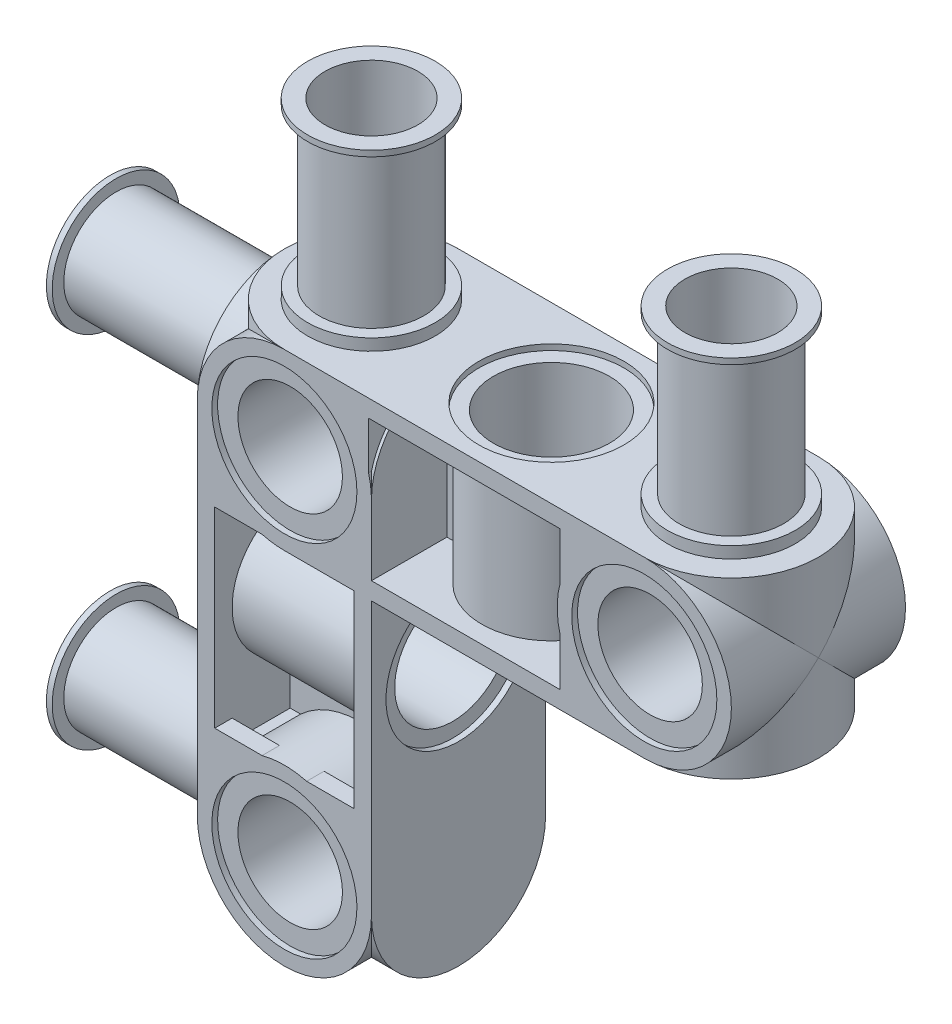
ISO-10303-21;
HEADER;
FILE_DESCRIPTION(('STEP AP214'),'2;1');
FILE_NAME('part.step','',(''),(''),'','','');
FILE_SCHEMA(('AUTOMOTIVE_DESIGN { 1 0 10303 214 1 1 1 1 }'));
ENDSEC;
DATA;
#1=APPLICATION_CONTEXT('core data for automotive mechanical design processes');
#2=APPLICATION_PROTOCOL_DEFINITION('international standard','automotive_design',2000,#1);
#3=PRODUCT_CONTEXT('',#1,'mechanical');
#4=PRODUCT('Part','Part','',(#3));
#5=PRODUCT_RELATED_PRODUCT_CATEGORY('part','',(#4));
#6=PRODUCT_DEFINITION_FORMATION('','',#4);
#7=PRODUCT_DEFINITION_CONTEXT('part definition',#1,'design');
#8=PRODUCT_DEFINITION('design','',#6,#7);
#9=PRODUCT_DEFINITION_SHAPE('','',#8);
#10=(LENGTH_UNIT() NAMED_UNIT(*) SI_UNIT(.MILLI.,.METRE.));
#11=(NAMED_UNIT(*) PLANE_ANGLE_UNIT() SI_UNIT($,.RADIAN.));
#12=(NAMED_UNIT(*) SI_UNIT($,.STERADIAN.) SOLID_ANGLE_UNIT());
#13=UNCERTAINTY_MEASURE_WITH_UNIT(LENGTH_MEASURE(1.E-05),#10,'distance_accuracy_value','');
#14=(GEOMETRIC_REPRESENTATION_CONTEXT(3) GLOBAL_UNCERTAINTY_ASSIGNED_CONTEXT((#13)) GLOBAL_UNIT_ASSIGNED_CONTEXT((#10,
#11,#12)) REPRESENTATION_CONTEXT('',''));
#15=CARTESIAN_POINT('',(0.,0.,0.));
#16=DIRECTION('',(0.,0.,1.));
#17=DIRECTION('',(1.,0.,0.));
#18=AXIS2_PLACEMENT_3D('',#15,#16,#17);
#19=CARTESIAN_POINT('',(-5.08,0.762,-0.508));
#20=DIRECTION('',(0.,0.,1.));
#21=DIRECTION('',(1.,0.,0.));
#22=AXIS2_PLACEMENT_3D('',#19,#20,#21);
#23=PLANE('',#22);
#24=DIRECTION('',(0.,-1.,0.));
#25=VECTOR('',#24,1.);
#26=CARTESIAN_POINT('',(-4.06399999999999,0.762000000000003,-0.508));
#27=LINE('',#26,#25);
#28=CARTESIAN_POINT('',(-4.06400000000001,6.858,-0.508));
#29=VERTEX_POINT('',#28);
#30=CARTESIAN_POINT('',(-4.06399999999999,0.762,-0.508));
#31=VERTEX_POINT('',#30);
#32=EDGE_CURVE('E847',#29,#31,#27,.T.);
#33=ORIENTED_EDGE('',*,*,#32,.F.);
#34=DIRECTION('',(1.,0.,0.));
#35=VECTOR('',#34,1.);
#36=CARTESIAN_POINT('',(-5.08,6.858,-0.508));
#37=LINE('',#36,#35);
#38=CARTESIAN_POINT('',(-3.00536852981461,6.858,-0.508));
#39=VERTEX_POINT('',#38);
#40=EDGE_CURVE('E991',#29,#39,#37,.T.);
#41=ORIENTED_EDGE('',*,*,#40,.T.);
#42=DIRECTION('',(0.,1.,0.));
#43=VECTOR('',#42,1.);
#44=CARTESIAN_POINT('',(-3.00536852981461,0.762,-0.508));
#45=LINE('',#44,#43);
#46=CARTESIAN_POINT('',(-3.00536852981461,0.762,-0.508));
#47=VERTEX_POINT('',#46);
#48=EDGE_CURVE('E1233',#47,#39,#45,.T.);
#49=ORIENTED_EDGE('',*,*,#48,.F.);
#50=DIRECTION('',(1.,0.,0.));
#51=VECTOR('',#50,1.);
#52=CARTESIAN_POINT('',(-5.08,0.762,-0.508));
#53=LINE('',#52,#51);
#54=EDGE_CURVE('E1203',#31,#47,#53,.T.);
#55=ORIENTED_EDGE('',*,*,#54,.F.);
#56=EDGE_LOOP('',(#33,#41,#49,#55));
#57=FACE_BOUND('',#56,.T.);
#58=ADVANCED_FACE('F33',(#57),#23,.F.);
#59=CARTESIAN_POINT('',(-5.08,0.762,0.508));
#60=DIRECTION('',(0.,0.,-1.));
#61=DIRECTION('',(-1.,0.,0.));
#62=AXIS2_PLACEMENT_3D('',#59,#60,#61);
#63=PLANE('',#62);
#64=DIRECTION('',(0.,1.,0.));
#65=VECTOR('',#64,1.);
#66=CARTESIAN_POINT('',(-4.06399999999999,0.762000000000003,0.508));
#67=LINE('',#66,#65);
#68=CARTESIAN_POINT('',(-4.06399999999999,0.762,0.508));
#69=VERTEX_POINT('',#68);
#70=CARTESIAN_POINT('',(-4.06400000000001,6.858,0.508));
#71=VERTEX_POINT('',#70);
#72=EDGE_CURVE('E853',#69,#71,#67,.T.);
#73=ORIENTED_EDGE('',*,*,#72,.F.);
#74=DIRECTION('',(-1.,0.,0.));
#75=VECTOR('',#74,1.);
#76=CARTESIAN_POINT('',(-5.08,0.762,0.508));
#77=LINE('',#76,#75);
#78=CARTESIAN_POINT('',(-3.00536852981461,0.762,0.507999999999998));
#79=VERTEX_POINT('',#78);
#80=EDGE_CURVE('E1165',#79,#69,#77,.T.);
#81=ORIENTED_EDGE('',*,*,#80,.F.);
#82=DIRECTION('',(0.,1.,0.));
#83=VECTOR('',#82,1.);
#84=CARTESIAN_POINT('',(-3.00536852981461,0.762,0.507999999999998));
#85=LINE('',#84,#83);
#86=CARTESIAN_POINT('',(-3.00536852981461,6.858,0.507999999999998));
#87=VERTEX_POINT('',#86);
#88=EDGE_CURVE('E1179',#79,#87,#85,.T.);
#89=ORIENTED_EDGE('',*,*,#88,.T.);
#90=DIRECTION('',(-1.,0.,0.));
#91=VECTOR('',#90,1.);
#92=CARTESIAN_POINT('',(-5.08,6.858,0.508));
#93=LINE('',#92,#91);
#94=EDGE_CURVE('E954',#87,#71,#93,.T.);
#95=ORIENTED_EDGE('',*,*,#94,.T.);
#96=EDGE_LOOP('',(#73,#81,#89,#95));
#97=FACE_BOUND('',#96,.T.);
#98=ADVANCED_FACE('F1551',(#97),#63,.F.);
#99=CARTESIAN_POINT('',(-7.874,0.,0.));
#100=DIRECTION('',(0.,1.,0.));
#101=DIRECTION('',(0.,0.,1.));
#102=AXIS2_PLACEMENT_3D('',#99,#100,#101);
#103=PLANE('',#102);
#104=CARTESIAN_POINT('',(0.,0.,0.));
#105=DIRECTION('',(0.,-1.,0.));
#106=DIRECTION('',(0.,0.,-1.));
#107=AXIS2_PLACEMENT_3D('',#104,#105,#106);
#108=CIRCLE('',#107,3.175);
#109=CARTESIAN_POINT('',(0.,0.,-3.175));
#110=VERTEX_POINT('',#109);
#111=EDGE_CURVE('E1138',#110,#110,#108,.T.);
#112=ORIENTED_EDGE('',*,*,#111,.F.);
#113=EDGE_LOOP('',(#112));
#114=FACE_BOUND('',#113,.T.);
#115=DIRECTION('',(0.,0.,1.));
#116=VECTOR('',#115,1.);
#117=CARTESIAN_POINT('',(-4.06399999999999,0.,0.));
#118=LINE('',#117,#116);
#119=CARTESIAN_POINT('',(-4.06399999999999,0.,-3.81));
#120=VERTEX_POINT('',#119);
#121=CARTESIAN_POINT('',(-4.064,0.,3.81));
#122=VERTEX_POINT('',#121);
#123=EDGE_CURVE('E850',#120,#122,#118,.T.);
#124=ORIENTED_EDGE('',*,*,#123,.F.);
#125=DIRECTION('',(-1.,0.,0.));
#126=VECTOR('',#125,1.);
#127=CARTESIAN_POINT('',(-7.874,0.,-3.81));
#128=LINE('',#127,#126);
#129=CARTESIAN_POINT('',(7.874,0.,-3.81));
#130=VERTEX_POINT('',#129);
#131=EDGE_CURVE('E1310',#130,#120,#128,.T.);
#132=ORIENTED_EDGE('',*,*,#131,.F.);
#133=CARTESIAN_POINT('',(7.874,0.,0.));
#134=DIRECTION('',(0.,1.,0.));
#135=DIRECTION('',(0.,0.,1.));
#136=AXIS2_PLACEMENT_3D('',#133,#134,#135);
#137=CIRCLE('',#136,3.81);
#138=CARTESIAN_POINT('',(7.874,0.,3.81));
#139=VERTEX_POINT('',#138);
#140=EDGE_CURVE('E1306',#139,#130,#137,.T.);
#141=ORIENTED_EDGE('',*,*,#140,.F.);
#142=DIRECTION('',(1.,0.,0.));
#143=VECTOR('',#142,1.);
#144=CARTESIAN_POINT('',(7.874,0.,3.81));
#145=LINE('',#144,#143);
#146=EDGE_CURVE('E1302',#122,#139,#145,.T.);
#147=ORIENTED_EDGE('',*,*,#146,.F.);
#148=EDGE_LOOP('',(#124,#132,#141,#147));
#149=FACE_BOUND('',#148,.T.);
#150=ADVANCED_FACE('F1558',(#114,#149),#103,.F.);
#151=DIRECTION('',(0.,0.,1.));
#152=VECTOR('',#151,1.);
#153=CARTESIAN_POINT('',(-4.82599999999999,0.,0.));
#154=LINE('',#153,#152);
#155=CARTESIAN_POINT('',(-4.82599999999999,0.,-3.81));
#156=VERTEX_POINT('',#155);
#157=CARTESIAN_POINT('',(-4.82599999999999,0.,-0.508));
#158=VERTEX_POINT('',#157);
#159=EDGE_CURVE('E865',#156,#158,#154,.T.);
#160=ORIENTED_EDGE('',*,*,#159,.T.);
#161=DIRECTION('',(1.,0.,0.));
#162=VECTOR('',#161,1.);
#163=CARTESIAN_POINT('',(-7.874,0.,-0.508));
#164=LINE('',#163,#162);
#165=CARTESIAN_POINT('',(-10.922,0.,-0.508));
#166=VERTEX_POINT('',#165);
#167=EDGE_CURVE('E868',#166,#158,#164,.T.);
#168=ORIENTED_EDGE('',*,*,#167,.F.);
#169=DIRECTION('',(0.,0.,-1.));
#170=VECTOR('',#169,1.);
#171=CARTESIAN_POINT('',(-10.922,0.,0.));
#172=LINE('',#171,#170);
#173=CARTESIAN_POINT('',(-10.922,0.,-2.286));
#174=VERTEX_POINT('',#173);
#175=EDGE_CURVE('E888',#166,#174,#172,.T.);
#176=ORIENTED_EDGE('',*,*,#175,.T.);
#177=CARTESIAN_POINT('',(-7.874,0.,0.));
#178=DIRECTION('',(0.,1.,0.));
#179=DIRECTION('',(0.,0.,1.));
#180=AXIS2_PLACEMENT_3D('',#177,#178,#179);
#181=CIRCLE('',#180,3.81);
#182=CARTESIAN_POINT('',(-7.874,0.,-3.81));
#183=VERTEX_POINT('',#182);
#184=EDGE_CURVE('E1299',#183,#174,#181,.T.);
#185=ORIENTED_EDGE('',*,*,#184,.F.);
#186=EDGE_CURVE('E1309',#156,#183,#128,.T.);
#187=ORIENTED_EDGE('',*,*,#186,.F.);
#188=EDGE_LOOP('',(#160,#168,#176,#185,#187));
#189=FACE_BOUND('',#188,.T.);
#190=ADVANCED_FACE('F1988',(#189),#103,.F.);
#191=CARTESIAN_POINT('',(-7.874,3.81,0.));
#192=DIRECTION('',(0.,-1.,0.));
#193=DIRECTION('',(0.,0.,-1.));
#194=AXIS2_PLACEMENT_3D('',#191,#192,#193);
#195=CYLINDRICAL_SURFACE('',#194,3.81);
#196=CARTESIAN_POINT('',(-7.874,1.016,0.));
#197=DIRECTION('',(0.,1.,0.));
#198=DIRECTION('',(-1.,0.,0.));
#199=AXIS2_PLACEMENT_3D('',#196,#197,#198);
#200=CIRCLE('',#199,3.81);
#201=CARTESIAN_POINT('',(-10.922,1.01599999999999,2.28600000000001));
#202=VERTEX_POINT('',#201);
#203=CARTESIAN_POINT('',(-10.4643019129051,1.01599999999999,2.79400000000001));
#204=VERTEX_POINT('',#203);
#205=EDGE_CURVE('E873',#202,#204,#200,.T.);
#206=ORIENTED_EDGE('',*,*,#205,.F.);
#207=DIRECTION('',(0.,-1.,0.));
#208=VECTOR('',#207,1.);
#209=CARTESIAN_POINT('',(-10.922,3.80999999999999,2.286));
#210=LINE('',#209,#208);
#211=CARTESIAN_POINT('',(-10.922,0.,2.286));
#212=VERTEX_POINT('',#211);
#213=EDGE_CURVE('E11',#202,#212,#210,.T.);
#214=ORIENTED_EDGE('',*,*,#213,.T.);
#215=CARTESIAN_POINT('',(-7.874,0.,3.81));
#216=VERTEX_POINT('',#215);
#217=EDGE_CURVE('E1298',#212,#216,#181,.T.);
#218=ORIENTED_EDGE('',*,*,#217,.T.);
#219=CARTESIAN_POINT('',(-7.874,3.81,0.));
#220=DIRECTION('',(0.,-0.707106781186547,-0.707106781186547));
#221=DIRECTION('',(0.,-0.707106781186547,0.707106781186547));
#222=AXIS2_PLACEMENT_3D('',#219,#220,#221);
#223=ELLIPSE('',#222,5.38815367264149,3.81);
#224=CARTESIAN_POINT('',(-8.8495055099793,0.126999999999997,3.683));
#225=VERTEX_POINT('',#224);
#226=EDGE_CURVE('E1288',#216,#225,#223,.T.);
#227=ORIENTED_EDGE('',*,*,#226,.T.);
#228=CARTESIAN_POINT('',(-7.874,0.127,0.));
#229=DIRECTION('',(0.,1.,0.));
#230=DIRECTION('',(-1.,0.,0.));
#231=AXIS2_PLACEMENT_3D('',#228,#229,#230);
#232=CIRCLE('',#231,3.81);
#233=CARTESIAN_POINT('',(-10.16,0.126999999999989,3.04799999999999));
#234=VERTEX_POINT('',#233);
#235=EDGE_CURVE('E876',#234,#225,#232,.T.);
#236=ORIENTED_EDGE('',*,*,#235,.F.);
#237=DIRECTION('',(0.,-1.,0.));
#238=VECTOR('',#237,1.);
#239=CARTESIAN_POINT('',(-10.16,3.81000000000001,3.04799999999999));
#240=LINE('',#239,#238);
#241=CARTESIAN_POINT('',(-10.16,0.762,3.048));
#242=VERTEX_POINT('',#241);
#243=EDGE_CURVE('E870',#242,#234,#240,.T.);
#244=ORIENTED_EDGE('',*,*,#243,.F.);
#245=EDGE_CURVE('E1292',#242,#204,#223,.T.);
#246=ORIENTED_EDGE('',*,*,#245,.T.);
#247=EDGE_LOOP('',(#206,#214,#218,#227,#236,#244,#246));
#248=FACE_BOUND('',#247,.T.);
#249=ADVANCED_FACE('F35',(#248),#195,.T.);
#250=CARTESIAN_POINT('',(-7.874,0.126999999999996,0.));
#251=DIRECTION('',(0.,1.,0.));
#252=DIRECTION('',(-1.,0.,0.));
#253=AXIS2_PLACEMENT_3D('',#250,#251,#252);
#254=CIRCLE('',#253,3.81);
#255=CARTESIAN_POINT('',(-8.84950550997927,0.12699999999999,-3.68300000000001));
#256=VERTEX_POINT('',#255);
#257=CARTESIAN_POINT('',(-10.16,0.126999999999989,-3.048));
#258=VERTEX_POINT('',#257);
#259=EDGE_CURVE('E885',#256,#258,#254,.T.);
#260=ORIENTED_EDGE('',*,*,#259,.F.);
#261=CARTESIAN_POINT('',(-7.874,3.81,0.));
#262=DIRECTION('',(0.,-0.707106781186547,0.707106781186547));
#263=DIRECTION('',(0.,-0.707106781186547,-0.707106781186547));
#264=AXIS2_PLACEMENT_3D('',#261,#262,#263);
#265=ELLIPSE('',#264,5.38815367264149,3.81);
#266=EDGE_CURVE('E1280',#256,#183,#265,.T.);
#267=ORIENTED_EDGE('',*,*,#266,.T.);
#268=ORIENTED_EDGE('',*,*,#184,.T.);
#269=DIRECTION('',(0.,-1.,0.));
#270=VECTOR('',#269,1.);
#271=CARTESIAN_POINT('',(-10.922,3.80999999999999,-2.286));
#272=LINE('',#271,#270);
#273=CARTESIAN_POINT('',(-10.922,1.01599999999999,-2.28600000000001));
#274=VERTEX_POINT('',#273);
#275=EDGE_CURVE('E42',#174,#274,#272,.F.);
#276=ORIENTED_EDGE('',*,*,#275,.T.);
#277=CARTESIAN_POINT('',(-7.874,1.016,0.));
#278=DIRECTION('',(0.,1.,0.));
#279=DIRECTION('',(-1.,0.,0.));
#280=AXIS2_PLACEMENT_3D('',#277,#278,#279);
#281=CIRCLE('',#280,3.81);
#282=CARTESIAN_POINT('',(-10.4643019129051,1.01599999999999,-2.79400000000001));
#283=VERTEX_POINT('',#282);
#284=EDGE_CURVE('E879',#283,#274,#281,.T.);
#285=ORIENTED_EDGE('',*,*,#284,.F.);
#286=CARTESIAN_POINT('',(-10.16,0.762,-3.048));
#287=VERTEX_POINT('',#286);
#288=EDGE_CURVE('E1287',#283,#287,#265,.T.);
#289=ORIENTED_EDGE('',*,*,#288,.T.);
#290=DIRECTION('',(0.,-1.,0.));
#291=VECTOR('',#290,1.);
#292=CARTESIAN_POINT('',(-10.16,3.81,-3.048));
#293=LINE('',#292,#291);
#294=EDGE_CURVE('E882',#258,#287,#293,.F.);
#295=ORIENTED_EDGE('',*,*,#294,.F.);
#296=EDGE_LOOP('',(#260,#267,#268,#276,#285,#289,#295));
#297=FACE_BOUND('',#296,.T.);
#298=ADVANCED_FACE('F1348',(#297),#195,.T.);
#299=CARTESIAN_POINT('',(-7.874,3.81,3.81));
#300=DIRECTION('',(0.,0.,-1.));
#301=DIRECTION('',(-1.,0.,0.));
#302=AXIS2_PLACEMENT_3D('',#299,#300,#301);
#303=CYLINDRICAL_SURFACE('',#302,3.81);
#304=ORIENTED_EDGE('',*,*,#266,.F.);
#305=DIRECTION('',(0.,0.,-1.));
#306=VECTOR('',#305,1.);
#307=CARTESIAN_POINT('',(-8.84950550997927,0.12699999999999,3.81));
#308=LINE('',#307,#306);
#309=CARTESIAN_POINT('',(-8.84950550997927,0.12699999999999,-3.81));
#310=VERTEX_POINT('',#309);
#311=EDGE_CURVE('E1345',#256,#310,#308,.T.);
#312=ORIENTED_EDGE('',*,*,#311,.T.);
#313=CARTESIAN_POINT('',(-7.874,3.81,-3.81));
#314=DIRECTION('',(0.,0.,-1.));
#315=DIRECTION('',(-1.,0.,0.));
#316=AXIS2_PLACEMENT_3D('',#313,#314,#315);
#317=CIRCLE('',#316,3.81);
#318=EDGE_CURVE('E1277',#183,#310,#317,.T.);
#319=ORIENTED_EDGE('',*,*,#318,.F.);
#320=EDGE_LOOP('',(#304,#312,#319));
#321=FACE_BOUND('',#320,.T.);
#322=ADVANCED_FACE('F1974',(#321),#303,.T.);
#323=CARTESIAN_POINT('',(-11.684,3.80999999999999,-3.81));
#324=VERTEX_POINT('',#323);
#325=CARTESIAN_POINT('',(-7.874,7.62,-3.81));
#326=VERTEX_POINT('',#325);
#327=EDGE_CURVE('E1282',#324,#326,#317,.T.);
#328=ORIENTED_EDGE('',*,*,#327,.F.);
#329=CARTESIAN_POINT('',(-7.874,3.81,0.));
#330=DIRECTION('',(-0.707106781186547,0.,0.707106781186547));
#331=DIRECTION('',(-0.707106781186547,0.,-0.707106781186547));
#332=AXIS2_PLACEMENT_3D('',#329,#330,#331);
#333=ELLIPSE('',#332,5.38815367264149,3.81);
#334=CARTESIAN_POINT('',(-10.5680768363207,6.50407683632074,-2.69407683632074));
#335=VERTEX_POINT('',#334);
#336=EDGE_CURVE('E1387',#335,#324,#333,.T.);
#337=ORIENTED_EDGE('',*,*,#336,.F.);
#338=CARTESIAN_POINT('',(-7.874,3.81,0.));
#339=DIRECTION('',(0.,-0.707106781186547,-0.707106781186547));
#340=DIRECTION('',(0.,0.707106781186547,-0.707106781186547));
#341=AXIS2_PLACEMENT_3D('',#338,#339,#340);
#342=ELLIPSE('',#341,5.38815367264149,3.81);
#343=EDGE_CURVE('E1006',#335,#326,#342,.T.);
#344=ORIENTED_EDGE('',*,*,#343,.T.);
#345=EDGE_LOOP('',(#328,#337,#344));
#346=FACE_BOUND('',#345,.T.);
#347=ADVANCED_FACE('F1977',(#346),#303,.T.);
#348=DIRECTION('',(0.,0.,1.));
#349=VECTOR('',#348,1.);
#350=CARTESIAN_POINT('',(-10.4643019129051,1.01599999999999,-3.302));
#351=LINE('',#350,#349);
#352=CARTESIAN_POINT('',(-10.4643019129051,1.01599999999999,-3.048));
#353=VERTEX_POINT('',#352);
#354=EDGE_CURVE('E1362',#353,#283,#351,.T.);
#355=ORIENTED_EDGE('',*,*,#354,.F.);
#356=CARTESIAN_POINT('',(-7.874,3.81,-3.048));
#357=DIRECTION('',(0.,0.,-1.));
#358=DIRECTION('',(-1.,0.,0.));
#359=AXIS2_PLACEMENT_3D('',#356,#357,#358);
#360=CIRCLE('',#359,3.81);
#361=EDGE_CURVE('E1343',#353,#287,#360,.F.);
#362=ORIENTED_EDGE('',*,*,#361,.T.);
#363=ORIENTED_EDGE('',*,*,#288,.F.);
#364=EDGE_LOOP('',(#355,#362,#363));
#365=FACE_BOUND('',#364,.T.);
#366=ADVANCED_FACE('F2171',(#365),#303,.T.);
#367=CARTESIAN_POINT('',(-7.874,3.81,3.81));
#368=DIRECTION('',(0.,0.,-1.));
#369=DIRECTION('',(-1.,0.,0.));
#370=AXIS2_PLACEMENT_3D('',#367,#368,#369);
#371=CIRCLE('',#370,3.81);
#372=CARTESIAN_POINT('',(-8.8495055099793,0.126999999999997,3.81));
#373=VERTEX_POINT('',#372);
#374=EDGE_CURVE('E1278',#216,#373,#371,.T.);
#375=ORIENTED_EDGE('',*,*,#374,.T.);
#376=DIRECTION('',(0.,0.,-1.));
#377=VECTOR('',#376,1.);
#378=CARTESIAN_POINT('',(-8.8495055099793,0.126999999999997,3.81));
#379=LINE('',#378,#377);
#380=EDGE_CURVE('E1341',#373,#225,#379,.T.);
#381=ORIENTED_EDGE('',*,*,#380,.T.);
#382=ORIENTED_EDGE('',*,*,#226,.F.);
#383=EDGE_LOOP('',(#375,#381,#382));
#384=FACE_BOUND('',#383,.T.);
#385=ADVANCED_FACE('F2192',(#384),#303,.T.);
#386=CARTESIAN_POINT('',(-7.874,3.81,0.));
#387=DIRECTION('',(0.,-0.707106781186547,0.707106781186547));
#388=DIRECTION('',(0.,0.707106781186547,0.707106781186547));
#389=AXIS2_PLACEMENT_3D('',#386,#387,#388);
#390=ELLIPSE('',#389,5.38815367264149,3.81);
#391=CARTESIAN_POINT('',(-7.874,7.62,3.81));
#392=VERTEX_POINT('',#391);
#393=CARTESIAN_POINT('',(-10.5680768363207,6.50407683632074,2.69407683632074));
#394=VERTEX_POINT('',#393);
#395=EDGE_CURVE('E1020',#392,#394,#390,.T.);
#396=ORIENTED_EDGE('',*,*,#395,.T.);
#397=CARTESIAN_POINT('',(-7.874,3.81,0.));
#398=DIRECTION('',(-0.707106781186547,0.,-0.707106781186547));
#399=DIRECTION('',(-0.707106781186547,0.,0.707106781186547));
#400=AXIS2_PLACEMENT_3D('',#397,#398,#399);
#401=ELLIPSE('',#400,5.38815367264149,3.81);
#402=CARTESIAN_POINT('',(-11.684,3.80999999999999,3.81));
#403=VERTEX_POINT('',#402);
#404=EDGE_CURVE('E1399',#403,#394,#401,.T.);
#405=ORIENTED_EDGE('',*,*,#404,.F.);
#406=EDGE_CURVE('E1276',#403,#392,#371,.T.);
#407=ORIENTED_EDGE('',*,*,#406,.T.);
#408=EDGE_LOOP('',(#396,#405,#407));
#409=FACE_BOUND('',#408,.T.);
#410=ADVANCED_FACE('F2049',(#409),#303,.T.);
#411=CARTESIAN_POINT('',(-7.874,3.81,3.04799999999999));
#412=DIRECTION('',(0.,0.,1.));
#413=DIRECTION('',(0.,-1.,0.));
#414=AXIS2_PLACEMENT_3D('',#411,#412,#413);
#415=CIRCLE('',#414,3.81);
#416=CARTESIAN_POINT('',(-10.4643019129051,1.01599999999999,3.048));
#417=VERTEX_POINT('',#416);
#418=EDGE_CURVE('E636',#417,#242,#415,.T.);
#419=ORIENTED_EDGE('',*,*,#418,.F.);
#420=DIRECTION('',(0.,0.,-1.));
#421=VECTOR('',#420,1.);
#422=CARTESIAN_POINT('',(-10.4643019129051,1.01599999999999,3.81));
#423=LINE('',#422,#421);
#424=EDGE_CURVE('E1339',#417,#204,#423,.T.);
#425=ORIENTED_EDGE('',*,*,#424,.T.);
#426=ORIENTED_EDGE('',*,*,#245,.F.);
#427=EDGE_LOOP('',(#419,#425,#426));
#428=FACE_BOUND('',#427,.T.);
#429=ADVANCED_FACE('F1979',(#428),#303,.T.);
#430=CARTESIAN_POINT('',(-4.191,0.762,-3.81));
#431=DIRECTION('',(-1.,0.,0.));
#432=DIRECTION('',(0.,0.,1.));
#433=AXIS2_PLACEMENT_3D('',#430,#431,#432);
#434=PLANE('',#433);
#435=CARTESIAN_POINT('',(-4.191,3.81000000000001,0.));
#436=DIRECTION('',(-1.,0.,0.));
#437=DIRECTION('',(0.,0.,1.));
#438=AXIS2_PLACEMENT_3D('',#435,#436,#437);
#439=CIRCLE('',#438,3.81);
#440=CARTESIAN_POINT('',(-4.19099999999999,4.78550550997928,-3.68300000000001));
#441=VERTEX_POINT('',#440);
#442=CARTESIAN_POINT('',(-4.191,6.09600000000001,-3.048));
#443=VERTEX_POINT('',#442);
#444=EDGE_CURVE('E826',#441,#443,#439,.F.);
#445=ORIENTED_EDGE('',*,*,#444,.F.);
#446=DIRECTION('',(0.,0.,-1.));
#447=VECTOR('',#446,1.);
#448=CARTESIAN_POINT('',(-4.19099999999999,4.78550550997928,3.81));
#449=LINE('',#448,#447);
#450=CARTESIAN_POINT('',(-4.191,4.78550550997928,-3.81));
#451=VERTEX_POINT('',#450);
#452=EDGE_CURVE('E818',#441,#451,#449,.T.);
#453=ORIENTED_EDGE('',*,*,#452,.T.);
#454=DIRECTION('',(0.,1.,0.));
#455=VECTOR('',#454,1.);
#456=CARTESIAN_POINT('',(-4.191,0.762,-3.81));
#457=LINE('',#456,#455);
#458=CARTESIAN_POINT('',(-4.191,6.858,-3.81));
#459=VERTEX_POINT('',#458);
#460=EDGE_CURVE('E1240',#451,#459,#457,.T.);
#461=ORIENTED_EDGE('',*,*,#460,.T.);
#462=DIRECTION('',(0.,0.,1.));
#463=VECTOR('',#462,1.);
#464=CARTESIAN_POINT('',(-4.191,6.858,-3.81));
#465=LINE('',#464,#463);
#466=CARTESIAN_POINT('',(-4.191,6.858,-3.048));
#467=VERTEX_POINT('',#466);
#468=EDGE_CURVE('E985',#459,#467,#465,.T.);
#469=ORIENTED_EDGE('',*,*,#468,.T.);
#470=DIRECTION('',(0.,-1.,0.));
#471=VECTOR('',#470,1.);
#472=CARTESIAN_POINT('',(-4.191,6.858,-3.048));
#473=LINE('',#472,#471);
#474=EDGE_CURVE('E1002',#467,#443,#473,.T.);
#475=ORIENTED_EDGE('',*,*,#474,.T.);
#476=EDGE_LOOP('',(#445,#453,#461,#469,#475));
#477=FACE_BOUND('',#476,.T.);
#478=ADVANCED_FACE('F1909',(#477),#434,.F.);
#479=CARTESIAN_POINT('',(0.,0.762,0.));
#480=DIRECTION('',(0.,1.,0.));
#481=DIRECTION('',(0.,0.,1.));
#482=AXIS2_PLACEMENT_3D('',#479,#480,#481);
#483=PLANE('',#482);
#484=DIRECTION('',(-1.,0.,0.));
#485=VECTOR('',#484,1.);
#486=CARTESIAN_POINT('',(4.191,0.762,-3.81));
#487=LINE('',#486,#485);
#488=CARTESIAN_POINT('',(4.191,0.762,-3.81));
#489=VERTEX_POINT('',#488);
#490=CARTESIAN_POINT('',(-4.06399999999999,0.762,-3.81));
#491=VERTEX_POINT('',#490);
#492=EDGE_CURVE('E1196',#489,#491,#487,.T.);
#493=ORIENTED_EDGE('',*,*,#492,.T.);
#494=DIRECTION('',(0.,0.,1.));
#495=VECTOR('',#494,1.);
#496=CARTESIAN_POINT('',(-4.06399999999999,0.762,0.));
#497=LINE('',#496,#495);
#498=EDGE_CURVE('E851',#491,#31,#497,.T.);
#499=ORIENTED_EDGE('',*,*,#498,.T.);
#500=ORIENTED_EDGE('',*,*,#54,.T.);
#501=CARTESIAN_POINT('',(0.,0.762,0.));
#502=DIRECTION('',(0.,-1.,0.));
#503=DIRECTION('',(0.,0.,1.));
#504=AXIS2_PLACEMENT_3D('',#501,#502,#503);
#505=CIRCLE('',#504,3.048);
#506=CARTESIAN_POINT('',(3.00536852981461,0.762,-0.508));
#507=VERTEX_POINT('',#506);
#508=EDGE_CURVE('E1206',#47,#507,#505,.T.);
#509=ORIENTED_EDGE('',*,*,#508,.T.);
#510=DIRECTION('',(1.,0.,0.));
#511=VECTOR('',#510,1.);
#512=CARTESIAN_POINT('',(3.00536852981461,0.762,-0.508));
#513=LINE('',#512,#511);
#514=CARTESIAN_POINT('',(5.08,0.762,-0.508));
#515=VERTEX_POINT('',#514);
#516=EDGE_CURVE('E1209',#507,#515,#513,.T.);
#517=ORIENTED_EDGE('',*,*,#516,.T.);
#518=DIRECTION('',(0.,0.,-1.));
#519=VECTOR('',#518,1.);
#520=CARTESIAN_POINT('',(5.08,0.762,-0.508));
#521=LINE('',#520,#519);
#522=CARTESIAN_POINT('',(5.08,0.762,-3.048));
#523=VERTEX_POINT('',#522);
#524=EDGE_CURVE('E1212',#515,#523,#521,.T.);
#525=ORIENTED_EDGE('',*,*,#524,.T.);
#526=DIRECTION('',(-1.,0.,0.));
#527=VECTOR('',#526,1.);
#528=CARTESIAN_POINT('',(5.08,0.762,-3.048));
#529=LINE('',#528,#527);
#530=CARTESIAN_POINT('',(4.191,0.762,-3.048));
#531=VERTEX_POINT('',#530);
#532=EDGE_CURVE('E1215',#523,#531,#529,.T.);
#533=ORIENTED_EDGE('',*,*,#532,.T.);
#534=DIRECTION('',(0.,0.,-1.));
#535=VECTOR('',#534,1.);
#536=CARTESIAN_POINT('',(4.191,0.762,-3.048));
#537=LINE('',#536,#535);
#538=EDGE_CURVE('E1175',#531,#489,#537,.T.);
#539=ORIENTED_EDGE('',*,*,#538,.T.);
#540=EDGE_LOOP('',(#493,#499,#500,#509,#517,#525,#533,#539));
#541=FACE_BOUND('',#540,.T.);
#542=ADVANCED_FACE('F1857',(#541),#483,.T.);
#543=CARTESIAN_POINT('',(0.,0.762,0.));
#544=DIRECTION('',(0.,1.,0.));
#545=DIRECTION('',(0.,0.,1.));
#546=AXIS2_PLACEMENT_3D('',#543,#544,#545);
#547=PLANE('',#546);
#548=ORIENTED_EDGE('',*,*,#80,.T.);
#549=DIRECTION('',(0.,0.,1.));
#550=VECTOR('',#549,1.);
#551=CARTESIAN_POINT('',(-4.06399999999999,0.762,0.));
#552=LINE('',#551,#550);
#553=CARTESIAN_POINT('',(-4.06399999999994,0.762,3.81));
#554=VERTEX_POINT('',#553);
#555=EDGE_CURVE('E856',#69,#554,#552,.T.);
#556=ORIENTED_EDGE('',*,*,#555,.T.);
#557=DIRECTION('',(1.,0.,0.));
#558=VECTOR('',#557,1.);
#559=CARTESIAN_POINT('',(-4.191,0.762,3.81));
#560=LINE('',#559,#558);
#561=CARTESIAN_POINT('',(4.191,0.762,3.81));
#562=VERTEX_POINT('',#561);
#563=EDGE_CURVE('E1147',#554,#562,#560,.T.);
#564=ORIENTED_EDGE('',*,*,#563,.T.);
#565=DIRECTION('',(0.,0.,-1.));
#566=VECTOR('',#565,1.);
#567=CARTESIAN_POINT('',(4.191,0.762,3.81));
#568=LINE('',#567,#566);
#569=CARTESIAN_POINT('',(4.191,0.762,3.048));
#570=VERTEX_POINT('',#569);
#571=EDGE_CURVE('E1149',#562,#570,#568,.T.);
#572=ORIENTED_EDGE('',*,*,#571,.T.);
#573=DIRECTION('',(1.,0.,0.));
#574=VECTOR('',#573,1.);
#575=CARTESIAN_POINT('',(4.191,0.762,3.048));
#576=LINE('',#575,#574);
#577=CARTESIAN_POINT('',(5.08,0.762,3.048));
#578=VERTEX_POINT('',#577);
#579=EDGE_CURVE('E1152',#570,#578,#576,.T.);
#580=ORIENTED_EDGE('',*,*,#579,.T.);
#581=DIRECTION('',(0.,0.,-1.));
#582=VECTOR('',#581,1.);
#583=CARTESIAN_POINT('',(5.08,0.762,3.048));
#584=LINE('',#583,#582);
#585=CARTESIAN_POINT('',(5.08,0.762,0.508));
#586=VERTEX_POINT('',#585);
#587=EDGE_CURVE('E1155',#578,#586,#584,.T.);
#588=ORIENTED_EDGE('',*,*,#587,.T.);
#589=DIRECTION('',(-1.,0.,0.));
#590=VECTOR('',#589,1.);
#591=CARTESIAN_POINT('',(3.00536852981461,0.762,0.508));
#592=LINE('',#591,#590);
#593=CARTESIAN_POINT('',(3.00536852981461,0.762,0.508));
#594=VERTEX_POINT('',#593);
#595=EDGE_CURVE('E1158',#586,#594,#592,.T.);
#596=ORIENTED_EDGE('',*,*,#595,.T.);
#597=CARTESIAN_POINT('',(0.,0.762,0.));
#598=DIRECTION('',(0.,-1.,0.));
#599=DIRECTION('',(0.,0.,1.));
#600=AXIS2_PLACEMENT_3D('',#597,#598,#599);
#601=CIRCLE('',#600,3.048);
#602=EDGE_CURVE('E1161',#594,#79,#601,.T.);
#603=ORIENTED_EDGE('',*,*,#602,.T.);
#604=EDGE_LOOP('',(#548,#556,#564,#572,#580,#588,#596,#603));
#605=FACE_BOUND('',#604,.T.);
#606=ADVANCED_FACE('F1804',(#605),#547,.T.);
#607=CARTESIAN_POINT('',(-7.874,3.81,-3.302));
#608=DIRECTION('',(0.,0.,1.));
#609=DIRECTION('',(1.,0.,0.));
#610=AXIS2_PLACEMENT_3D('',#607,#608,#609);
#611=CYLINDRICAL_SURFACE('',#610,3.81);
#612=CARTESIAN_POINT('',(-7.874,3.81,3.81));
#613=DIRECTION('',(0.,0.,1.));
#614=DIRECTION('',(1.,0.,0.));
#615=AXIS2_PLACEMENT_3D('',#612,#613,#614);
#616=CIRCLE('',#615,3.81);
#617=CARTESIAN_POINT('',(-4.064,3.81000000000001,3.81));
#618=VERTEX_POINT('',#617);
#619=CARTESIAN_POINT('',(-4.191,4.78550550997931,3.81));
#620=VERTEX_POINT('',#619);
#621=EDGE_CURVE('E1136',#618,#620,#616,.T.);
#622=ORIENTED_EDGE('',*,*,#621,.F.);
#623=CARTESIAN_POINT('',(-7.874,3.81,0.));
#624=DIRECTION('',(-0.707106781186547,0.,0.707106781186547));
#625=DIRECTION('',(0.707106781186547,0.,0.707106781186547));
#626=AXIS2_PLACEMENT_3D('',#623,#624,#625);
#627=ELLIPSE('',#626,5.38815367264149,3.81);
#628=CARTESIAN_POINT('',(-4.191,4.78550550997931,3.683));
#629=VERTEX_POINT('',#628);
#630=EDGE_CURVE('E780',#618,#629,#627,.T.);
#631=ORIENTED_EDGE('',*,*,#630,.T.);
#632=DIRECTION('',(0.,0.,1.));
#633=VECTOR('',#632,1.);
#634=CARTESIAN_POINT('',(-4.191,4.78550550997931,-3.302));
#635=LINE('',#634,#633);
#636=EDGE_CURVE('E1039',#629,#620,#635,.T.);
#637=ORIENTED_EDGE('',*,*,#636,.T.);
#638=EDGE_LOOP('',(#622,#631,#637));
#639=FACE_BOUND('',#638,.T.);
#640=ADVANCED_FACE('F1800',(#639),#611,.T.);
#641=CARTESIAN_POINT('',(-7.874,3.81,3.04799999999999));
#642=DIRECTION('',(0.,0.,-1.));
#643=DIRECTION('',(1.,0.,0.));
#644=AXIS2_PLACEMENT_3D('',#641,#642,#643);
#645=CIRCLE('',#644,3.81);
#646=CARTESIAN_POINT('',(-5.08,6.40030191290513,3.048));
#647=VERTEX_POINT('',#646);
#648=CARTESIAN_POINT('',(-4.82600000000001,6.09600000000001,3.048));
#649=VERTEX_POINT('',#648);
#650=EDGE_CURVE('E918',#647,#649,#645,.T.);
#651=ORIENTED_EDGE('',*,*,#650,.T.);
#652=CARTESIAN_POINT('',(-5.08,6.40030191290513,2.79400000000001));
#653=VERTEX_POINT('',#652);
#654=EDGE_CURVE('E783',#649,#653,#627,.T.);
#655=ORIENTED_EDGE('',*,*,#654,.T.);
#656=DIRECTION('',(0.,0.,1.));
#657=VECTOR('',#656,1.);
#658=CARTESIAN_POINT('',(-5.08,6.40030191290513,-3.302));
#659=LINE('',#658,#657);
#660=EDGE_CURVE('E921',#653,#647,#659,.T.);
#661=ORIENTED_EDGE('',*,*,#660,.T.);
#662=EDGE_LOOP('',(#651,#655,#661));
#663=FACE_BOUND('',#662,.T.);
#664=ADVANCED_FACE('F1803',(#663),#611,.T.);
#665=DIRECTION('',(0.,0.,1.));
#666=VECTOR('',#665,1.);
#667=CARTESIAN_POINT('',(-5.08,6.40030191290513,-3.302));
#668=LINE('',#667,#666);
#669=CARTESIAN_POINT('',(-5.08,6.40030191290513,-3.048));
#670=VERTEX_POINT('',#669);
#671=CARTESIAN_POINT('',(-5.08,6.40030191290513,-2.79400000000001));
#672=VERTEX_POINT('',#671);
#673=EDGE_CURVE('E925',#670,#672,#668,.T.);
#674=ORIENTED_EDGE('',*,*,#673,.T.);
#675=CARTESIAN_POINT('',(-7.874,3.81,0.));
#676=DIRECTION('',(-0.707106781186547,0.,-0.707106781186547));
#677=DIRECTION('',(0.707106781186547,0.,-0.707106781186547));
#678=AXIS2_PLACEMENT_3D('',#675,#676,#677);
#679=ELLIPSE('',#678,5.38815367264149,3.81);
#680=CARTESIAN_POINT('',(-4.82600000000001,6.09600000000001,-3.048));
#681=VERTEX_POINT('',#680);
#682=EDGE_CURVE('E779',#672,#681,#679,.T.);
#683=ORIENTED_EDGE('',*,*,#682,.T.);
#684=CARTESIAN_POINT('',(-7.874,3.81,-3.048));
#685=DIRECTION('',(0.,0.,1.));
#686=DIRECTION('',(-1.,0.,0.));
#687=AXIS2_PLACEMENT_3D('',#684,#685,#686);
#688=CIRCLE('',#687,3.81);
#689=EDGE_CURVE('E923',#681,#670,#688,.T.);
#690=ORIENTED_EDGE('',*,*,#689,.T.);
#691=EDGE_LOOP('',(#674,#683,#690));
#692=FACE_BOUND('',#691,.T.);
#693=ADVANCED_FACE('F1668',(#692),#611,.T.);
#694=CARTESIAN_POINT('',(0.,6.858,0.));
#695=DIRECTION('',(0.,-1.,0.));
#696=DIRECTION('',(0.,0.,1.));
#697=AXIS2_PLACEMENT_3D('',#694,#695,#696);
#698=PLANE('',#697);
#699=DIRECTION('',(1.,0.,0.));
#700=VECTOR('',#699,1.);
#701=CARTESIAN_POINT('',(-7.874,6.858,2.286));
#702=LINE('',#701,#700);
#703=CARTESIAN_POINT('',(-5.08,6.858,2.28600000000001));
#704=VERTEX_POINT('',#703);
#705=CARTESIAN_POINT('',(-4.064,6.85800000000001,2.286));
#706=VERTEX_POINT('',#705);
#707=EDGE_CURVE('E838',#704,#706,#702,.T.);
#708=ORIENTED_EDGE('',*,*,#707,.T.);
#709=DIRECTION('',(0.,0.,-1.));
#710=VECTOR('',#709,1.);
#711=CARTESIAN_POINT('',(-4.06400000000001,6.858,0.));
#712=LINE('',#711,#710);
#713=EDGE_CURVE('E846',#706,#71,#712,.T.);
#714=ORIENTED_EDGE('',*,*,#713,.T.);
#715=ORIENTED_EDGE('',*,*,#94,.F.);
#716=CARTESIAN_POINT('',(0.,6.858,0.));
#717=DIRECTION('',(0.,-1.,0.));
#718=DIRECTION('',(0.,0.,1.));
#719=AXIS2_PLACEMENT_3D('',#716,#717,#718);
#720=CIRCLE('',#719,3.048);
#721=CARTESIAN_POINT('',(3.00536852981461,6.858,0.508));
#722=VERTEX_POINT('',#721);
#723=EDGE_CURVE('E951',#722,#87,#720,.T.);
#724=ORIENTED_EDGE('',*,*,#723,.F.);
#725=DIRECTION('',(-1.,0.,0.));
#726=VECTOR('',#725,1.);
#727=CARTESIAN_POINT('',(3.00536852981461,6.858,0.508));
#728=LINE('',#727,#726);
#729=CARTESIAN_POINT('',(5.08,6.858,0.508));
#730=VERTEX_POINT('',#729);
#731=EDGE_CURVE('E948',#730,#722,#728,.T.);
#732=ORIENTED_EDGE('',*,*,#731,.F.);
#733=DIRECTION('',(0.,0.,-1.));
#734=VECTOR('',#733,1.);
#735=CARTESIAN_POINT('',(5.08,6.858,3.048));
#736=LINE('',#735,#734);
#737=CARTESIAN_POINT('',(5.08,6.858,3.048));
#738=VERTEX_POINT('',#737);
#739=EDGE_CURVE('E946',#738,#730,#736,.T.);
#740=ORIENTED_EDGE('',*,*,#739,.F.);
#741=DIRECTION('',(1.,0.,0.));
#742=VECTOR('',#741,1.);
#743=CARTESIAN_POINT('',(4.191,6.858,3.048));
#744=LINE('',#743,#742);
#745=CARTESIAN_POINT('',(4.191,6.858,3.048));
#746=VERTEX_POINT('',#745);
#747=EDGE_CURVE('E944',#746,#738,#744,.T.);
#748=ORIENTED_EDGE('',*,*,#747,.F.);
#749=DIRECTION('',(0.,0.,-1.));
#750=VECTOR('',#749,1.);
#751=CARTESIAN_POINT('',(4.191,6.858,3.81));
#752=LINE('',#751,#750);
#753=CARTESIAN_POINT('',(4.191,6.858,3.81));
#754=VERTEX_POINT('',#753);
#755=EDGE_CURVE('E942',#754,#746,#752,.T.);
#756=ORIENTED_EDGE('',*,*,#755,.F.);
#757=DIRECTION('',(1.,0.,0.));
#758=VECTOR('',#757,1.);
#759=CARTESIAN_POINT('',(-4.191,6.858,3.81));
#760=LINE('',#759,#758);
#761=CARTESIAN_POINT('',(-4.191,6.858,3.81));
#762=VERTEX_POINT('',#761);
#763=EDGE_CURVE('E940',#762,#754,#760,.T.);
#764=ORIENTED_EDGE('',*,*,#763,.F.);
#765=DIRECTION('',(0.,0.,1.));
#766=VECTOR('',#765,1.);
#767=CARTESIAN_POINT('',(-4.191,6.858,3.048));
#768=LINE('',#767,#766);
#769=CARTESIAN_POINT('',(-4.191,6.858,3.048));
#770=VERTEX_POINT('',#769);
#771=EDGE_CURVE('E938',#770,#762,#768,.T.);
#772=ORIENTED_EDGE('',*,*,#771,.F.);
#773=DIRECTION('',(1.,0.,0.));
#774=VECTOR('',#773,1.);
#775=CARTESIAN_POINT('',(-5.08,6.858,3.048));
#776=LINE('',#775,#774);
#777=CARTESIAN_POINT('',(-5.08,6.858,3.048));
#778=VERTEX_POINT('',#777);
#779=EDGE_CURVE('E935',#778,#770,#776,.T.);
#780=ORIENTED_EDGE('',*,*,#779,.F.);
#781=DIRECTION('',(0.,0.,1.));
#782=VECTOR('',#781,1.);
#783=CARTESIAN_POINT('',(-5.08,6.858,0.508));
#784=LINE('',#783,#782);
#785=EDGE_CURVE('E957',#704,#778,#784,.T.);
#786=ORIENTED_EDGE('',*,*,#785,.F.);
#787=EDGE_LOOP('',(#708,#714,#715,#724,#732,#740,#748,#756,#764,#772,#780,#786));
#788=FACE_BOUND('',#787,.T.);
#789=ADVANCED_FACE('F1664',(#788),#698,.T.);
#790=CARTESIAN_POINT('',(-4.191,6.858,3.048));
#791=DIRECTION('',(-1.,0.,0.));
#792=DIRECTION('',(0.,0.,1.));
#793=AXIS2_PLACEMENT_3D('',#790,#791,#792);
#794=PLANE('',#793);
#795=CARTESIAN_POINT('',(-4.191,3.81000000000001,0.));
#796=DIRECTION('',(-1.,0.,0.));
#797=DIRECTION('',(0.,0.,1.));
#798=AXIS2_PLACEMENT_3D('',#795,#796,#797);
#799=CIRCLE('',#798,3.81);
#800=CARTESIAN_POINT('',(-4.191,6.09600000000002,3.04799999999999));
#801=VERTEX_POINT('',#800);
#802=EDGE_CURVE('E832',#801,#629,#799,.F.);
#803=ORIENTED_EDGE('',*,*,#802,.F.);
#804=DIRECTION('',(0.,-1.,0.));
#805=VECTOR('',#804,1.);
#806=CARTESIAN_POINT('',(-4.191,6.858,3.048));
#807=LINE('',#806,#805);
#808=EDGE_CURVE('E959',#770,#801,#807,.T.);
#809=ORIENTED_EDGE('',*,*,#808,.F.);
#810=ORIENTED_EDGE('',*,*,#771,.T.);
#811=DIRECTION('',(0.,-1.,0.));
#812=VECTOR('',#811,1.);
#813=CARTESIAN_POINT('',(-4.191,6.858,3.81));
#814=LINE('',#813,#812);
#815=EDGE_CURVE('E976',#762,#620,#814,.T.);
#816=ORIENTED_EDGE('',*,*,#815,.T.);
#817=ORIENTED_EDGE('',*,*,#636,.F.);
#818=EDGE_LOOP('',(#803,#809,#810,#816,#817));
#819=FACE_BOUND('',#818,.T.);
#820=ADVANCED_FACE('F1667',(#819),#794,.F.);
#821=CARTESIAN_POINT('',(0.,6.858,0.));
#822=DIRECTION('',(0.,-1.,0.));
#823=DIRECTION('',(0.,0.,1.));
#824=AXIS2_PLACEMENT_3D('',#821,#822,#823);
#825=PLANE('',#824);
#826=ORIENTED_EDGE('',*,*,#40,.F.);
#827=DIRECTION('',(0.,0.,-1.));
#828=VECTOR('',#827,1.);
#829=CARTESIAN_POINT('',(-4.06400000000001,6.858,0.));
#830=LINE('',#829,#828);
#831=CARTESIAN_POINT('',(-4.064,6.85800000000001,-2.286));
#832=VERTEX_POINT('',#831);
#833=EDGE_CURVE('E844',#29,#832,#830,.T.);
#834=ORIENTED_EDGE('',*,*,#833,.T.);
#835=DIRECTION('',(1.,0.,0.));
#836=VECTOR('',#835,1.);
#837=CARTESIAN_POINT('',(-7.874,6.858,-2.286));
#838=LINE('',#837,#836);
#839=CARTESIAN_POINT('',(-5.08,6.858,-2.28600000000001));
#840=VERTEX_POINT('',#839);
#841=EDGE_CURVE('E820',#832,#840,#838,.F.);
#842=ORIENTED_EDGE('',*,*,#841,.T.);
#843=DIRECTION('',(0.,0.,1.));
#844=VECTOR('',#843,1.);
#845=CARTESIAN_POINT('',(-5.08,6.858,-3.048));
#846=LINE('',#845,#844);
#847=CARTESIAN_POINT('',(-5.08,6.858,-3.048));
#848=VERTEX_POINT('',#847);
#849=EDGE_CURVE('E989',#848,#840,#846,.T.);
#850=ORIENTED_EDGE('',*,*,#849,.F.);
#851=DIRECTION('',(-1.,0.,0.));
#852=VECTOR('',#851,1.);
#853=CARTESIAN_POINT('',(-4.191,6.858,-3.048));
#854=LINE('',#853,#852);
#855=EDGE_CURVE('E987',#467,#848,#854,.T.);
#856=ORIENTED_EDGE('',*,*,#855,.F.);
#857=ORIENTED_EDGE('',*,*,#468,.F.);
#858=DIRECTION('',(-1.,0.,0.));
#859=VECTOR('',#858,1.);
#860=CARTESIAN_POINT('',(4.191,6.858,-3.81));
#861=LINE('',#860,#859);
#862=CARTESIAN_POINT('',(4.191,6.858,-3.81));
#863=VERTEX_POINT('',#862);
#864=EDGE_CURVE('E982',#863,#459,#861,.T.);
#865=ORIENTED_EDGE('',*,*,#864,.F.);
#866=DIRECTION('',(0.,0.,-1.));
#867=VECTOR('',#866,1.);
#868=CARTESIAN_POINT('',(4.191,6.858,-3.048));
#869=LINE('',#868,#867);
#870=CARTESIAN_POINT('',(4.191,6.858,-3.048));
#871=VERTEX_POINT('',#870);
#872=EDGE_CURVE('E963',#871,#863,#869,.T.);
#873=ORIENTED_EDGE('',*,*,#872,.F.);
#874=DIRECTION('',(-1.,0.,0.));
#875=VECTOR('',#874,1.);
#876=CARTESIAN_POINT('',(5.08,6.858,-3.048));
#877=LINE('',#876,#875);
#878=CARTESIAN_POINT('',(5.08,6.858,-3.048));
#879=VERTEX_POINT('',#878);
#880=EDGE_CURVE('E1000',#879,#871,#877,.T.);
#881=ORIENTED_EDGE('',*,*,#880,.F.);
#882=DIRECTION('',(0.,0.,-1.));
#883=VECTOR('',#882,1.);
#884=CARTESIAN_POINT('',(5.08,6.858,-0.508));
#885=LINE('',#884,#883);
#886=CARTESIAN_POINT('',(5.08,6.858,-0.508));
#887=VERTEX_POINT('',#886);
#888=EDGE_CURVE('E998',#887,#879,#885,.T.);
#889=ORIENTED_EDGE('',*,*,#888,.F.);
#890=DIRECTION('',(1.,0.,0.));
#891=VECTOR('',#890,1.);
#892=CARTESIAN_POINT('',(3.00536852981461,6.858,-0.508));
#893=LINE('',#892,#891);
#894=CARTESIAN_POINT('',(3.00536852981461,6.858,-0.508));
#895=VERTEX_POINT('',#894);
#896=EDGE_CURVE('E996',#895,#887,#893,.T.);
#897=ORIENTED_EDGE('',*,*,#896,.F.);
#898=CARTESIAN_POINT('',(0.,6.858,0.));
#899=DIRECTION('',(0.,-1.,0.));
#900=DIRECTION('',(0.,0.,1.));
#901=AXIS2_PLACEMENT_3D('',#898,#899,#900);
#902=CIRCLE('',#901,3.048);
#903=EDGE_CURVE('E993',#39,#895,#902,.T.);
#904=ORIENTED_EDGE('',*,*,#903,.F.);
#905=EDGE_LOOP('',(#826,#834,#842,#850,#856,#857,#865,#873,#881,#889,#897,#904));
#906=FACE_BOUND('',#905,.T.);
#907=ADVANCED_FACE('F1692',(#906),#825,.T.);
#908=CARTESIAN_POINT('',(-7.874,3.81,0.));
#909=DIRECTION('',(0.,1.,0.));
#910=DIRECTION('',(0.,0.,-1.));
#911=AXIS2_PLACEMENT_3D('',#908,#909,#910);
#912=CYLINDRICAL_SURFACE('',#911,3.81);
#913=CARTESIAN_POINT('',(-7.874,3.81,0.));
#914=DIRECTION('',(0.707106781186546,0.707106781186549,0.));
#915=DIRECTION('',(-0.707106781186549,0.707106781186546,0.));
#916=AXIS2_PLACEMENT_3D('',#913,#914,#915);
#917=ELLIPSE('',#916,5.38815367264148,3.81);
#918=CARTESIAN_POINT('',(-11.684,7.62,0.));
#919=VERTEX_POINT('',#918);
#920=EDGE_CURVE('E843',#394,#919,#917,.F.);
#921=ORIENTED_EDGE('',*,*,#920,.F.);
#922=ORIENTED_EDGE('',*,*,#395,.F.);
#923=CARTESIAN_POINT('',(-7.874,7.62,0.));
#924=DIRECTION('',(0.,1.,0.));
#925=DIRECTION('',(0.,0.,1.));
#926=AXIS2_PLACEMENT_3D('',#923,#924,#925);
#927=CIRCLE('',#926,3.81);
#928=EDGE_CURVE('E1067',#919,#392,#927,.T.);
#929=ORIENTED_EDGE('',*,*,#928,.F.);
#930=EDGE_LOOP('',(#921,#922,#929));
#931=FACE_BOUND('',#930,.T.);
#932=ADVANCED_FACE('F1700',(#931),#912,.T.);
#933=EDGE_CURVE('E840',#919,#335,#917,.F.);
#934=ORIENTED_EDGE('',*,*,#933,.F.);
#935=EDGE_CURVE('E1068',#326,#919,#927,.T.);
#936=ORIENTED_EDGE('',*,*,#935,.F.);
#937=ORIENTED_EDGE('',*,*,#343,.F.);
#938=EDGE_LOOP('',(#934,#936,#937));
#939=FACE_BOUND('',#938,.T.);
#940=ADVANCED_FACE('F1674',(#939),#912,.T.);
#941=CARTESIAN_POINT('',(-5.08,6.858,0.508));
#942=DIRECTION('',(-1.,0.,0.));
#943=DIRECTION('',(0.,0.,1.));
#944=AXIS2_PLACEMENT_3D('',#941,#942,#943);
#945=PLANE('',#944);
#946=CARTESIAN_POINT('',(-5.08,3.81000000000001,0.));
#947=DIRECTION('',(-1.,0.,0.));
#948=DIRECTION('',(0.,0.,1.));
#949=AXIS2_PLACEMENT_3D('',#946,#947,#948);
#950=CIRCLE('',#949,3.81);
#951=EDGE_CURVE('E835',#704,#653,#950,.F.);
#952=ORIENTED_EDGE('',*,*,#951,.F.);
#953=ORIENTED_EDGE('',*,*,#785,.T.);
#954=DIRECTION('',(0.,-1.,0.));
#955=VECTOR('',#954,1.);
#956=CARTESIAN_POINT('',(-5.08,6.858,3.048));
#957=LINE('',#956,#955);
#958=EDGE_CURVE('E960',#778,#647,#957,.T.);
#959=ORIENTED_EDGE('',*,*,#958,.T.);
#960=ORIENTED_EDGE('',*,*,#660,.F.);
#961=EDGE_LOOP('',(#952,#953,#959,#960));
#962=FACE_BOUND('',#961,.T.);
#963=ADVANCED_FACE('F1670',(#962),#945,.F.);
#964=CARTESIAN_POINT('',(-5.08,6.858,3.048));
#965=DIRECTION('',(0.,0.,1.));
#966=DIRECTION('',(1.,0.,0.));
#967=AXIS2_PLACEMENT_3D('',#964,#965,#966);
#968=PLANE('',#967);
#969=DIRECTION('',(1.,0.,0.));
#970=VECTOR('',#969,1.);
#971=CARTESIAN_POINT('',(-7.87400000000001,6.09600000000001,3.04799999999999));
#972=LINE('',#971,#970);
#973=EDGE_CURVE('E829',#649,#801,#972,.T.);
#974=ORIENTED_EDGE('',*,*,#973,.F.);
#975=ORIENTED_EDGE('',*,*,#650,.F.);
#976=ORIENTED_EDGE('',*,*,#958,.F.);
#977=ORIENTED_EDGE('',*,*,#779,.T.);
#978=ORIENTED_EDGE('',*,*,#808,.T.);
#979=EDGE_LOOP('',(#974,#975,#976,#977,#978));
#980=FACE_BOUND('',#979,.T.);
#981=ADVANCED_FACE('F1673',(#980),#968,.F.);
#982=CARTESIAN_POINT('',(-4.191,6.858,-3.048));
#983=DIRECTION('',(0.,0.,-1.));
#984=DIRECTION('',(-1.,0.,0.));
#985=AXIS2_PLACEMENT_3D('',#982,#983,#984);
#986=PLANE('',#985);
#987=DIRECTION('',(1.,0.,0.));
#988=VECTOR('',#987,1.);
#989=CARTESIAN_POINT('',(-7.87400000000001,6.096,-3.048));
#990=LINE('',#989,#988);
#991=EDGE_CURVE('E823',#443,#681,#990,.F.);
#992=ORIENTED_EDGE('',*,*,#991,.F.);
#993=ORIENTED_EDGE('',*,*,#474,.F.);
#994=ORIENTED_EDGE('',*,*,#855,.T.);
#995=DIRECTION('',(0.,-1.,0.));
#996=VECTOR('',#995,1.);
#997=CARTESIAN_POINT('',(-5.08,6.858,-3.048));
#998=LINE('',#997,#996);
#999=EDGE_CURVE('E1013',#848,#670,#998,.T.);
#1000=ORIENTED_EDGE('',*,*,#999,.T.);
#1001=ORIENTED_EDGE('',*,*,#689,.F.);
#1002=EDGE_LOOP('',(#992,#993,#994,#1000,#1001));
#1003=FACE_BOUND('',#1002,.T.);
#1004=ADVANCED_FACE('F1696',(#1003),#986,.F.);
#1005=CARTESIAN_POINT('',(-5.08,6.858,-3.048));
#1006=DIRECTION('',(-1.,0.,0.));
#1007=DIRECTION('',(0.,0.,1.));
#1008=AXIS2_PLACEMENT_3D('',#1005,#1006,#1007);
#1009=PLANE('',#1008);
#1010=CARTESIAN_POINT('',(-5.08,3.81000000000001,0.));
#1011=DIRECTION('',(-1.,0.,0.));
#1012=DIRECTION('',(0.,0.,1.));
#1013=AXIS2_PLACEMENT_3D('',#1010,#1011,#1012);
#1014=CIRCLE('',#1013,3.81);
#1015=EDGE_CURVE('E1330',#672,#840,#1014,.F.);
#1016=ORIENTED_EDGE('',*,*,#1015,.F.);
#1017=ORIENTED_EDGE('',*,*,#673,.F.);
#1018=ORIENTED_EDGE('',*,*,#999,.F.);
#1019=ORIENTED_EDGE('',*,*,#849,.T.);
#1020=EDGE_LOOP('',(#1016,#1017,#1018,#1019));
#1021=FACE_BOUND('',#1020,.T.);
#1022=ADVANCED_FACE('F1709',(#1021),#1009,.F.);
#1023=CARTESIAN_POINT('',(4.191,0.762,-3.048));
#1024=DIRECTION('',(1.,0.,0.));
#1025=DIRECTION('',(0.,0.,-1.));
#1026=AXIS2_PLACEMENT_3D('',#1023,#1024,#1025);
#1027=PLANE('',#1026);
#1028=DIRECTION('',(0.,0.,1.));
#1029=VECTOR('',#1028,1.);
#1030=CARTESIAN_POINT('',(4.191,2.83449449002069,-3.302));
#1031=LINE('',#1030,#1029);
#1032=CARTESIAN_POINT('',(4.191,2.83449449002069,-3.302));
#1033=VERTEX_POINT('',#1032);
#1034=CARTESIAN_POINT('',(4.191,2.83449449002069,-3.048));
#1035=VERTEX_POINT('',#1034);
#1036=EDGE_CURVE('E1120',#1033,#1035,#1031,.T.);
#1037=ORIENTED_EDGE('',*,*,#1036,.F.);
#1038=DIRECTION('',(0.,-1.,0.));
#1039=VECTOR('',#1038,1.);
#1040=CARTESIAN_POINT('',(4.191,0.762,-3.302));
#1041=LINE('',#1040,#1039);
#1042=CARTESIAN_POINT('',(4.191,4.78550550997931,-3.302));
#1043=VERTEX_POINT('',#1042);
#1044=EDGE_CURVE('E1327',#1043,#1033,#1041,.T.);
#1045=ORIENTED_EDGE('',*,*,#1044,.F.);
#1046=DIRECTION('',(0.,0.,1.));
#1047=VECTOR('',#1046,1.);
#1048=CARTESIAN_POINT('',(4.191,4.78550550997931,-3.302));
#1049=LINE('',#1048,#1047);
#1050=CARTESIAN_POINT('',(4.191,4.78550550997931,-3.048));
#1051=VERTEX_POINT('',#1050);
#1052=EDGE_CURVE('E909',#1043,#1051,#1049,.T.);
#1053=ORIENTED_EDGE('',*,*,#1052,.T.);
#1054=DIRECTION('',(0.,-1.,0.));
#1055=VECTOR('',#1054,1.);
#1056=CARTESIAN_POINT('',(4.191,6.858,-3.048));
#1057=LINE('',#1056,#1055);
#1058=EDGE_CURVE('E1003',#871,#1051,#1057,.T.);
#1059=ORIENTED_EDGE('',*,*,#1058,.F.);
#1060=ORIENTED_EDGE('',*,*,#872,.T.);
#1061=DIRECTION('',(0.,1.,0.));
#1062=VECTOR('',#1061,1.);
#1063=CARTESIAN_POINT('',(4.191,0.762,-3.81));
#1064=LINE('',#1063,#1062);
#1065=EDGE_CURVE('E1218',#489,#863,#1064,.T.);
#1066=ORIENTED_EDGE('',*,*,#1065,.F.);
#1067=ORIENTED_EDGE('',*,*,#538,.F.);
#1068=DIRECTION('',(0.,1.,0.));
#1069=VECTOR('',#1068,1.);
#1070=CARTESIAN_POINT('',(4.191,0.762,-3.048));
#1071=LINE('',#1070,#1069);
#1072=EDGE_CURVE('E1219',#531,#1035,#1071,.T.);
#1073=ORIENTED_EDGE('',*,*,#1072,.T.);
#1074=EDGE_LOOP('',(#1037,#1045,#1053,#1059,#1060,#1066,#1067,#1073));
#1075=FACE_BOUND('',#1074,.T.);
#1076=ADVANCED_FACE('F1712',(#1075),#1027,.F.);
#1077=CARTESIAN_POINT('',(5.08,0.762,-3.048));
#1078=DIRECTION('',(0.,0.,-1.));
#1079=DIRECTION('',(-1.,0.,0.));
#1080=AXIS2_PLACEMENT_3D('',#1077,#1078,#1079);
#1081=PLANE('',#1080);
#1082=CARTESIAN_POINT('',(7.874,3.81,-3.048));
#1083=DIRECTION('',(0.,0.,-1.));
#1084=DIRECTION('',(-1.,0.,0.));
#1085=AXIS2_PLACEMENT_3D('',#1082,#1083,#1084);
#1086=CIRCLE('',#1085,3.81);
#1087=CARTESIAN_POINT('',(5.08,1.21969808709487,-3.048));
#1088=VERTEX_POINT('',#1087);
#1089=EDGE_CURVE('E1117',#1035,#1088,#1086,.F.);
#1090=ORIENTED_EDGE('',*,*,#1089,.F.);
#1091=ORIENTED_EDGE('',*,*,#1072,.F.);
#1092=ORIENTED_EDGE('',*,*,#532,.F.);
#1093=DIRECTION('',(0.,1.,0.));
#1094=VECTOR('',#1093,1.);
#1095=CARTESIAN_POINT('',(5.08,0.762,-3.048));
#1096=LINE('',#1095,#1094);
#1097=EDGE_CURVE('E1223',#523,#1088,#1096,.T.);
#1098=ORIENTED_EDGE('',*,*,#1097,.T.);
#1099=EDGE_LOOP('',(#1090,#1091,#1092,#1098));
#1100=FACE_BOUND('',#1099,.T.);
#1101=ADVANCED_FACE('F1858',(#1100),#1081,.F.);
#1102=CARTESIAN_POINT('',(5.08,0.762,-0.508));
#1103=DIRECTION('',(1.,0.,0.));
#1104=DIRECTION('',(0.,0.,-1.));
#1105=AXIS2_PLACEMENT_3D('',#1102,#1103,#1104);
#1106=PLANE('',#1105);
#1107=DIRECTION('',(0.,0.,1.));
#1108=VECTOR('',#1107,1.);
#1109=CARTESIAN_POINT('',(5.08,1.21969808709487,-3.302));
#1110=LINE('',#1109,#1108);
#1111=CARTESIAN_POINT('',(5.08,1.21969808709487,-0.508));
#1112=VERTEX_POINT('',#1111);
#1113=EDGE_CURVE('E1114',#1088,#1112,#1110,.T.);
#1114=ORIENTED_EDGE('',*,*,#1113,.F.);
#1115=ORIENTED_EDGE('',*,*,#1097,.F.);
#1116=ORIENTED_EDGE('',*,*,#524,.F.);
#1117=DIRECTION('',(0.,1.,0.));
#1118=VECTOR('',#1117,1.);
#1119=CARTESIAN_POINT('',(5.08,0.762,-0.508));
#1120=LINE('',#1119,#1118);
#1121=EDGE_CURVE('E1227',#515,#1112,#1120,.T.);
#1122=ORIENTED_EDGE('',*,*,#1121,.T.);
#1123=EDGE_LOOP('',(#1114,#1115,#1116,#1122));
#1124=FACE_BOUND('',#1123,.T.);
#1125=ADVANCED_FACE('F1861',(#1124),#1106,.F.);
#1126=CARTESIAN_POINT('',(3.00536852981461,0.762,-0.508));
#1127=DIRECTION('',(0.,0.,1.));
#1128=DIRECTION('',(1.,0.,0.));
#1129=AXIS2_PLACEMENT_3D('',#1126,#1127,#1128);
#1130=PLANE('',#1129);
#1131=CARTESIAN_POINT('',(7.874,3.81,-0.508));
#1132=DIRECTION('',(0.,0.,1.));
#1133=DIRECTION('',(1.,0.,0.));
#1134=AXIS2_PLACEMENT_3D('',#1131,#1132,#1133);
#1135=CIRCLE('',#1134,3.81);
#1136=CARTESIAN_POINT('',(5.08,6.40030191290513,-0.508));
#1137=VERTEX_POINT('',#1136);
#1138=EDGE_CURVE('E1112',#1112,#1137,#1135,.F.);
#1139=ORIENTED_EDGE('',*,*,#1138,.F.);
#1140=ORIENTED_EDGE('',*,*,#1121,.F.);
#1141=ORIENTED_EDGE('',*,*,#516,.F.);
#1142=DIRECTION('',(0.,1.,0.));
#1143=VECTOR('',#1142,1.);
#1144=CARTESIAN_POINT('',(3.00536852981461,0.762,-0.508));
#1145=LINE('',#1144,#1143);
#1146=EDGE_CURVE('E1231',#507,#895,#1145,.T.);
#1147=ORIENTED_EDGE('',*,*,#1146,.T.);
#1148=ORIENTED_EDGE('',*,*,#896,.T.);
#1149=DIRECTION('',(0.,-1.,0.));
#1150=VECTOR('',#1149,1.);
#1151=CARTESIAN_POINT('',(5.08,6.858,-0.508));
#1152=LINE('',#1151,#1150);
#1153=EDGE_CURVE('E1010',#887,#1137,#1152,.T.);
#1154=ORIENTED_EDGE('',*,*,#1153,.T.);
#1155=EDGE_LOOP('',(#1139,#1140,#1141,#1147,#1148,#1154));
#1156=FACE_BOUND('',#1155,.T.);
#1157=ADVANCED_FACE('F1834',(#1156),#1130,.F.);
#1158=CARTESIAN_POINT('',(3.00536852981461,0.762,0.508));
#1159=DIRECTION('',(0.,0.,-1.));
#1160=DIRECTION('',(-1.,0.,0.));
#1161=AXIS2_PLACEMENT_3D('',#1158,#1159,#1160);
#1162=PLANE('',#1161);
#1163=CARTESIAN_POINT('',(7.874,3.81,0.508));
#1164=DIRECTION('',(0.,0.,-1.));
#1165=DIRECTION('',(-1.,0.,0.));
#1166=AXIS2_PLACEMENT_3D('',#1163,#1164,#1165);
#1167=CIRCLE('',#1166,3.81);
#1168=CARTESIAN_POINT('',(5.08,6.40030191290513,0.508));
#1169=VERTEX_POINT('',#1168);
#1170=CARTESIAN_POINT('',(5.08,1.21969808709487,0.508));
#1171=VERTEX_POINT('',#1170);
#1172=EDGE_CURVE('E1109',#1169,#1171,#1167,.F.);
#1173=ORIENTED_EDGE('',*,*,#1172,.F.);
#1174=DIRECTION('',(0.,-1.,0.));
#1175=VECTOR('',#1174,1.);
#1176=CARTESIAN_POINT('',(5.08,6.858,0.508));
#1177=LINE('',#1176,#1175);
#1178=EDGE_CURVE('E964',#730,#1169,#1177,.T.);
#1179=ORIENTED_EDGE('',*,*,#1178,.F.);
#1180=ORIENTED_EDGE('',*,*,#731,.T.);
#1181=DIRECTION('',(0.,1.,0.));
#1182=VECTOR('',#1181,1.);
#1183=CARTESIAN_POINT('',(3.00536852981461,0.762,0.508));
#1184=LINE('',#1183,#1182);
#1185=EDGE_CURVE('E1181',#594,#722,#1184,.T.);
#1186=ORIENTED_EDGE('',*,*,#1185,.F.);
#1187=ORIENTED_EDGE('',*,*,#595,.F.);
#1188=DIRECTION('',(0.,1.,0.));
#1189=VECTOR('',#1188,1.);
#1190=CARTESIAN_POINT('',(5.08,0.762,0.508));
#1191=LINE('',#1190,#1189);
#1192=EDGE_CURVE('E1183',#586,#1171,#1191,.T.);
#1193=ORIENTED_EDGE('',*,*,#1192,.T.);
#1194=EDGE_LOOP('',(#1173,#1179,#1180,#1186,#1187,#1193));
#1195=FACE_BOUND('',#1194,.T.);
#1196=ADVANCED_FACE('F1830',(#1195),#1162,.F.);
#1197=CARTESIAN_POINT('',(5.08,0.762,3.048));
#1198=DIRECTION('',(1.,0.,0.));
#1199=DIRECTION('',(0.,0.,-1.));
#1200=AXIS2_PLACEMENT_3D('',#1197,#1198,#1199);
#1201=PLANE('',#1200);
#1202=DIRECTION('',(0.,0.,1.));
#1203=VECTOR('',#1202,1.);
#1204=CARTESIAN_POINT('',(5.08,1.21969808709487,-3.302));
#1205=LINE('',#1204,#1203);
#1206=CARTESIAN_POINT('',(5.08,1.21969808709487,3.048));
#1207=VERTEX_POINT('',#1206);
#1208=EDGE_CURVE('E1106',#1171,#1207,#1205,.T.);
#1209=ORIENTED_EDGE('',*,*,#1208,.F.);
#1210=ORIENTED_EDGE('',*,*,#1192,.F.);
#1211=ORIENTED_EDGE('',*,*,#587,.F.);
#1212=DIRECTION('',(0.,1.,0.));
#1213=VECTOR('',#1212,1.);
#1214=CARTESIAN_POINT('',(5.08,0.762,3.048));
#1215=LINE('',#1214,#1213);
#1216=EDGE_CURVE('E1187',#578,#1207,#1215,.T.);
#1217=ORIENTED_EDGE('',*,*,#1216,.T.);
#1218=EDGE_LOOP('',(#1209,#1210,#1211,#1217));
#1219=FACE_BOUND('',#1218,.T.);
#1220=ADVANCED_FACE('F1833',(#1219),#1201,.F.);
#1221=CARTESIAN_POINT('',(4.191,0.762,3.048));
#1222=DIRECTION('',(0.,0.,1.));
#1223=DIRECTION('',(1.,0.,0.));
#1224=AXIS2_PLACEMENT_3D('',#1221,#1222,#1223);
#1225=PLANE('',#1224);
#1226=CARTESIAN_POINT('',(7.874,3.81,3.048));
#1227=DIRECTION('',(0.,0.,1.));
#1228=DIRECTION('',(1.,0.,0.));
#1229=AXIS2_PLACEMENT_3D('',#1226,#1227,#1228);
#1230=CIRCLE('',#1229,3.81);
#1231=CARTESIAN_POINT('',(4.191,2.83449449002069,3.048));
#1232=VERTEX_POINT('',#1231);
#1233=EDGE_CURVE('E1102',#1207,#1232,#1230,.F.);
#1234=ORIENTED_EDGE('',*,*,#1233,.F.);
#1235=ORIENTED_EDGE('',*,*,#1216,.F.);
#1236=ORIENTED_EDGE('',*,*,#579,.F.);
#1237=DIRECTION('',(0.,1.,0.));
#1238=VECTOR('',#1237,1.);
#1239=CARTESIAN_POINT('',(4.191,0.762,3.048));
#1240=LINE('',#1239,#1238);
#1241=EDGE_CURVE('E1191',#570,#1232,#1240,.T.);
#1242=ORIENTED_EDGE('',*,*,#1241,.T.);
#1243=EDGE_LOOP('',(#1234,#1235,#1236,#1242));
#1244=FACE_BOUND('',#1243,.T.);
#1245=ADVANCED_FACE('F1839',(#1244),#1225,.F.);
#1246=CARTESIAN_POINT('',(4.191,0.762,3.81));
#1247=DIRECTION('',(1.,0.,0.));
#1248=DIRECTION('',(0.,0.,-1.));
#1249=AXIS2_PLACEMENT_3D('',#1246,#1247,#1248);
#1250=PLANE('',#1249);
#1251=DIRECTION('',(0.,0.,1.));
#1252=VECTOR('',#1251,1.);
#1253=CARTESIAN_POINT('',(4.191,2.83449449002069,-3.302));
#1254=LINE('',#1253,#1252);
#1255=CARTESIAN_POINT('',(4.191,2.83449449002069,3.81));
#1256=VERTEX_POINT('',#1255);
#1257=EDGE_CURVE('E1319',#1232,#1256,#1254,.T.);
#1258=ORIENTED_EDGE('',*,*,#1257,.F.);
#1259=ORIENTED_EDGE('',*,*,#1241,.F.);
#1260=ORIENTED_EDGE('',*,*,#571,.F.);
#1261=DIRECTION('',(0.,1.,0.));
#1262=VECTOR('',#1261,1.);
#1263=CARTESIAN_POINT('',(4.191,0.762,3.81));
#1264=LINE('',#1263,#1262);
#1265=EDGE_CURVE('E1171',#562,#1256,#1264,.T.);
#1266=ORIENTED_EDGE('',*,*,#1265,.T.);
#1267=EDGE_LOOP('',(#1258,#1259,#1260,#1266));
#1268=FACE_BOUND('',#1267,.T.);
#1269=ADVANCED_FACE('F1844',(#1268),#1250,.F.);
#1270=CARTESIAN_POINT('',(0.,0.253999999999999,0.));
#1271=DIRECTION('',(0.,1.,0.));
#1272=DIRECTION('',(0.,0.,1.));
#1273=AXIS2_PLACEMENT_3D('',#1270,#1271,#1272);
#1274=CYLINDRICAL_SURFACE('',#1273,2.54);
#1275=CARTESIAN_POINT('',(0.,0.254,0.));
#1276=DIRECTION('',(0.,-1.,0.));
#1277=DIRECTION('',(0.,0.,-1.));
#1278=AXIS2_PLACEMENT_3D('',#1275,#1276,#1277);
#1279=CIRCLE('',#1278,2.54);
#1280=CARTESIAN_POINT('',(0.,0.254,-2.54));
#1281=VERTEX_POINT('',#1280);
#1282=EDGE_CURVE('E1142',#1281,#1281,#1279,.F.);
#1283=ORIENTED_EDGE('',*,*,#1282,.F.);
#1284=EDGE_LOOP('',(#1283));
#1285=FACE_BOUND('',#1284,.T.);
#1286=CARTESIAN_POINT('',(0.,7.366,0.));
#1287=DIRECTION('',(0.,-1.,0.));
#1288=DIRECTION('',(0.,0.,-1.));
#1289=AXIS2_PLACEMENT_3D('',#1286,#1287,#1288);
#1290=CIRCLE('',#1289,2.54);
#1291=CARTESIAN_POINT('',(0.,7.366,-2.54));
#1292=VERTEX_POINT('',#1291);
#1293=EDGE_CURVE('E932',#1292,#1292,#1290,.F.);
#1294=ORIENTED_EDGE('',*,*,#1293,.T.);
#1295=EDGE_LOOP('',(#1294));
#1296=FACE_BOUND('',#1295,.T.);
#1297=ADVANCED_FACE('F1849',(#1285,#1296),#1274,.F.);
#1298=CARTESIAN_POINT('',(-7.874,3.81,-3.81));
#1299=DIRECTION('',(0.,0.,1.));
#1300=DIRECTION('',(1.,0.,0.));
#1301=AXIS2_PLACEMENT_3D('',#1298,#1299,#1300);
#1302=PLANE('',#1301);
#1303=ORIENTED_EDGE('',*,*,#131,.T.);
#1304=DIRECTION('',(0.,1.,0.));
#1305=VECTOR('',#1304,1.);
#1306=CARTESIAN_POINT('',(-4.064,3.81000000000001,-3.81));
#1307=LINE('',#1306,#1305);
#1308=CARTESIAN_POINT('',(-4.06399999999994,-11.938,-3.81));
#1309=VERTEX_POINT('',#1308);
#1310=EDGE_CURVE('E801',#1309,#120,#1307,.T.);
#1311=ORIENTED_EDGE('',*,*,#1310,.F.);
#1312=CARTESIAN_POINT('',(-7.87399999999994,-11.938,-3.81));
#1313=DIRECTION('',(0.,0.,1.));
#1314=DIRECTION('',(0.,1.,0.));
#1315=AXIS2_PLACEMENT_3D('',#1312,#1313,#1314);
#1316=CIRCLE('',#1315,3.81);
#1317=CARTESIAN_POINT('',(-11.6839999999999,-11.938,-3.81));
#1318=VERTEX_POINT('',#1317);
#1319=EDGE_CURVE('E765',#1318,#1309,#1316,.T.);
#1320=ORIENTED_EDGE('',*,*,#1319,.F.);
#1321=DIRECTION('',(0.,1.,0.));
#1322=VECTOR('',#1321,1.);
#1323=CARTESIAN_POINT('',(-11.684,3.80999999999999,-3.81));
#1324=LINE('',#1323,#1322);
#1325=EDGE_CURVE('E1455',#1318,#324,#1324,.T.);
#1326=ORIENTED_EDGE('',*,*,#1325,.T.);
#1327=ORIENTED_EDGE('',*,*,#327,.T.);
#1328=DIRECTION('',(-1.,0.,0.));
#1329=VECTOR('',#1328,1.);
#1330=CARTESIAN_POINT('',(-7.874,7.62,-3.81));
#1331=LINE('',#1330,#1329);
#1332=CARTESIAN_POINT('',(7.874,7.62,-3.81));
#1333=VERTEX_POINT('',#1332);
#1334=EDGE_CURVE('E1077',#1333,#326,#1331,.T.);
#1335=ORIENTED_EDGE('',*,*,#1334,.F.);
#1336=CARTESIAN_POINT('',(7.874,3.81,-3.81));
#1337=DIRECTION('',(0.,0.,-1.));
#1338=DIRECTION('',(-1.,0.,0.));
#1339=AXIS2_PLACEMENT_3D('',#1336,#1337,#1338);
#1340=CIRCLE('',#1339,3.81);
#1341=EDGE_CURVE('E1270',#1333,#130,#1340,.T.);
#1342=ORIENTED_EDGE('',*,*,#1341,.T.);
#1343=EDGE_LOOP('',(#1303,#1311,#1320,#1326,#1327,#1335,#1342));
#1344=FACE_BOUND('',#1343,.T.);
#1345=ORIENTED_EDGE('',*,*,#318,.T.);
#1346=DIRECTION('',(-1.,0.,0.));
#1347=VECTOR('',#1346,1.);
#1348=CARTESIAN_POINT('',(-4.82599999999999,0.127000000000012,-3.81));
#1349=LINE('',#1348,#1347);
#1350=CARTESIAN_POINT('',(-10.922,0.12699999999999,-3.81));
#1351=VERTEX_POINT('',#1350);
#1352=EDGE_CURVE('E749',#310,#1351,#1349,.T.);
#1353=ORIENTED_EDGE('',*,*,#1352,.T.);
#1354=DIRECTION('',(0.,1.,0.));
#1355=VECTOR('',#1354,1.);
#1356=CARTESIAN_POINT('',(-10.922,-8.25500000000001,-3.81));
#1357=LINE('',#1356,#1355);
#1358=CARTESIAN_POINT('',(-10.922,-8.25500000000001,-3.81));
#1359=VERTEX_POINT('',#1358);
#1360=EDGE_CURVE('E2162',#1359,#1351,#1357,.T.);
#1361=ORIENTED_EDGE('',*,*,#1360,.F.);
#1362=DIRECTION('',(-1.,0.,0.));
#1363=VECTOR('',#1362,1.);
#1364=CARTESIAN_POINT('',(-4.82599999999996,-8.25499999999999,-3.81));
#1365=LINE('',#1364,#1363);
#1366=CARTESIAN_POINT('',(-4.82599999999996,-8.25499999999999,-3.81));
#1367=VERTEX_POINT('',#1366);
#1368=EDGE_CURVE('E732',#1367,#1359,#1365,.T.);
#1369=ORIENTED_EDGE('',*,*,#1368,.F.);
#1370=DIRECTION('',(0.,1.,0.));
#1371=VECTOR('',#1370,1.);
#1372=CARTESIAN_POINT('',(-4.82599999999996,-8.25499999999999,-3.81));
#1373=LINE('',#1372,#1371);
#1374=EDGE_CURVE('E714',#1367,#156,#1373,.T.);
#1375=ORIENTED_EDGE('',*,*,#1374,.T.);
#1376=ORIENTED_EDGE('',*,*,#186,.T.);
#1377=EDGE_LOOP('',(#1345,#1353,#1361,#1369,#1375,#1376));
#1378=FACE_BOUND('',#1377,.T.);
#1379=CARTESIAN_POINT('',(-4.064,3.81000000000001,-3.81));
#1380=VERTEX_POINT('',#1379);
#1381=EDGE_CURVE('E800',#491,#1380,#1307,.T.);
#1382=ORIENTED_EDGE('',*,*,#1381,.F.);
#1383=ORIENTED_EDGE('',*,*,#492,.F.);
#1384=ORIENTED_EDGE('',*,*,#1065,.T.);
#1385=ORIENTED_EDGE('',*,*,#864,.T.);
#1386=ORIENTED_EDGE('',*,*,#460,.F.);
#1387=CARTESIAN_POINT('',(-7.874,3.81,-3.81));
#1388=DIRECTION('',(0.,0.,1.));
#1389=DIRECTION('',(0.,1.,0.));
#1390=AXIS2_PLACEMENT_3D('',#1387,#1388,#1389);
#1391=CIRCLE('',#1390,3.81);
#1392=EDGE_CURVE('E772',#1380,#451,#1391,.T.);
#1393=ORIENTED_EDGE('',*,*,#1392,.F.);
#1394=EDGE_LOOP('',(#1382,#1383,#1384,#1385,#1386,#1393));
#1395=FACE_BOUND('',#1394,.T.);
#1396=CARTESIAN_POINT('',(-7.874,3.81,-3.81));
#1397=DIRECTION('',(0.,0.,1.));
#1398=DIRECTION('',(1.,0.,0.));
#1399=AXIS2_PLACEMENT_3D('',#1396,#1397,#1398);
#1400=CIRCLE('',#1399,3.175);
#1401=CARTESIAN_POINT('',(-4.699,3.81,-3.81));
#1402=VERTEX_POINT('',#1401);
#1403=EDGE_CURVE('E1222',#1402,#1402,#1400,.T.);
#1404=ORIENTED_EDGE('',*,*,#1403,.T.);
#1405=EDGE_LOOP('',(#1404));
#1406=FACE_BOUND('',#1405,.T.);
#1407=CARTESIAN_POINT('',(-7.87399999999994,-11.938,-3.81));
#1408=DIRECTION('',(0.,0.,-1.));
#1409=DIRECTION('',(0.,-1.,0.));
#1410=AXIS2_PLACEMENT_3D('',#1407,#1408,#1409);
#1411=CIRCLE('',#1410,3.175);
#1412=CARTESIAN_POINT('',(-7.87399999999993,-15.113,-3.81));
#1413=VERTEX_POINT('',#1412);
#1414=EDGE_CURVE('E736',#1413,#1413,#1411,.T.);
#1415=ORIENTED_EDGE('',*,*,#1414,.F.);
#1416=EDGE_LOOP('',(#1415));
#1417=FACE_BOUND('',#1416,.T.);
#1418=CARTESIAN_POINT('',(7.874,3.81,-3.81));
#1419=DIRECTION('',(0.,0.,1.));
#1420=DIRECTION('',(1.,0.,0.));
#1421=AXIS2_PLACEMENT_3D('',#1418,#1419,#1420);
#1422=CIRCLE('',#1421,3.175);
#1423=CARTESIAN_POINT('',(11.049,3.81,-3.81));
#1424=VERTEX_POINT('',#1423);
#1425=EDGE_CURVE('E1251',#1424,#1424,#1422,.T.);
#1426=ORIENTED_EDGE('',*,*,#1425,.T.);
#1427=EDGE_LOOP('',(#1426));
#1428=FACE_BOUND('',#1427,.T.);
#1429=ADVANCED_FACE('F1912',(#1344,#1378,#1395,#1406,#1417,#1428),#1302,.F.);
#1430=CARTESIAN_POINT('',(-7.874,3.81,-3.81));
#1431=DIRECTION('',(0.,0.,1.));
#1432=DIRECTION('',(1.,0.,0.));
#1433=AXIS2_PLACEMENT_3D('',#1430,#1431,#1432);
#1434=CYLINDRICAL_SURFACE('',#1433,2.286);
#1435=CARTESIAN_POINT('',(-7.874,3.81,-3.556));
#1436=DIRECTION('',(0.,0.,-1.));
#1437=DIRECTION('',(-1.,0.,0.));
#1438=AXIS2_PLACEMENT_3D('',#1435,#1436,#1437);
#1439=CIRCLE('',#1438,2.286);
#1440=CARTESIAN_POINT('',(-5.588,3.81,-3.556));
#1441=VERTEX_POINT('',#1440);
#1442=EDGE_CURVE('E1246',#1441,#1441,#1439,.F.);
#1443=CARTESIAN_POINT('',(-7.874,3.81,3.556));
#1444=DIRECTION('',(0.,0.,1.));
#1445=DIRECTION('',(1.,0.,0.));
#1446=AXIS2_PLACEMENT_3D('',#1443,#1444,#1445);
#1447=CIRCLE('',#1446,2.286);
#1448=CARTESIAN_POINT('',(-5.588,3.81,3.556));
#1449=VERTEX_POINT('',#1448);
#1450=EDGE_CURVE('E1316',#1449,#1449,#1447,.F.);
#1451=CARTESIAN_POINT('',(-5.588,3.81,-3.556));
#1452=CARTESIAN_POINT('',(-5.588,3.81,-3.48191666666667));
#1453=CARTESIAN_POINT('',(-5.588,3.81,-3.40783333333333));
#1454=CARTESIAN_POINT('',(-5.588,3.81,-3.25966666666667));
#1455=CARTESIAN_POINT('',(-5.588,3.81,-3.18558333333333));
#1456=CARTESIAN_POINT('',(-5.588,3.81,-3.03741666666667));
#1457=CARTESIAN_POINT('',(-5.588,3.81,-2.96333333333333));
#1458=CARTESIAN_POINT('',(-5.588,3.81,-2.81516666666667));
#1459=CARTESIAN_POINT('',(-5.588,3.81,-2.74108333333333));
#1460=CARTESIAN_POINT('',(-5.588,3.81,-2.59291666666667));
#1461=CARTESIAN_POINT('',(-5.588,3.81,-2.51883333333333));
#1462=CARTESIAN_POINT('',(-5.588,3.81,-2.37066666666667));
#1463=CARTESIAN_POINT('',(-5.588,3.81,-2.29658333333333));
#1464=CARTESIAN_POINT('',(-5.588,3.81,-2.14841666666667));
#1465=CARTESIAN_POINT('',(-5.588,3.81,-2.07433333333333));
#1466=CARTESIAN_POINT('',(-5.588,3.81,-1.92616666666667));
#1467=CARTESIAN_POINT('',(-5.588,3.81,-1.85208333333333));
#1468=CARTESIAN_POINT('',(-5.588,3.81,-1.70391666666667));
#1469=CARTESIAN_POINT('',(-5.588,3.81,-1.62983333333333));
#1470=CARTESIAN_POINT('',(-5.588,3.81,-1.48166666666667));
#1471=CARTESIAN_POINT('',(-5.588,3.81,-1.40758333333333));
#1472=CARTESIAN_POINT('',(-5.588,3.81,-1.25941666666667));
#1473=CARTESIAN_POINT('',(-5.588,3.81,-1.18533333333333));
#1474=CARTESIAN_POINT('',(-5.588,3.81,-1.03716666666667));
#1475=CARTESIAN_POINT('',(-5.588,3.81,-0.963083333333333));
#1476=CARTESIAN_POINT('',(-5.588,3.81,-0.814916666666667));
#1477=CARTESIAN_POINT('',(-5.588,3.81,-0.740833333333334));
#1478=CARTESIAN_POINT('',(-5.588,3.81,-0.592666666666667));
#1479=CARTESIAN_POINT('',(-5.588,3.81,-0.518583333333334));
#1480=CARTESIAN_POINT('',(-5.588,3.81,-0.370416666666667));
#1481=CARTESIAN_POINT('',(-5.588,3.81,-0.296333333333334));
#1482=CARTESIAN_POINT('',(-5.588,3.81,-0.148166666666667));
#1483=CARTESIAN_POINT('',(-5.588,3.81,-0.0740833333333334));
#1484=CARTESIAN_POINT('',(-5.588,3.81,0.0740833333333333));
#1485=CARTESIAN_POINT('',(-5.588,3.81,0.148166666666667));
#1486=CARTESIAN_POINT('',(-5.588,3.81,0.296333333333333));
#1487=CARTESIAN_POINT('',(-5.588,3.81,0.370416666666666));
#1488=CARTESIAN_POINT('',(-5.588,3.81,0.518583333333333));
#1489=CARTESIAN_POINT('',(-5.588,3.81,0.592666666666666));
#1490=CARTESIAN_POINT('',(-5.588,3.81,0.740833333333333));
#1491=CARTESIAN_POINT('',(-5.588,3.81,0.814916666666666));
#1492=CARTESIAN_POINT('',(-5.588,3.81,0.963083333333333));
#1493=CARTESIAN_POINT('',(-5.588,3.81,1.03716666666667));
#1494=CARTESIAN_POINT('',(-5.588,3.81,1.18533333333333));
#1495=CARTESIAN_POINT('',(-5.588,3.81,1.25941666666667));
#1496=CARTESIAN_POINT('',(-5.588,3.81,1.40758333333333));
#1497=CARTESIAN_POINT('',(-5.588,3.81,1.48166666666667));
#1498=CARTESIAN_POINT('',(-5.588,3.81,1.62983333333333));
#1499=CARTESIAN_POINT('',(-5.588,3.81,1.70391666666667));
#1500=CARTESIAN_POINT('',(-5.588,3.81,1.85208333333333));
#1501=CARTESIAN_POINT('',(-5.588,3.81,1.92616666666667));
#1502=CARTESIAN_POINT('',(-5.588,3.81,2.07433333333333));
#1503=CARTESIAN_POINT('',(-5.588,3.81,2.14841666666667));
#1504=CARTESIAN_POINT('',(-5.588,3.81,2.29658333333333));
#1505=CARTESIAN_POINT('',(-5.588,3.81,2.37066666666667));
#1506=CARTESIAN_POINT('',(-5.588,3.81,2.51883333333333));
#1507=CARTESIAN_POINT('',(-5.588,3.81,2.59291666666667));
#1508=CARTESIAN_POINT('',(-5.588,3.81,2.74108333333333));
#1509=CARTESIAN_POINT('',(-5.588,3.81,2.81516666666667));
#1510=CARTESIAN_POINT('',(-5.588,3.81,2.96333333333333));
#1511=CARTESIAN_POINT('',(-5.588,3.81,3.03741666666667));
#1512=CARTESIAN_POINT('',(-5.588,3.81,3.18558333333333));
#1513=CARTESIAN_POINT('',(-5.588,3.81,3.25966666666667));
#1514=CARTESIAN_POINT('',(-5.588,3.81,3.40783333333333));
#1515=CARTESIAN_POINT('',(-5.588,3.81,3.48191666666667));
#1516=CARTESIAN_POINT('',(-5.588,3.81,3.556));
#1517=B_SPLINE_CURVE_WITH_KNOTS('',3,(#1451,#1452,#1453,#1454,#1455,#1456,#1457,#1458,#1459,
#1460,#1461,#1462,#1463,#1464,#1465,#1466,#1467,#1468,#1469,#1470,#1471,#1472,#1473,#1474,#1475,
#1476,#1477,#1478,#1479,#1480,#1481,#1482,#1483,#1484,#1485,#1486,#1487,#1488,#1489,#1490,#1491,
#1492,#1493,#1494,#1495,#1496,#1497,#1498,#1499,#1500,#1501,#1502,#1503,#1504,#1505,#1506,#1507,
#1508,#1509,#1510,#1511,#1512,#1513,#1514,#1515,#1516),.UNSPECIFIED.,.F.,.F.,(4,2,2,2,2,2,2,2,2,
2,2,2,2,2,2,2,2,2,2,2,2,2,2,2,2,2,2,2,2,2,2,2,4),(0.,0.22225,0.4445,0.66675,0.889,1.11125,
1.3335,1.55575,1.778,2.00025,2.2225,2.44475,2.667,2.88925,3.1115,3.33375,3.556,3.77825,4.0005,
4.22275,4.445,4.66725,4.8895,5.11175,5.334,5.55625,5.7785,6.00075,6.223,6.44525,6.6675,6.88975,
7.112),.UNSPECIFIED.);
#1518=EDGE_CURVE('BSEAM1962',#1441,#1449,#1517,.T.);
#1519=ORIENTED_EDGE('',*,*,#1442,.F.);
#1520=ORIENTED_EDGE('',*,*,#1450,.F.);
#1521=ORIENTED_EDGE('',*,*,#1518,.T.);
#1522=ORIENTED_EDGE('',*,*,#1518,.F.);
#1523=EDGE_LOOP('',(#1519,#1521,#1520,#1522));
#1524=FACE_BOUND('',#1523,.T.);
#1525=ADVANCED_FACE('F1962',(#1524),#1434,.F.);
#1526=CARTESIAN_POINT('',(7.874,3.81,-3.81));
#1527=DIRECTION('',(0.,0.,1.));
#1528=DIRECTION('',(1.,0.,0.));
#1529=AXIS2_PLACEMENT_3D('',#1526,#1527,#1528);
#1530=CYLINDRICAL_SURFACE('',#1529,2.286);
#1531=CARTESIAN_POINT('',(7.874,3.81,3.556));
#1532=DIRECTION('',(0.,0.,1.));
#1533=DIRECTION('',(1.,0.,0.));
#1534=AXIS2_PLACEMENT_3D('',#1531,#1532,#1533);
#1535=CIRCLE('',#1534,2.286);
#1536=CARTESIAN_POINT('',(10.16,3.81,3.556));
#1537=VERTEX_POINT('',#1536);
#1538=EDGE_CURVE('E1313',#1537,#1537,#1535,.F.);
#1539=CARTESIAN_POINT('',(7.874,3.81,-3.556));
#1540=DIRECTION('',(0.,0.,-1.));
#1541=DIRECTION('',(-1.,0.,0.));
#1542=AXIS2_PLACEMENT_3D('',#1539,#1540,#1541);
#1543=CIRCLE('',#1542,2.286);
#1544=CARTESIAN_POINT('',(10.16,3.81,-3.556));
#1545=VERTEX_POINT('',#1544);
#1546=EDGE_CURVE('E1255',#1545,#1545,#1543,.F.);
#1547=CARTESIAN_POINT('',(10.16,3.81,3.556));
#1548=CARTESIAN_POINT('',(10.16,3.81,3.48191666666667));
#1549=CARTESIAN_POINT('',(10.16,3.81,3.40783333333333));
#1550=CARTESIAN_POINT('',(10.16,3.81,3.25966666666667));
#1551=CARTESIAN_POINT('',(10.16,3.81,3.18558333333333));
#1552=CARTESIAN_POINT('',(10.16,3.81,3.03741666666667));
#1553=CARTESIAN_POINT('',(10.16,3.81,2.96333333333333));
#1554=CARTESIAN_POINT('',(10.16,3.81,2.81516666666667));
#1555=CARTESIAN_POINT('',(10.16,3.81,2.74108333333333));
#1556=CARTESIAN_POINT('',(10.16,3.81,2.59291666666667));
#1557=CARTESIAN_POINT('',(10.16,3.81,2.51883333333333));
#1558=CARTESIAN_POINT('',(10.16,3.81,2.37066666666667));
#1559=CARTESIAN_POINT('',(10.16,3.81,2.29658333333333));
#1560=CARTESIAN_POINT('',(10.16,3.81,2.14841666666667));
#1561=CARTESIAN_POINT('',(10.16,3.81,2.07433333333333));
#1562=CARTESIAN_POINT('',(10.16,3.81,1.92616666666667));
#1563=CARTESIAN_POINT('',(10.16,3.81,1.85208333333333));
#1564=CARTESIAN_POINT('',(10.16,3.81,1.70391666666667));
#1565=CARTESIAN_POINT('',(10.16,3.81,1.62983333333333));
#1566=CARTESIAN_POINT('',(10.16,3.81,1.48166666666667));
#1567=CARTESIAN_POINT('',(10.16,3.81,1.40758333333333));
#1568=CARTESIAN_POINT('',(10.16,3.81,1.25941666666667));
#1569=CARTESIAN_POINT('',(10.16,3.81,1.18533333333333));
#1570=CARTESIAN_POINT('',(10.16,3.81,1.03716666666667));
#1571=CARTESIAN_POINT('',(10.16,3.81,0.963083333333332));
#1572=CARTESIAN_POINT('',(10.16,3.81,0.814916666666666));
#1573=CARTESIAN_POINT('',(10.16,3.81,0.740833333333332));
#1574=CARTESIAN_POINT('',(10.16,3.81,0.592666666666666));
#1575=CARTESIAN_POINT('',(10.16,3.81,0.518583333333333));
#1576=CARTESIAN_POINT('',(10.16,3.81,0.370416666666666));
#1577=CARTESIAN_POINT('',(10.16,3.81,0.296333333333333));
#1578=CARTESIAN_POINT('',(10.16,3.81,0.148166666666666));
#1579=CARTESIAN_POINT('',(10.16,3.81,0.074083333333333));
#1580=CARTESIAN_POINT('',(10.16,3.81,-0.0740833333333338));
#1581=CARTESIAN_POINT('',(10.16,3.81,-0.148166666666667));
#1582=CARTESIAN_POINT('',(10.16,3.81,-0.296333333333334));
#1583=CARTESIAN_POINT('',(10.16,3.81,-0.370416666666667));
#1584=CARTESIAN_POINT('',(10.16,3.81,-0.518583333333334));
#1585=CARTESIAN_POINT('',(10.16,3.81,-0.592666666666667));
#1586=CARTESIAN_POINT('',(10.16,3.81,-0.740833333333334));
#1587=CARTESIAN_POINT('',(10.16,3.81,-0.814916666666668));
#1588=CARTESIAN_POINT('',(10.16,3.81,-0.963083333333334));
#1589=CARTESIAN_POINT('',(10.16,3.81,-1.03716666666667));
#1590=CARTESIAN_POINT('',(10.16,3.81,-1.18533333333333));
#1591=CARTESIAN_POINT('',(10.16,3.81,-1.25941666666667));
#1592=CARTESIAN_POINT('',(10.16,3.81,-1.40758333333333));
#1593=CARTESIAN_POINT('',(10.16,3.81,-1.48166666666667));
#1594=CARTESIAN_POINT('',(10.16,3.81,-1.62983333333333));
#1595=CARTESIAN_POINT('',(10.16,3.81,-1.70391666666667));
#1596=CARTESIAN_POINT('',(10.16,3.81,-1.85208333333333));
#1597=CARTESIAN_POINT('',(10.16,3.81,-1.92616666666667));
#1598=CARTESIAN_POINT('',(10.16,3.81,-2.07433333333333));
#1599=CARTESIAN_POINT('',(10.16,3.81,-2.14841666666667));
#1600=CARTESIAN_POINT('',(10.16,3.81,-2.29658333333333));
#1601=CARTESIAN_POINT('',(10.16,3.81,-2.37066666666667));
#1602=CARTESIAN_POINT('',(10.16,3.81,-2.51883333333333));
#1603=CARTESIAN_POINT('',(10.16,3.81,-2.59291666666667));
#1604=CARTESIAN_POINT('',(10.16,3.81,-2.74108333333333));
#1605=CARTESIAN_POINT('',(10.16,3.81,-2.81516666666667));
#1606=CARTESIAN_POINT('',(10.16,3.81,-2.96333333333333));
#1607=CARTESIAN_POINT('',(10.16,3.81,-3.03741666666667));
#1608=CARTESIAN_POINT('',(10.16,3.81,-3.18558333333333));
#1609=CARTESIAN_POINT('',(10.16,3.81,-3.25966666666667));
#1610=CARTESIAN_POINT('',(10.16,3.81,-3.40783333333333));
#1611=CARTESIAN_POINT('',(10.16,3.81,-3.48191666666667));
#1612=CARTESIAN_POINT('',(10.16,3.81,-3.556));
#1613=B_SPLINE_CURVE_WITH_KNOTS('',3,(#1547,#1548,#1549,#1550,#1551,#1552,#1553,#1554,#1555,
#1556,#1557,#1558,#1559,#1560,#1561,#1562,#1563,#1564,#1565,#1566,#1567,#1568,#1569,#1570,#1571,
#1572,#1573,#1574,#1575,#1576,#1577,#1578,#1579,#1580,#1581,#1582,#1583,#1584,#1585,#1586,#1587,
#1588,#1589,#1590,#1591,#1592,#1593,#1594,#1595,#1596,#1597,#1598,#1599,#1600,#1601,#1602,#1603,
#1604,#1605,#1606,#1607,#1608,#1609,#1610,#1611,#1612),.UNSPECIFIED.,.F.,.F.,(4,2,2,2,2,2,2,2,2,
2,2,2,2,2,2,2,2,2,2,2,2,2,2,2,2,2,2,2,2,2,2,2,4),(0.,0.22225,0.4445,0.66675,0.889,1.11125,
1.3335,1.55575,1.778,2.00025,2.2225,2.44475,2.667,2.88925,3.1115,3.33375,3.556,3.77825,4.0005,
4.22275,4.445,4.66725,4.8895,5.11175,5.334,5.55625,5.7785,6.00075,6.223,6.44525,6.6675,6.88975,
7.112),.UNSPECIFIED.);
#1614=EDGE_CURVE('BSEAM1965',#1537,#1545,#1613,.T.);
#1615=ORIENTED_EDGE('',*,*,#1538,.F.);
#1616=ORIENTED_EDGE('',*,*,#1546,.F.);
#1617=ORIENTED_EDGE('',*,*,#1614,.T.);
#1618=ORIENTED_EDGE('',*,*,#1614,.F.);
#1619=EDGE_LOOP('',(#1615,#1617,#1616,#1618));
#1620=FACE_BOUND('',#1619,.T.);
#1621=ADVANCED_FACE('F1965',(#1620),#1530,.F.);
#1622=DIRECTION('',(0.,0.,-1.));
#1623=VECTOR('',#1622,1.);
#1624=CARTESIAN_POINT('',(-10.922,0.,0.));
#1625=LINE('',#1624,#1623);
#1626=CARTESIAN_POINT('',(-10.922,0.,0.507999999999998));
#1627=VERTEX_POINT('',#1626);
#1628=EDGE_CURVE('E890',#212,#1627,#1625,.T.);
#1629=ORIENTED_EDGE('',*,*,#1628,.T.);
#1630=DIRECTION('',(-1.,0.,0.));
#1631=VECTOR('',#1630,1.);
#1632=CARTESIAN_POINT('',(-7.874,0.,0.508));
#1633=LINE('',#1632,#1631);
#1634=CARTESIAN_POINT('',(-4.82599999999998,0.,0.508));
#1635=VERTEX_POINT('',#1634);
#1636=EDGE_CURVE('E863',#1635,#1627,#1633,.T.);
#1637=ORIENTED_EDGE('',*,*,#1636,.F.);
#1638=DIRECTION('',(0.,0.,1.));
#1639=VECTOR('',#1638,1.);
#1640=CARTESIAN_POINT('',(-4.82599999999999,0.,0.));
#1641=LINE('',#1640,#1639);
#1642=CARTESIAN_POINT('',(-4.82599999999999,0.,3.81));
#1643=VERTEX_POINT('',#1642);
#1644=EDGE_CURVE('E861',#1635,#1643,#1641,.T.);
#1645=ORIENTED_EDGE('',*,*,#1644,.T.);
#1646=EDGE_CURVE('E1303',#216,#1643,#145,.T.);
#1647=ORIENTED_EDGE('',*,*,#1646,.F.);
#1648=ORIENTED_EDGE('',*,*,#217,.F.);
#1649=EDGE_LOOP('',(#1629,#1637,#1645,#1647,#1648));
#1650=FACE_BOUND('',#1649,.T.);
#1651=ADVANCED_FACE('F1969',(#1650),#103,.F.);
#1652=CARTESIAN_POINT('',(7.874,3.81,3.81));
#1653=DIRECTION('',(0.,0.,-1.));
#1654=DIRECTION('',(-1.,0.,0.));
#1655=AXIS2_PLACEMENT_3D('',#1652,#1653,#1654);
#1656=PLANE('',#1655);
#1657=ORIENTED_EDGE('',*,*,#1646,.T.);
#1658=DIRECTION('',(0.,-1.,0.));
#1659=VECTOR('',#1658,1.);
#1660=CARTESIAN_POINT('',(-4.82599999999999,0.127000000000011,3.81));
#1661=LINE('',#1660,#1659);
#1662=CARTESIAN_POINT('',(-4.82599999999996,-8.25499999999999,3.81));
#1663=VERTEX_POINT('',#1662);
#1664=EDGE_CURVE('E666',#1643,#1663,#1661,.T.);
#1665=ORIENTED_EDGE('',*,*,#1664,.T.);
#1666=DIRECTION('',(-1.,0.,0.));
#1667=VECTOR('',#1666,1.);
#1668=CARTESIAN_POINT('',(-4.82599999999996,-8.25499999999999,3.81));
#1669=LINE('',#1668,#1667);
#1670=CARTESIAN_POINT('',(-6.89849449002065,-8.255,3.81));
#1671=VERTEX_POINT('',#1670);
#1672=EDGE_CURVE('E686',#1663,#1671,#1669,.T.);
#1673=ORIENTED_EDGE('',*,*,#1672,.T.);
#1674=CARTESIAN_POINT('',(-7.87399999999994,-11.938,3.81));
#1675=DIRECTION('',(0.,0.,1.));
#1676=DIRECTION('',(0.,1.,0.));
#1677=AXIS2_PLACEMENT_3D('',#1674,#1675,#1676);
#1678=CIRCLE('',#1677,3.81);
#1679=CARTESIAN_POINT('',(-8.84950550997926,-8.255,3.81));
#1680=VERTEX_POINT('',#1679);
#1681=EDGE_CURVE('E1475',#1671,#1680,#1678,.T.);
#1682=ORIENTED_EDGE('',*,*,#1681,.T.);
#1683=DIRECTION('',(1.,0.,0.));
#1684=VECTOR('',#1683,1.);
#1685=CARTESIAN_POINT('',(-10.922,-8.25500000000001,3.81));
#1686=LINE('',#1685,#1684);
#1687=CARTESIAN_POINT('',(-10.922,-8.25500000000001,3.81));
#1688=VERTEX_POINT('',#1687);
#1689=EDGE_CURVE('E2152',#1688,#1680,#1686,.T.);
#1690=ORIENTED_EDGE('',*,*,#1689,.F.);
#1691=DIRECTION('',(0.,-1.,0.));
#1692=VECTOR('',#1691,1.);
#1693=CARTESIAN_POINT('',(-10.922,0.126999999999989,3.81));
#1694=LINE('',#1693,#1692);
#1695=CARTESIAN_POINT('',(-10.922,0.12699999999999,3.81));
#1696=VERTEX_POINT('',#1695);
#1697=EDGE_CURVE('E2210',#1696,#1688,#1694,.T.);
#1698=ORIENTED_EDGE('',*,*,#1697,.F.);
#1699=DIRECTION('',(1.,0.,0.));
#1700=VECTOR('',#1699,1.);
#1701=CARTESIAN_POINT('',(-10.922,0.126999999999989,3.81));
#1702=LINE('',#1701,#1700);
#1703=EDGE_CURVE('E2155',#1696,#373,#1702,.T.);
#1704=ORIENTED_EDGE('',*,*,#1703,.T.);
#1705=ORIENTED_EDGE('',*,*,#374,.F.);
#1706=EDGE_LOOP('',(#1657,#1665,#1673,#1682,#1690,#1698,#1704,#1705));
#1707=FACE_BOUND('',#1706,.T.);
#1708=ORIENTED_EDGE('',*,*,#563,.F.);
#1709=DIRECTION('',(0.,-1.,0.));
#1710=VECTOR('',#1709,1.);
#1711=CARTESIAN_POINT('',(-4.06399999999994,-11.938,3.81));
#1712=LINE('',#1711,#1710);
#1713=EDGE_CURVE('E794',#618,#554,#1712,.T.);
#1714=ORIENTED_EDGE('',*,*,#1713,.F.);
#1715=ORIENTED_EDGE('',*,*,#621,.T.);
#1716=ORIENTED_EDGE('',*,*,#815,.F.);
#1717=ORIENTED_EDGE('',*,*,#763,.T.);
#1718=DIRECTION('',(0.,-1.,0.));
#1719=VECTOR('',#1718,1.);
#1720=CARTESIAN_POINT('',(4.191,6.858,3.81));
#1721=LINE('',#1720,#1719);
#1722=CARTESIAN_POINT('',(4.191,4.78550550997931,3.81));
#1723=VERTEX_POINT('',#1722);
#1724=EDGE_CURVE('E973',#754,#1723,#1721,.T.);
#1725=ORIENTED_EDGE('',*,*,#1724,.T.);
#1726=CARTESIAN_POINT('',(7.874,3.81,3.81));
#1727=DIRECTION('',(0.,0.,-1.));
#1728=DIRECTION('',(-1.,0.,0.));
#1729=AXIS2_PLACEMENT_3D('',#1726,#1727,#1728);
#1730=CIRCLE('',#1729,3.81);
#1731=EDGE_CURVE('E1098',#1256,#1723,#1730,.T.);
#1732=ORIENTED_EDGE('',*,*,#1731,.F.);
#1733=ORIENTED_EDGE('',*,*,#1265,.F.);
#1734=EDGE_LOOP('',(#1708,#1714,#1715,#1716,#1717,#1725,#1732,#1733));
#1735=FACE_BOUND('',#1734,.T.);
#1736=CARTESIAN_POINT('',(-4.06399999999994,-11.938,3.81));
#1737=VERTEX_POINT('',#1736);
#1738=EDGE_CURVE('E793',#122,#1737,#1712,.T.);
#1739=ORIENTED_EDGE('',*,*,#1738,.F.);
#1740=ORIENTED_EDGE('',*,*,#146,.T.);
#1741=CARTESIAN_POINT('',(7.874,3.81,3.81));
#1742=DIRECTION('',(0.,0.,-1.));
#1743=DIRECTION('',(-1.,0.,0.));
#1744=AXIS2_PLACEMENT_3D('',#1741,#1742,#1743);
#1745=CIRCLE('',#1744,3.81);
#1746=CARTESIAN_POINT('',(7.874,7.62,3.81));
#1747=VERTEX_POINT('',#1746);
#1748=EDGE_CURVE('E1273',#1747,#139,#1745,.T.);
#1749=ORIENTED_EDGE('',*,*,#1748,.F.);
#1750=DIRECTION('',(1.,0.,0.));
#1751=VECTOR('',#1750,1.);
#1752=CARTESIAN_POINT('',(7.874,7.62,3.81));
#1753=LINE('',#1752,#1751);
#1754=EDGE_CURVE('E1071',#392,#1747,#1753,.T.);
#1755=ORIENTED_EDGE('',*,*,#1754,.F.);
#1756=ORIENTED_EDGE('',*,*,#406,.F.);
#1757=DIRECTION('',(0.,-1.,0.));
#1758=VECTOR('',#1757,1.);
#1759=CARTESIAN_POINT('',(-11.6839999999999,-11.938,3.81));
#1760=LINE('',#1759,#1758);
#1761=CARTESIAN_POINT('',(-11.6839999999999,-11.938,3.81));
#1762=VERTEX_POINT('',#1761);
#1763=EDGE_CURVE('E1450',#403,#1762,#1760,.T.);
#1764=ORIENTED_EDGE('',*,*,#1763,.T.);
#1765=CARTESIAN_POINT('',(-7.87399999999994,-11.938,3.81));
#1766=DIRECTION('',(0.,0.,1.));
#1767=DIRECTION('',(0.,1.,0.));
#1768=AXIS2_PLACEMENT_3D('',#1765,#1766,#1767);
#1769=CIRCLE('',#1768,3.81);
#1770=EDGE_CURVE('E768',#1762,#1737,#1769,.T.);
#1771=ORIENTED_EDGE('',*,*,#1770,.T.);
#1772=EDGE_LOOP('',(#1739,#1740,#1749,#1755,#1756,#1764,#1771));
#1773=FACE_BOUND('',#1772,.T.);
#1774=CARTESIAN_POINT('',(-7.874,3.81,3.81));
#1775=DIRECTION('',(0.,0.,1.));
#1776=DIRECTION('',(1.,0.,0.));
#1777=AXIS2_PLACEMENT_3D('',#1774,#1775,#1776);
#1778=CIRCLE('',#1777,3.175);
#1779=CARTESIAN_POINT('',(-4.699,3.81,3.81));
#1780=VERTEX_POINT('',#1779);
#1781=EDGE_CURVE('E1260',#1780,#1780,#1778,.T.);
#1782=ORIENTED_EDGE('',*,*,#1781,.F.);
#1783=EDGE_LOOP('',(#1782));
#1784=FACE_BOUND('',#1783,.T.);
#1785=CARTESIAN_POINT('',(-7.87399999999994,-11.938,3.81));
#1786=DIRECTION('',(0.,0.,-1.));
#1787=DIRECTION('',(0.,-1.,0.));
#1788=AXIS2_PLACEMENT_3D('',#1785,#1786,#1787);
#1789=CIRCLE('',#1788,3.175);
#1790=CARTESIAN_POINT('',(-7.87399999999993,-15.113,3.81));
#1791=VERTEX_POINT('',#1790);
#1792=EDGE_CURVE('E761',#1791,#1791,#1789,.T.);
#1793=ORIENTED_EDGE('',*,*,#1792,.T.);
#1794=EDGE_LOOP('',(#1793));
#1795=FACE_BOUND('',#1794,.T.);
#1796=CARTESIAN_POINT('',(7.874,3.81,3.81));
#1797=DIRECTION('',(0.,0.,1.));
#1798=DIRECTION('',(1.,0.,0.));
#1799=AXIS2_PLACEMENT_3D('',#1796,#1797,#1798);
#1800=CIRCLE('',#1799,3.175);
#1801=CARTESIAN_POINT('',(11.049,3.81,3.81));
#1802=VERTEX_POINT('',#1801);
#1803=EDGE_CURVE('E1264',#1802,#1802,#1800,.T.);
#1804=ORIENTED_EDGE('',*,*,#1803,.F.);
#1805=EDGE_LOOP('',(#1804));
#1806=FACE_BOUND('',#1805,.T.);
#1807=ADVANCED_FACE('F1986',(#1707,#1735,#1773,#1784,#1795,#1806),#1656,.F.);
#1808=CARTESIAN_POINT('',(7.874,3.81,0.));
#1809=DIRECTION('',(0.,-1.,0.));
#1810=DIRECTION('',(0.,0.,-1.));
#1811=AXIS2_PLACEMENT_3D('',#1808,#1809,#1810);
#1812=CYLINDRICAL_SURFACE('',#1811,3.81);
#1813=CARTESIAN_POINT('',(7.874,3.81,0.));
#1814=DIRECTION('',(0.,-0.707106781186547,0.707106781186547));
#1815=DIRECTION('',(0.,-0.707106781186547,-0.707106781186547));
#1816=AXIS2_PLACEMENT_3D('',#1813,#1814,#1815);
#1817=ELLIPSE('',#1816,5.38815367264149,3.81);
#1818=CARTESIAN_POINT('',(11.684,3.81,0.));
#1819=VERTEX_POINT('',#1818);
#1820=EDGE_CURVE('E1291',#130,#1819,#1817,.T.);
#1821=ORIENTED_EDGE('',*,*,#1820,.T.);
#1822=CARTESIAN_POINT('',(7.874,3.81,0.));
#1823=DIRECTION('',(0.,-0.707106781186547,-0.707106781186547));
#1824=DIRECTION('',(0.,-0.707106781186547,0.707106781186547));
#1825=AXIS2_PLACEMENT_3D('',#1822,#1823,#1824);
#1826=ELLIPSE('',#1825,5.38815367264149,3.81);
#1827=EDGE_CURVE('E1295',#1819,#139,#1826,.T.);
#1828=ORIENTED_EDGE('',*,*,#1827,.T.);
#1829=ORIENTED_EDGE('',*,*,#140,.T.);
#1830=EDGE_LOOP('',(#1821,#1828,#1829));
#1831=FACE_BOUND('',#1830,.T.);
#1832=ADVANCED_FACE('F1992',(#1831),#1812,.T.);
#1833=CARTESIAN_POINT('',(7.874,3.81,3.81));
#1834=DIRECTION('',(0.,0.,-1.));
#1835=DIRECTION('',(-1.,0.,0.));
#1836=AXIS2_PLACEMENT_3D('',#1833,#1834,#1835);
#1837=CYLINDRICAL_SURFACE('',#1836,3.81);
#1838=ORIENTED_EDGE('',*,*,#1341,.F.);
#1839=CARTESIAN_POINT('',(7.874,3.81,0.));
#1840=DIRECTION('',(0.,-0.707106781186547,-0.707106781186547));
#1841=DIRECTION('',(0.,0.707106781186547,-0.707106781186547));
#1842=AXIS2_PLACEMENT_3D('',#1839,#1840,#1841);
#1843=ELLIPSE('',#1842,5.38815367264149,3.81);
#1844=EDGE_CURVE('E1023',#1333,#1819,#1843,.T.);
#1845=ORIENTED_EDGE('',*,*,#1844,.T.);
#1846=ORIENTED_EDGE('',*,*,#1820,.F.);
#1847=EDGE_LOOP('',(#1838,#1845,#1846));
#1848=FACE_BOUND('',#1847,.T.);
#1849=ADVANCED_FACE('F1982',(#1848),#1837,.T.);
#1850=ORIENTED_EDGE('',*,*,#1827,.F.);
#1851=CARTESIAN_POINT('',(7.874,3.81,0.));
#1852=DIRECTION('',(0.,-0.707106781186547,0.707106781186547));
#1853=DIRECTION('',(0.,0.707106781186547,0.707106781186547));
#1854=AXIS2_PLACEMENT_3D('',#1851,#1852,#1853);
#1855=ELLIPSE('',#1854,5.38815367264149,3.81);
#1856=EDGE_CURVE('E1026',#1819,#1747,#1855,.T.);
#1857=ORIENTED_EDGE('',*,*,#1856,.T.);
#1858=ORIENTED_EDGE('',*,*,#1748,.T.);
#1859=EDGE_LOOP('',(#1850,#1857,#1858));
#1860=FACE_BOUND('',#1859,.T.);
#1861=ADVANCED_FACE('F1960',(#1860),#1837,.T.);
#1862=CARTESIAN_POINT('',(7.874,3.81,3.556));
#1863=DIRECTION('',(0.,0.,1.));
#1864=DIRECTION('',(1.,0.,0.));
#1865=AXIS2_PLACEMENT_3D('',#1862,#1863,#1864);
#1866=CYLINDRICAL_SURFACE('',#1865,3.175);
#1867=ORIENTED_EDGE('',*,*,#1803,.T.);
#1868=EDGE_LOOP('',(#1867));
#1869=FACE_BOUND('',#1868,.T.);
#1870=CARTESIAN_POINT('',(7.874,3.81,3.556));
#1871=DIRECTION('',(0.,0.,1.));
#1872=DIRECTION('',(1.,0.,0.));
#1873=AXIS2_PLACEMENT_3D('',#1870,#1871,#1872);
#1874=CIRCLE('',#1873,3.175);
#1875=CARTESIAN_POINT('',(11.049,3.81,3.556));
#1876=VERTEX_POINT('',#1875);
#1877=EDGE_CURVE('E1267',#1876,#1876,#1874,.T.);
#1878=ORIENTED_EDGE('',*,*,#1877,.F.);
#1879=EDGE_LOOP('',(#1878));
#1880=FACE_BOUND('',#1879,.T.);
#1881=ADVANCED_FACE('F1956',(#1869,#1880),#1866,.F.);
#1882=CARTESIAN_POINT('',(7.874,3.81,3.556));
#1883=DIRECTION('',(0.,0.,1.));
#1884=DIRECTION('',(1.,0.,0.));
#1885=AXIS2_PLACEMENT_3D('',#1882,#1883,#1884);
#1886=PLANE('',#1885);
#1887=ORIENTED_EDGE('',*,*,#1538,.T.);
#1888=EDGE_LOOP('',(#1887));
#1889=FACE_BOUND('',#1888,.T.);
#1890=ORIENTED_EDGE('',*,*,#1877,.T.);
#1891=EDGE_LOOP('',(#1890));
#1892=FACE_BOUND('',#1891,.T.);
#1893=ADVANCED_FACE('F1952',(#1889,#1892),#1886,.T.);
#1894=CARTESIAN_POINT('',(-7.874,3.81,3.556));
#1895=DIRECTION('',(0.,0.,1.));
#1896=DIRECTION('',(1.,0.,0.));
#1897=AXIS2_PLACEMENT_3D('',#1894,#1895,#1896);
#1898=CYLINDRICAL_SURFACE('',#1897,3.175);
#1899=CARTESIAN_POINT('',(-7.874,3.81,3.556));
#1900=DIRECTION('',(0.,0.,1.));
#1901=DIRECTION('',(1.,0.,0.));
#1902=AXIS2_PLACEMENT_3D('',#1899,#1900,#1901);
#1903=CIRCLE('',#1902,3.175);
#1904=CARTESIAN_POINT('',(-4.699,3.81,3.556));
#1905=VERTEX_POINT('',#1904);
#1906=EDGE_CURVE('E1261',#1905,#1905,#1903,.T.);
#1907=ORIENTED_EDGE('',*,*,#1906,.F.);
#1908=EDGE_LOOP('',(#1907));
#1909=FACE_BOUND('',#1908,.T.);
#1910=ORIENTED_EDGE('',*,*,#1781,.T.);
#1911=EDGE_LOOP('',(#1910));
#1912=FACE_BOUND('',#1911,.T.);
#1913=ADVANCED_FACE('F1948',(#1909,#1912),#1898,.F.);
#1914=CARTESIAN_POINT('',(-7.874,3.81,3.556));
#1915=DIRECTION('',(0.,0.,1.));
#1916=DIRECTION('',(1.,0.,0.));
#1917=AXIS2_PLACEMENT_3D('',#1914,#1915,#1916);
#1918=PLANE('',#1917);
#1919=ORIENTED_EDGE('',*,*,#1906,.T.);
#1920=EDGE_LOOP('',(#1919));
#1921=FACE_BOUND('',#1920,.T.);
#1922=ORIENTED_EDGE('',*,*,#1450,.T.);
#1923=EDGE_LOOP('',(#1922));
#1924=FACE_BOUND('',#1923,.T.);
#1925=ADVANCED_FACE('F1944',(#1921,#1924),#1918,.T.);
#1926=CARTESIAN_POINT('',(7.874,3.81,-3.556));
#1927=DIRECTION('',(0.,0.,-1.));
#1928=DIRECTION('',(-1.,0.,0.));
#1929=AXIS2_PLACEMENT_3D('',#1926,#1927,#1928);
#1930=CYLINDRICAL_SURFACE('',#1929,3.175);
#1931=ORIENTED_EDGE('',*,*,#1425,.F.);
#1932=EDGE_LOOP('',(#1931));
#1933=FACE_BOUND('',#1932,.T.);
#1934=CARTESIAN_POINT('',(7.874,3.81,-3.556));
#1935=DIRECTION('',(0.,0.,1.));
#1936=DIRECTION('',(1.,0.,0.));
#1937=AXIS2_PLACEMENT_3D('',#1934,#1935,#1936);
#1938=CIRCLE('',#1937,3.175);
#1939=CARTESIAN_POINT('',(11.049,3.81,-3.556));
#1940=VERTEX_POINT('',#1939);
#1941=EDGE_CURVE('E1252',#1940,#1940,#1938,.T.);
#1942=ORIENTED_EDGE('',*,*,#1941,.T.);
#1943=EDGE_LOOP('',(#1942));
#1944=FACE_BOUND('',#1943,.T.);
#1945=ADVANCED_FACE('F1940',(#1933,#1944),#1930,.F.);
#1946=CARTESIAN_POINT('',(7.874,3.81,-3.556));
#1947=DIRECTION('',(0.,0.,-1.));
#1948=DIRECTION('',(1.,0.,0.));
#1949=AXIS2_PLACEMENT_3D('',#1946,#1947,#1948);
#1950=PLANE('',#1949);
#1951=ORIENTED_EDGE('',*,*,#1941,.F.);
#1952=EDGE_LOOP('',(#1951));
#1953=FACE_BOUND('',#1952,.T.);
#1954=ORIENTED_EDGE('',*,*,#1546,.T.);
#1955=EDGE_LOOP('',(#1954));
#1956=FACE_BOUND('',#1955,.T.);
#1957=ADVANCED_FACE('F1936',(#1953,#1956),#1950,.T.);
#1958=CARTESIAN_POINT('',(-7.874,3.81,-3.556));
#1959=DIRECTION('',(0.,0.,-1.));
#1960=DIRECTION('',(-1.,0.,0.));
#1961=AXIS2_PLACEMENT_3D('',#1958,#1959,#1960);
#1962=CYLINDRICAL_SURFACE('',#1961,3.175);
#1963=CARTESIAN_POINT('',(-7.874,3.81,-3.556));
#1964=DIRECTION('',(0.,0.,1.));
#1965=DIRECTION('',(1.,0.,0.));
#1966=AXIS2_PLACEMENT_3D('',#1963,#1964,#1965);
#1967=CIRCLE('',#1966,3.175);
#1968=CARTESIAN_POINT('',(-4.699,3.81,-3.556));
#1969=VERTEX_POINT('',#1968);
#1970=EDGE_CURVE('E1243',#1969,#1969,#1967,.T.);
#1971=ORIENTED_EDGE('',*,*,#1970,.T.);
#1972=EDGE_LOOP('',(#1971));
#1973=FACE_BOUND('',#1972,.T.);
#1974=ORIENTED_EDGE('',*,*,#1403,.F.);
#1975=EDGE_LOOP('',(#1974));
#1976=FACE_BOUND('',#1975,.T.);
#1977=ADVANCED_FACE('F1876',(#1973,#1976),#1962,.F.);
#1978=CARTESIAN_POINT('',(-7.874,3.81,-3.556));
#1979=DIRECTION('',(0.,0.,-1.));
#1980=DIRECTION('',(1.,0.,0.));
#1981=AXIS2_PLACEMENT_3D('',#1978,#1979,#1980);
#1982=PLANE('',#1981);
#1983=ORIENTED_EDGE('',*,*,#1442,.T.);
#1984=EDGE_LOOP('',(#1983));
#1985=FACE_BOUND('',#1984,.T.);
#1986=ORIENTED_EDGE('',*,*,#1970,.F.);
#1987=EDGE_LOOP('',(#1986));
#1988=FACE_BOUND('',#1987,.T.);
#1989=ADVANCED_FACE('F1871',(#1985,#1988),#1982,.T.);
#1990=CARTESIAN_POINT('',(0.,0.762,0.));
#1991=DIRECTION('',(0.,1.,0.));
#1992=DIRECTION('',(0.,0.,1.));
#1993=AXIS2_PLACEMENT_3D('',#1990,#1991,#1992);
#1994=CYLINDRICAL_SURFACE('',#1993,3.048);
#1995=ORIENTED_EDGE('',*,*,#48,.T.);
#1996=ORIENTED_EDGE('',*,*,#903,.T.);
#1997=ORIENTED_EDGE('',*,*,#1146,.F.);
#1998=ORIENTED_EDGE('',*,*,#508,.F.);
#1999=EDGE_LOOP('',(#1995,#1996,#1997,#1998));
#2000=FACE_BOUND('',#1999,.T.);
#2001=ADVANCED_FACE('F1828',(#2000),#1994,.T.);
#2002=CARTESIAN_POINT('',(0.,0.762,0.));
#2003=DIRECTION('',(0.,1.,0.));
#2004=DIRECTION('',(0.,0.,1.));
#2005=AXIS2_PLACEMENT_3D('',#2002,#2003,#2004);
#2006=CYLINDRICAL_SURFACE('',#2005,3.048);
#2007=ORIENTED_EDGE('',*,*,#1185,.T.);
#2008=ORIENTED_EDGE('',*,*,#723,.T.);
#2009=ORIENTED_EDGE('',*,*,#88,.F.);
#2010=ORIENTED_EDGE('',*,*,#602,.F.);
#2011=EDGE_LOOP('',(#2007,#2008,#2009,#2010));
#2012=FACE_BOUND('',#2011,.T.);
#2013=ADVANCED_FACE('F1810',(#2012),#2006,.T.);
#2014=CARTESIAN_POINT('',(0.,0.254,0.));
#2015=DIRECTION('',(0.,-1.,0.));
#2016=DIRECTION('',(0.,0.,-1.));
#2017=AXIS2_PLACEMENT_3D('',#2014,#2015,#2016);
#2018=PLANE('',#2017);
#2019=CARTESIAN_POINT('',(0.,0.254,0.));
#2020=DIRECTION('',(0.,-1.,0.));
#2021=DIRECTION('',(0.,0.,-1.));
#2022=AXIS2_PLACEMENT_3D('',#2019,#2020,#2021);
#2023=CIRCLE('',#2022,3.175);
#2024=CARTESIAN_POINT('',(0.,0.254,-3.175));
#2025=VERTEX_POINT('',#2024);
#2026=EDGE_CURVE('E1139',#2025,#2025,#2023,.T.);
#2027=ORIENTED_EDGE('',*,*,#2026,.T.);
#2028=EDGE_LOOP('',(#2027));
#2029=FACE_BOUND('',#2028,.T.);
#2030=ORIENTED_EDGE('',*,*,#1282,.T.);
#2031=EDGE_LOOP('',(#2030));
#2032=FACE_BOUND('',#2031,.T.);
#2033=ADVANCED_FACE('F1806',(#2029,#2032),#2018,.T.);
#2034=CARTESIAN_POINT('',(0.,0.254,0.));
#2035=DIRECTION('',(0.,-1.,0.));
#2036=DIRECTION('',(0.,0.,-1.));
#2037=AXIS2_PLACEMENT_3D('',#2034,#2035,#2036);
#2038=CYLINDRICAL_SURFACE('',#2037,3.175);
#2039=ORIENTED_EDGE('',*,*,#2026,.F.);
#2040=EDGE_LOOP('',(#2039));
#2041=FACE_BOUND('',#2040,.T.);
#2042=ORIENTED_EDGE('',*,*,#111,.T.);
#2043=EDGE_LOOP('',(#2042));
#2044=FACE_BOUND('',#2043,.T.);
#2045=ADVANCED_FACE('F1809',(#2041,#2044),#2038,.F.);
#2046=CARTESIAN_POINT('',(7.874,3.81,-3.302));
#2047=DIRECTION('',(0.,0.,1.));
#2048=DIRECTION('',(1.,0.,0.));
#2049=AXIS2_PLACEMENT_3D('',#2046,#2047,#2048);
#2050=CYLINDRICAL_SURFACE('',#2049,3.81);
#2051=ORIENTED_EDGE('',*,*,#1731,.T.);
#2052=DIRECTION('',(0.,0.,1.));
#2053=VECTOR('',#2052,1.);
#2054=CARTESIAN_POINT('',(4.191,4.78550550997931,-3.302));
#2055=LINE('',#2054,#2053);
#2056=CARTESIAN_POINT('',(4.191,4.78550550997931,3.048));
#2057=VERTEX_POINT('',#2056);
#2058=EDGE_CURVE('E1095',#2057,#1723,#2055,.T.);
#2059=ORIENTED_EDGE('',*,*,#2058,.F.);
#2060=CARTESIAN_POINT('',(7.874,3.81,3.048));
#2061=DIRECTION('',(0.,0.,-1.));
#2062=DIRECTION('',(1.,0.,0.));
#2063=AXIS2_PLACEMENT_3D('',#2060,#2061,#2062);
#2064=CIRCLE('',#2063,3.81);
#2065=CARTESIAN_POINT('',(5.08,6.40030191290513,3.048));
#2066=VERTEX_POINT('',#2065);
#2067=EDGE_CURVE('E897',#2066,#2057,#2064,.F.);
#2068=ORIENTED_EDGE('',*,*,#2067,.F.);
#2069=DIRECTION('',(0.,0.,1.));
#2070=VECTOR('',#2069,1.);
#2071=CARTESIAN_POINT('',(5.08,6.40030191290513,-3.302));
#2072=LINE('',#2071,#2070);
#2073=EDGE_CURVE('E900',#1169,#2066,#2072,.T.);
#2074=ORIENTED_EDGE('',*,*,#2073,.F.);
#2075=ORIENTED_EDGE('',*,*,#1172,.T.);
#2076=ORIENTED_EDGE('',*,*,#1208,.T.);
#2077=ORIENTED_EDGE('',*,*,#1233,.T.);
#2078=ORIENTED_EDGE('',*,*,#1257,.T.);
#2079=EDGE_LOOP('',(#2051,#2059,#2068,#2074,#2075,#2076,#2077,#2078));
#2080=FACE_BOUND('',#2079,.T.);
#2081=ADVANCED_FACE('F1787',(#2080),#2050,.T.);
#2082=CARTESIAN_POINT('',(7.874,3.81,-3.302));
#2083=DIRECTION('',(0.,0.,1.));
#2084=DIRECTION('',(-1.,0.,0.));
#2085=AXIS2_PLACEMENT_3D('',#2082,#2083,#2084);
#2086=PLANE('',#2085);
#2087=CARTESIAN_POINT('',(7.874,3.81,-3.302));
#2088=DIRECTION('',(0.,0.,-1.));
#2089=DIRECTION('',(-1.,0.,0.));
#2090=AXIS2_PLACEMENT_3D('',#2087,#2088,#2089);
#2091=CIRCLE('',#2090,3.81);
#2092=EDGE_CURVE('E1099',#1033,#1043,#2091,.T.);
#2093=ORIENTED_EDGE('',*,*,#2092,.T.);
#2094=ORIENTED_EDGE('',*,*,#1044,.T.);
#2095=EDGE_LOOP('',(#2093,#2094));
#2096=FACE_BOUND('',#2095,.T.);
#2097=ADVANCED_FACE('F1784',(#2096),#2086,.F.);
#2098=ORIENTED_EDGE('',*,*,#2092,.F.);
#2099=ORIENTED_EDGE('',*,*,#1036,.T.);
#2100=ORIENTED_EDGE('',*,*,#1089,.T.);
#2101=ORIENTED_EDGE('',*,*,#1113,.T.);
#2102=ORIENTED_EDGE('',*,*,#1138,.T.);
#2103=DIRECTION('',(0.,0.,1.));
#2104=VECTOR('',#2103,1.);
#2105=CARTESIAN_POINT('',(5.08,6.40030191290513,-3.302));
#2106=LINE('',#2105,#2104);
#2107=CARTESIAN_POINT('',(5.08,6.40030191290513,-3.048));
#2108=VERTEX_POINT('',#2107);
#2109=EDGE_CURVE('E903',#2108,#1137,#2106,.T.);
#2110=ORIENTED_EDGE('',*,*,#2109,.F.);
#2111=CARTESIAN_POINT('',(7.874,3.81,-3.048));
#2112=DIRECTION('',(0.,0.,1.));
#2113=DIRECTION('',(-1.,0.,0.));
#2114=AXIS2_PLACEMENT_3D('',#2111,#2112,#2113);
#2115=CIRCLE('',#2114,3.81);
#2116=EDGE_CURVE('E906',#1051,#2108,#2115,.F.);
#2117=ORIENTED_EDGE('',*,*,#2116,.F.);
#2118=ORIENTED_EDGE('',*,*,#1052,.F.);
#2119=EDGE_LOOP('',(#2098,#2099,#2100,#2101,#2102,#2110,#2117,#2118));
#2120=FACE_BOUND('',#2119,.T.);
#2121=ADVANCED_FACE('F1662',(#2120),#2050,.T.);
#2122=CARTESIAN_POINT('',(0.,7.366,0.));
#2123=DIRECTION('',(0.,1.,0.));
#2124=DIRECTION('',(0.,0.,-1.));
#2125=AXIS2_PLACEMENT_3D('',#2122,#2123,#2124);
#2126=CYLINDRICAL_SURFACE('',#2125,3.175);
#2127=CARTESIAN_POINT('',(0.,7.366,0.));
#2128=DIRECTION('',(0.,-1.,0.));
#2129=DIRECTION('',(0.,0.,-1.));
#2130=AXIS2_PLACEMENT_3D('',#2127,#2128,#2129);
#2131=CIRCLE('',#2130,3.175);
#2132=CARTESIAN_POINT('',(0.,7.366,-3.175));
#2133=VERTEX_POINT('',#2132);
#2134=EDGE_CURVE('E929',#2133,#2133,#2131,.T.);
#2135=ORIENTED_EDGE('',*,*,#2134,.T.);
#2136=EDGE_LOOP('',(#2135));
#2137=FACE_BOUND('',#2136,.T.);
#2138=CARTESIAN_POINT('',(0.,7.62,0.));
#2139=DIRECTION('',(0.,-1.,0.));
#2140=DIRECTION('',(0.,0.,-1.));
#2141=AXIS2_PLACEMENT_3D('',#2138,#2139,#2140);
#2142=CIRCLE('',#2141,3.175);
#2143=CARTESIAN_POINT('',(0.,7.62,-3.175));
#2144=VERTEX_POINT('',#2143);
#2145=EDGE_CURVE('E928',#2144,#2144,#2142,.T.);
#2146=ORIENTED_EDGE('',*,*,#2145,.F.);
#2147=EDGE_LOOP('',(#2146));
#2148=FACE_BOUND('',#2147,.T.);
#2149=ADVANCED_FACE('F1658',(#2137,#2148),#2126,.F.);
#2150=CARTESIAN_POINT('',(0.,7.366,0.));
#2151=DIRECTION('',(0.,1.,0.));
#2152=DIRECTION('',(0.,0.,-1.));
#2153=AXIS2_PLACEMENT_3D('',#2150,#2151,#2152);
#2154=PLANE('',#2153);
#2155=ORIENTED_EDGE('',*,*,#2134,.F.);
#2156=EDGE_LOOP('',(#2155));
#2157=FACE_BOUND('',#2156,.T.);
#2158=ORIENTED_EDGE('',*,*,#1293,.F.);
#2159=EDGE_LOOP('',(#2158));
#2160=FACE_BOUND('',#2159,.T.);
#2161=ADVANCED_FACE('F1654',(#2157,#2160),#2154,.T.);
#2162=CARTESIAN_POINT('',(7.874,15.24,0.));
#2163=DIRECTION('',(0.,1.,0.));
#2164=DIRECTION('',(0.,0.,-1.));
#2165=AXIS2_PLACEMENT_3D('',#2162,#2163,#2164);
#2166=PLANE('',#2165);
#2167=CARTESIAN_POINT('',(7.874,15.24,0.));
#2168=DIRECTION('',(0.,-1.,0.));
#2169=DIRECTION('',(0.,0.,-1.));
#2170=AXIS2_PLACEMENT_3D('',#2167,#2168,#2169);
#2171=CIRCLE('',#2170,2.032);
#2172=CARTESIAN_POINT('',(7.874,15.24,-2.032));
#2173=VERTEX_POINT('',#2172);
#2174=EDGE_CURVE('E1055',#2173,#2173,#2171,.T.);
#2175=ORIENTED_EDGE('',*,*,#2174,.T.);
#2176=EDGE_LOOP('',(#2175));
#2177=FACE_BOUND('',#2176,.T.);
#2178=CARTESIAN_POINT('',(7.874,15.24,0.));
#2179=DIRECTION('',(0.,-1.,0.));
#2180=DIRECTION('',(0.,0.,-1.));
#2181=AXIS2_PLACEMENT_3D('',#2178,#2179,#2180);
#2182=CIRCLE('',#2181,2.794);
#2183=CARTESIAN_POINT('',(7.874,15.24,-2.794));
#2184=VERTEX_POINT('',#2183);
#2185=EDGE_CURVE('E1029',#2184,#2184,#2182,.T.);
#2186=ORIENTED_EDGE('',*,*,#2185,.F.);
#2187=EDGE_LOOP('',(#2186));
#2188=FACE_BOUND('',#2187,.T.);
#2189=ADVANCED_FACE('F1657',(#2177,#2188),#2166,.T.);
#2190=CARTESIAN_POINT('',(7.874,15.24,0.));
#2191=DIRECTION('',(0.,-1.,0.));
#2192=DIRECTION('',(0.,0.,1.));
#2193=AXIS2_PLACEMENT_3D('',#2190,#2191,#2192);
#2194=CYLINDRICAL_SURFACE('',#2193,2.032);
#2195=ORIENTED_EDGE('',*,*,#2174,.F.);
#2196=EDGE_LOOP('',(#2195));
#2197=FACE_BOUND('',#2196,.T.);
#2198=CARTESIAN_POINT('',(7.874,8.128,0.));
#2199=DIRECTION('',(0.,-1.,0.));
#2200=DIRECTION('',(0.,0.,-1.));
#2201=AXIS2_PLACEMENT_3D('',#2198,#2199,#2200);
#2202=CIRCLE('',#2201,2.032);
#2203=CARTESIAN_POINT('',(7.874,8.128,-2.032));
#2204=VERTEX_POINT('',#2203);
#2205=EDGE_CURVE('E1086',#2204,#2204,#2202,.F.);
#2206=ORIENTED_EDGE('',*,*,#2205,.F.);
#2207=EDGE_LOOP('',(#2206));
#2208=FACE_BOUND('',#2207,.T.);
#2209=ADVANCED_FACE('F1749',(#2197,#2208),#2194,.F.);
#2210=CARTESIAN_POINT('',(7.874,8.128,0.));
#2211=DIRECTION('',(0.,1.,0.));
#2212=DIRECTION('',(0.,0.,-1.));
#2213=AXIS2_PLACEMENT_3D('',#2210,#2211,#2212);
#2214=PLANE('',#2213);
#2215=ORIENTED_EDGE('',*,*,#2205,.T.);
#2216=EDGE_LOOP('',(#2215));
#2217=FACE_BOUND('',#2216,.T.);
#2218=ADVANCED_FACE('F1725',(#2217),#2214,.T.);
#2219=CARTESIAN_POINT('',(7.874,14.986,0.));
#2220=DIRECTION('',(0.,1.,0.));
#2221=DIRECTION('',(0.,0.,-1.));
#2222=AXIS2_PLACEMENT_3D('',#2219,#2220,#2221);
#2223=CYLINDRICAL_SURFACE('',#2222,2.794);
#2224=CARTESIAN_POINT('',(7.874,14.986,0.));
#2225=DIRECTION('',(0.,-1.,0.));
#2226=DIRECTION('',(0.,0.,-1.));
#2227=AXIS2_PLACEMENT_3D('',#2224,#2225,#2226);
#2228=CIRCLE('',#2227,2.794);
#2229=CARTESIAN_POINT('',(7.874,14.986,-2.794));
#2230=VERTEX_POINT('',#2229);
#2231=EDGE_CURVE('E1030',#2230,#2230,#2228,.T.);
#2232=ORIENTED_EDGE('',*,*,#2231,.F.);
#2233=EDGE_LOOP('',(#2232));
#2234=FACE_BOUND('',#2233,.T.);
#2235=ORIENTED_EDGE('',*,*,#2185,.T.);
#2236=EDGE_LOOP('',(#2235));
#2237=FACE_BOUND('',#2236,.T.);
#2238=ADVANCED_FACE('F1721',(#2234,#2237),#2223,.T.);
#2239=CARTESIAN_POINT('',(7.874,14.986,0.));
#2240=DIRECTION('',(0.,1.,0.));
#2241=DIRECTION('',(0.,0.,-1.));
#2242=AXIS2_PLACEMENT_3D('',#2239,#2240,#2241);
#2243=PLANE('',#2242);
#2244=ORIENTED_EDGE('',*,*,#2231,.T.);
#2245=EDGE_LOOP('',(#2244));
#2246=FACE_BOUND('',#2245,.T.);
#2247=CARTESIAN_POINT('',(7.874,14.986,0.));
#2248=DIRECTION('',(0.,-1.,0.));
#2249=DIRECTION('',(0.,0.,-1.));
#2250=AXIS2_PLACEMENT_3D('',#2247,#2248,#2249);
#2251=CIRCLE('',#2250,2.286);
#2252=CARTESIAN_POINT('',(7.874,14.986,-2.286));
#2253=VERTEX_POINT('',#2252);
#2254=EDGE_CURVE('E1036',#2253,#2253,#2251,.T.);
#2255=ORIENTED_EDGE('',*,*,#2254,.F.);
#2256=EDGE_LOOP('',(#2255));
#2257=FACE_BOUND('',#2256,.T.);
#2258=ADVANCED_FACE('F1717',(#2246,#2257),#2243,.F.);
#2259=CARTESIAN_POINT('',(-7.874,15.24,0.));
#2260=DIRECTION('',(0.,1.,0.));
#2261=DIRECTION('',(0.,0.,-1.));
#2262=AXIS2_PLACEMENT_3D('',#2259,#2260,#2261);
#2263=PLANE('',#2262);
#2264=CARTESIAN_POINT('',(-7.874,15.24,0.));
#2265=DIRECTION('',(0.,-1.,0.));
#2266=DIRECTION('',(0.,0.,-1.));
#2267=AXIS2_PLACEMENT_3D('',#2264,#2265,#2266);
#2268=CIRCLE('',#2267,2.032);
#2269=CARTESIAN_POINT('',(-7.874,15.24,-2.032));
#2270=VERTEX_POINT('',#2269);
#2271=EDGE_CURVE('E1044',#2270,#2270,#2268,.T.);
#2272=ORIENTED_EDGE('',*,*,#2271,.T.);
#2273=EDGE_LOOP('',(#2272));
#2274=FACE_BOUND('',#2273,.T.);
#2275=CARTESIAN_POINT('',(-7.874,15.24,0.));
#2276=DIRECTION('',(0.,-1.,0.));
#2277=DIRECTION('',(0.,0.,-1.));
#2278=AXIS2_PLACEMENT_3D('',#2275,#2276,#2277);
#2279=CIRCLE('',#2278,2.794);
#2280=CARTESIAN_POINT('',(-7.874,15.24,-2.794));
#2281=VERTEX_POINT('',#2280);
#2282=EDGE_CURVE('E1033',#2281,#2281,#2279,.T.);
#2283=ORIENTED_EDGE('',*,*,#2282,.F.);
#2284=EDGE_LOOP('',(#2283));
#2285=FACE_BOUND('',#2284,.T.);
#2286=ADVANCED_FACE('F1720',(#2274,#2285),#2263,.T.);
#2287=CARTESIAN_POINT('',(-7.874,15.24,0.));
#2288=DIRECTION('',(0.,-1.,0.));
#2289=DIRECTION('',(0.,0.,1.));
#2290=AXIS2_PLACEMENT_3D('',#2287,#2288,#2289);
#2291=CYLINDRICAL_SURFACE('',#2290,2.032);
#2292=ORIENTED_EDGE('',*,*,#2271,.F.);
#2293=EDGE_LOOP('',(#2292));
#2294=FACE_BOUND('',#2293,.T.);
#2295=CARTESIAN_POINT('',(-7.874,8.128,0.));
#2296=DIRECTION('',(0.,-1.,0.));
#2297=DIRECTION('',(0.,0.,-1.));
#2298=AXIS2_PLACEMENT_3D('',#2295,#2296,#2297);
#2299=CIRCLE('',#2298,2.032);
#2300=CARTESIAN_POINT('',(-7.874,8.128,-2.032));
#2301=VERTEX_POINT('',#2300);
#2302=EDGE_CURVE('E1049',#2301,#2301,#2299,.F.);
#2303=ORIENTED_EDGE('',*,*,#2302,.F.);
#2304=EDGE_LOOP('',(#2303));
#2305=FACE_BOUND('',#2304,.T.);
#2306=ADVANCED_FACE('F1737',(#2294,#2305),#2291,.F.);
#2307=CARTESIAN_POINT('',(-7.874,8.128,0.));
#2308=DIRECTION('',(0.,1.,0.));
#2309=DIRECTION('',(0.,0.,-1.));
#2310=AXIS2_PLACEMENT_3D('',#2307,#2308,#2309);
#2311=PLANE('',#2310);
#2312=ORIENTED_EDGE('',*,*,#2302,.T.);
#2313=EDGE_LOOP('',(#2312));
#2314=FACE_BOUND('',#2313,.T.);
#2315=ADVANCED_FACE('F1735',(#2314),#2311,.T.);
#2316=CARTESIAN_POINT('',(-7.874,14.986,0.));
#2317=DIRECTION('',(0.,1.,0.));
#2318=DIRECTION('',(0.,0.,-1.));
#2319=AXIS2_PLACEMENT_3D('',#2316,#2317,#2318);
#2320=CYLINDRICAL_SURFACE('',#2319,2.794);
#2321=CARTESIAN_POINT('',(-7.874,14.986,0.));
#2322=DIRECTION('',(0.,-1.,0.));
#2323=DIRECTION('',(0.,0.,-1.));
#2324=AXIS2_PLACEMENT_3D('',#2321,#2322,#2323);
#2325=CIRCLE('',#2324,2.794);
#2326=CARTESIAN_POINT('',(-7.874,14.986,-2.794));
#2327=VERTEX_POINT('',#2326);
#2328=EDGE_CURVE('E1041',#2327,#2327,#2325,.T.);
#2329=ORIENTED_EDGE('',*,*,#2328,.F.);
#2330=EDGE_LOOP('',(#2329));
#2331=FACE_BOUND('',#2330,.T.);
#2332=ORIENTED_EDGE('',*,*,#2282,.T.);
#2333=EDGE_LOOP('',(#2332));
#2334=FACE_BOUND('',#2333,.T.);
#2335=ADVANCED_FACE('F1731',(#2331,#2334),#2320,.T.);
#2336=CARTESIAN_POINT('',(-7.874,14.986,0.));
#2337=DIRECTION('',(0.,1.,0.));
#2338=DIRECTION('',(0.,0.,-1.));
#2339=AXIS2_PLACEMENT_3D('',#2336,#2337,#2338);
#2340=PLANE('',#2339);
#2341=ORIENTED_EDGE('',*,*,#2328,.T.);
#2342=EDGE_LOOP('',(#2341));
#2343=FACE_BOUND('',#2342,.T.);
#2344=CARTESIAN_POINT('',(-7.874,14.986,0.));
#2345=DIRECTION('',(0.,-1.,0.));
#2346=DIRECTION('',(0.,0.,-1.));
#2347=AXIS2_PLACEMENT_3D('',#2344,#2345,#2346);
#2348=CIRCLE('',#2347,2.286);
#2349=CARTESIAN_POINT('',(-7.874,14.986,-2.286));
#2350=VERTEX_POINT('',#2349);
#2351=EDGE_CURVE('E1040',#2350,#2350,#2348,.T.);
#2352=ORIENTED_EDGE('',*,*,#2351,.F.);
#2353=EDGE_LOOP('',(#2352));
#2354=FACE_BOUND('',#2353,.T.);
#2355=ADVANCED_FACE('F1727',(#2343,#2354),#2340,.F.);
#2356=CARTESIAN_POINT('',(-7.874,8.128,0.));
#2357=DIRECTION('',(0.,-1.,0.));
#2358=DIRECTION('',(0.,0.,1.));
#2359=AXIS2_PLACEMENT_3D('',#2356,#2357,#2358);
#2360=CYLINDRICAL_SURFACE('',#2359,2.794);
#2361=CARTESIAN_POINT('',(-7.874,8.128,0.));
#2362=DIRECTION('',(0.,-1.,0.));
#2363=DIRECTION('',(0.,0.,-1.));
#2364=AXIS2_PLACEMENT_3D('',#2361,#2362,#2363);
#2365=CIRCLE('',#2364,2.794);
#2366=CARTESIAN_POINT('',(-7.874,8.128,-2.794));
#2367=VERTEX_POINT('',#2366);
#2368=EDGE_CURVE('E1061',#2367,#2367,#2365,.T.);
#2369=ORIENTED_EDGE('',*,*,#2368,.T.);
#2370=EDGE_LOOP('',(#2369));
#2371=FACE_BOUND('',#2370,.T.);
#2372=CARTESIAN_POINT('',(-7.874,7.62,0.));
#2373=DIRECTION('',(0.,1.,0.));
#2374=DIRECTION('',(0.,0.,1.));
#2375=AXIS2_PLACEMENT_3D('',#2372,#2373,#2374);
#2376=CIRCLE('',#2375,2.794);
#2377=CARTESIAN_POINT('',(-7.874,7.62,2.794));
#2378=VERTEX_POINT('',#2377);
#2379=EDGE_CURVE('E1083',#2378,#2378,#2376,.F.);
#2380=ORIENTED_EDGE('',*,*,#2379,.F.);
#2381=EDGE_LOOP('',(#2380));
#2382=FACE_BOUND('',#2381,.T.);
#2383=ADVANCED_FACE('F1730',(#2371,#2382),#2360,.T.);
#2384=CARTESIAN_POINT('',(7.874,8.128,0.));
#2385=DIRECTION('',(0.,-1.,0.));
#2386=DIRECTION('',(0.,0.,1.));
#2387=AXIS2_PLACEMENT_3D('',#2384,#2385,#2386);
#2388=CYLINDRICAL_SURFACE('',#2387,2.794);
#2389=CARTESIAN_POINT('',(7.874,8.128,0.));
#2390=DIRECTION('',(0.,-1.,0.));
#2391=DIRECTION('',(0.,0.,-1.));
#2392=AXIS2_PLACEMENT_3D('',#2389,#2390,#2391);
#2393=CIRCLE('',#2392,2.794);
#2394=CARTESIAN_POINT('',(7.874,8.128,-2.794));
#2395=VERTEX_POINT('',#2394);
#2396=EDGE_CURVE('E1064',#2395,#2395,#2393,.T.);
#2397=ORIENTED_EDGE('',*,*,#2396,.T.);
#2398=EDGE_LOOP('',(#2397));
#2399=FACE_BOUND('',#2398,.T.);
#2400=CARTESIAN_POINT('',(7.874,7.62,0.));
#2401=DIRECTION('',(0.,1.,0.));
#2402=DIRECTION('',(0.,0.,1.));
#2403=AXIS2_PLACEMENT_3D('',#2400,#2401,#2402);
#2404=CIRCLE('',#2403,2.794);
#2405=CARTESIAN_POINT('',(7.874,7.62,2.794));
#2406=VERTEX_POINT('',#2405);
#2407=EDGE_CURVE('E1080',#2406,#2406,#2404,.F.);
#2408=ORIENTED_EDGE('',*,*,#2407,.F.);
#2409=EDGE_LOOP('',(#2408));
#2410=FACE_BOUND('',#2409,.T.);
#2411=ADVANCED_FACE('F1764',(#2399,#2410),#2388,.T.);
#2412=CARTESIAN_POINT('',(7.874,3.81,0.));
#2413=DIRECTION('',(0.,1.,0.));
#2414=DIRECTION('',(0.,0.,-1.));
#2415=AXIS2_PLACEMENT_3D('',#2412,#2413,#2414);
#2416=CYLINDRICAL_SURFACE('',#2415,3.81);
#2417=ORIENTED_EDGE('',*,*,#1844,.F.);
#2418=CARTESIAN_POINT('',(7.874,7.62,0.));
#2419=DIRECTION('',(0.,1.,0.));
#2420=DIRECTION('',(0.,0.,1.));
#2421=AXIS2_PLACEMENT_3D('',#2418,#2419,#2420);
#2422=CIRCLE('',#2421,3.81);
#2423=EDGE_CURVE('E1074',#1747,#1333,#2422,.T.);
#2424=ORIENTED_EDGE('',*,*,#2423,.F.);
#2425=ORIENTED_EDGE('',*,*,#1856,.F.);
#2426=EDGE_LOOP('',(#2417,#2424,#2425));
#2427=FACE_BOUND('',#2426,.T.);
#2428=ADVANCED_FACE('F1772',(#2427),#2416,.T.);
#2429=CARTESIAN_POINT('',(-7.874,7.62,0.));
#2430=DIRECTION('',(0.,-1.,0.));
#2431=DIRECTION('',(0.,0.,1.));
#2432=AXIS2_PLACEMENT_3D('',#2429,#2430,#2431);
#2433=PLANE('',#2432);
#2434=ORIENTED_EDGE('',*,*,#2379,.T.);
#2435=EDGE_LOOP('',(#2434));
#2436=FACE_BOUND('',#2435,.T.);
#2437=ORIENTED_EDGE('',*,*,#1334,.T.);
#2438=ORIENTED_EDGE('',*,*,#935,.T.);
#2439=ORIENTED_EDGE('',*,*,#928,.T.);
#2440=ORIENTED_EDGE('',*,*,#1754,.T.);
#2441=ORIENTED_EDGE('',*,*,#2423,.T.);
#2442=EDGE_LOOP('',(#2437,#2438,#2439,#2440,#2441));
#2443=FACE_BOUND('',#2442,.T.);
#2444=ORIENTED_EDGE('',*,*,#2407,.T.);
#2445=EDGE_LOOP('',(#2444));
#2446=FACE_BOUND('',#2445,.T.);
#2447=ORIENTED_EDGE('',*,*,#2145,.T.);
#2448=EDGE_LOOP('',(#2447));
#2449=FACE_BOUND('',#2448,.T.);
#2450=ADVANCED_FACE('F1774',(#2436,#2443,#2446,#2449),#2433,.F.);
#2451=ORIENTED_EDGE('',*,*,#2396,.F.);
#2452=EDGE_LOOP('',(#2451));
#2453=FACE_BOUND('',#2452,.T.);
#2454=CARTESIAN_POINT('',(7.874,8.128,0.));
#2455=DIRECTION('',(0.,-1.,0.));
#2456=DIRECTION('',(0.,0.,-1.));
#2457=AXIS2_PLACEMENT_3D('',#2454,#2455,#2456);
#2458=CIRCLE('',#2457,2.286);
#2459=CARTESIAN_POINT('',(7.874,8.128,-2.286));
#2460=VERTEX_POINT('',#2459);
#2461=EDGE_CURVE('E1058',#2460,#2460,#2458,.T.);
#2462=ORIENTED_EDGE('',*,*,#2461,.T.);
#2463=EDGE_LOOP('',(#2462));
#2464=FACE_BOUND('',#2463,.T.);
#2465=ADVANCED_FACE('F1769',(#2453,#2464),#2214,.T.);
#2466=ORIENTED_EDGE('',*,*,#2368,.F.);
#2467=EDGE_LOOP('',(#2466));
#2468=FACE_BOUND('',#2467,.T.);
#2469=CARTESIAN_POINT('',(-7.874,8.128,0.));
#2470=DIRECTION('',(0.,-1.,0.));
#2471=DIRECTION('',(0.,0.,-1.));
#2472=AXIS2_PLACEMENT_3D('',#2469,#2470,#2471);
#2473=CIRCLE('',#2472,2.286);
#2474=CARTESIAN_POINT('',(-7.874,8.128,-2.286));
#2475=VERTEX_POINT('',#2474);
#2476=EDGE_CURVE('E1052',#2475,#2475,#2473,.T.);
#2477=ORIENTED_EDGE('',*,*,#2476,.T.);
#2478=EDGE_LOOP('',(#2477));
#2479=FACE_BOUND('',#2478,.T.);
#2480=ADVANCED_FACE('F1747',(#2468,#2479),#2311,.T.);
#2481=CARTESIAN_POINT('',(-7.874,15.24,0.));
#2482=DIRECTION('',(0.,-1.,0.));
#2483=DIRECTION('',(0.,0.,1.));
#2484=AXIS2_PLACEMENT_3D('',#2481,#2482,#2483);
#2485=CYLINDRICAL_SURFACE('',#2484,2.286);
#2486=ORIENTED_EDGE('',*,*,#2476,.F.);
#2487=EDGE_LOOP('',(#2486));
#2488=FACE_BOUND('',#2487,.T.);
#2489=ORIENTED_EDGE('',*,*,#2351,.T.);
#2490=EDGE_LOOP('',(#2489));
#2491=FACE_BOUND('',#2490,.T.);
#2492=ADVANCED_FACE('F1744',(#2488,#2491),#2485,.T.);
#2493=CARTESIAN_POINT('',(7.874,15.24,0.));
#2494=DIRECTION('',(0.,-1.,0.));
#2495=DIRECTION('',(0.,0.,1.));
#2496=AXIS2_PLACEMENT_3D('',#2493,#2494,#2495);
#2497=CYLINDRICAL_SURFACE('',#2496,2.286);
#2498=ORIENTED_EDGE('',*,*,#2461,.F.);
#2499=EDGE_LOOP('',(#2498));
#2500=FACE_BOUND('',#2499,.T.);
#2501=ORIENTED_EDGE('',*,*,#2254,.T.);
#2502=EDGE_LOOP('',(#2501));
#2503=FACE_BOUND('',#2502,.T.);
#2504=ADVANCED_FACE('F1688',(#2500,#2503),#2497,.T.);
#2505=CARTESIAN_POINT('',(4.191,6.858,3.81));
#2506=DIRECTION('',(1.,0.,0.));
#2507=DIRECTION('',(0.,0.,-1.));
#2508=AXIS2_PLACEMENT_3D('',#2505,#2506,#2507);
#2509=PLANE('',#2508);
#2510=ORIENTED_EDGE('',*,*,#2058,.T.);
#2511=ORIENTED_EDGE('',*,*,#1724,.F.);
#2512=ORIENTED_EDGE('',*,*,#755,.T.);
#2513=DIRECTION('',(0.,-1.,0.));
#2514=VECTOR('',#2513,1.);
#2515=CARTESIAN_POINT('',(4.191,6.858,3.048));
#2516=LINE('',#2515,#2514);
#2517=EDGE_CURVE('E970',#746,#2057,#2516,.T.);
#2518=ORIENTED_EDGE('',*,*,#2517,.T.);
#2519=EDGE_LOOP('',(#2510,#2511,#2512,#2518));
#2520=FACE_BOUND('',#2519,.T.);
#2521=ADVANCED_FACE('F1684',(#2520),#2509,.F.);
#2522=CARTESIAN_POINT('',(4.191,6.858,3.048));
#2523=DIRECTION('',(0.,0.,1.));
#2524=DIRECTION('',(1.,0.,0.));
#2525=AXIS2_PLACEMENT_3D('',#2522,#2523,#2524);
#2526=PLANE('',#2525);
#2527=ORIENTED_EDGE('',*,*,#2067,.T.);
#2528=ORIENTED_EDGE('',*,*,#2517,.F.);
#2529=ORIENTED_EDGE('',*,*,#747,.T.);
#2530=DIRECTION('',(0.,-1.,0.));
#2531=VECTOR('',#2530,1.);
#2532=CARTESIAN_POINT('',(5.08,6.858,3.048));
#2533=LINE('',#2532,#2531);
#2534=EDGE_CURVE('E967',#738,#2066,#2533,.T.);
#2535=ORIENTED_EDGE('',*,*,#2534,.T.);
#2536=EDGE_LOOP('',(#2527,#2528,#2529,#2535));
#2537=FACE_BOUND('',#2536,.T.);
#2538=ADVANCED_FACE('F1680',(#2537),#2526,.F.);
#2539=CARTESIAN_POINT('',(5.08,6.858,3.048));
#2540=DIRECTION('',(1.,0.,0.));
#2541=DIRECTION('',(0.,0.,-1.));
#2542=AXIS2_PLACEMENT_3D('',#2539,#2540,#2541);
#2543=PLANE('',#2542);
#2544=ORIENTED_EDGE('',*,*,#2073,.T.);
#2545=ORIENTED_EDGE('',*,*,#2534,.F.);
#2546=ORIENTED_EDGE('',*,*,#739,.T.);
#2547=ORIENTED_EDGE('',*,*,#1178,.T.);
#2548=EDGE_LOOP('',(#2544,#2545,#2546,#2547));
#2549=FACE_BOUND('',#2548,.T.);
#2550=ADVANCED_FACE('F1676',(#2549),#2543,.F.);
#2551=CARTESIAN_POINT('',(5.08,6.858,-0.508));
#2552=DIRECTION('',(1.,0.,0.));
#2553=DIRECTION('',(0.,0.,-1.));
#2554=AXIS2_PLACEMENT_3D('',#2551,#2552,#2553);
#2555=PLANE('',#2554);
#2556=ORIENTED_EDGE('',*,*,#2109,.T.);
#2557=ORIENTED_EDGE('',*,*,#1153,.F.);
#2558=ORIENTED_EDGE('',*,*,#888,.T.);
#2559=DIRECTION('',(0.,-1.,0.));
#2560=VECTOR('',#2559,1.);
#2561=CARTESIAN_POINT('',(5.08,6.858,-3.048));
#2562=LINE('',#2561,#2560);
#2563=EDGE_CURVE('E1007',#879,#2108,#2562,.T.);
#2564=ORIENTED_EDGE('',*,*,#2563,.T.);
#2565=EDGE_LOOP('',(#2556,#2557,#2558,#2564));
#2566=FACE_BOUND('',#2565,.T.);
#2567=ADVANCED_FACE('F1679',(#2566),#2555,.F.);
#2568=CARTESIAN_POINT('',(5.08,6.858,-3.048));
#2569=DIRECTION('',(0.,0.,-1.));
#2570=DIRECTION('',(-1.,0.,0.));
#2571=AXIS2_PLACEMENT_3D('',#2568,#2569,#2570);
#2572=PLANE('',#2571);
#2573=ORIENTED_EDGE('',*,*,#2116,.T.);
#2574=ORIENTED_EDGE('',*,*,#2563,.F.);
#2575=ORIENTED_EDGE('',*,*,#880,.T.);
#2576=ORIENTED_EDGE('',*,*,#1058,.T.);
#2577=EDGE_LOOP('',(#2573,#2574,#2575,#2576));
#2578=FACE_BOUND('',#2577,.T.);
#2579=ADVANCED_FACE('F1702',(#2578),#2572,.F.);
#2580=CARTESIAN_POINT('',(-7.874,3.81,0.));
#2581=DIRECTION('',(1.,0.,0.));
#2582=DIRECTION('',(0.,0.,-1.));
#2583=AXIS2_PLACEMENT_3D('',#2580,#2581,#2582);
#2584=CYLINDRICAL_SURFACE('',#2583,3.81);
#2585=EDGE_CURVE('E771',#441,#1380,#679,.T.);
#2586=ORIENTED_EDGE('',*,*,#2585,.F.);
#2587=ORIENTED_EDGE('',*,*,#444,.T.);
#2588=ORIENTED_EDGE('',*,*,#991,.T.);
#2589=ORIENTED_EDGE('',*,*,#682,.F.);
#2590=ORIENTED_EDGE('',*,*,#1015,.T.);
#2591=ORIENTED_EDGE('',*,*,#841,.F.);
#2592=CARTESIAN_POINT('',(-4.064,3.81000000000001,0.));
#2593=DIRECTION('',(1.,0.,0.));
#2594=DIRECTION('',(0.,0.,1.));
#2595=AXIS2_PLACEMENT_3D('',#2592,#2593,#2594);
#2596=CIRCLE('',#2595,3.81);
#2597=EDGE_CURVE('E790',#1380,#832,#2596,.T.);
#2598=ORIENTED_EDGE('',*,*,#2597,.F.);
#2599=EDGE_LOOP('',(#2586,#2587,#2588,#2589,#2590,#2591,#2598));
#2600=FACE_BOUND('',#2599,.T.);
#2601=ADVANCED_FACE('F1653',(#2600),#2584,.T.);
#2602=CARTESIAN_POINT('',(-4.064,3.81000000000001,0.));
#2603=DIRECTION('',(-1.,0.,0.));
#2604=DIRECTION('',(0.,0.,1.));
#2605=AXIS2_PLACEMENT_3D('',#2602,#2603,#2604);
#2606=PLANE('',#2605);
#2607=ORIENTED_EDGE('',*,*,#833,.F.);
#2608=ORIENTED_EDGE('',*,*,#32,.T.);
#2609=ORIENTED_EDGE('',*,*,#498,.F.);
#2610=ORIENTED_EDGE('',*,*,#1381,.T.);
#2611=ORIENTED_EDGE('',*,*,#2597,.T.);
#2612=EDGE_LOOP('',(#2607,#2608,#2609,#2610,#2611));
#2613=FACE_BOUND('',#2612,.T.);
#2614=ADVANCED_FACE('F1634',(#2613),#2606,.F.);
#2615=CARTESIAN_POINT('',(-7.874,3.81,3.81));
#2616=DIRECTION('',(0.,0.,-1.));
#2617=DIRECTION('',(0.,1.,0.));
#2618=AXIS2_PLACEMENT_3D('',#2615,#2616,#2617);
#2619=CYLINDRICAL_SURFACE('',#2618,3.81);
#2620=ORIENTED_EDGE('',*,*,#452,.F.);
#2621=ORIENTED_EDGE('',*,*,#2585,.T.);
#2622=ORIENTED_EDGE('',*,*,#1392,.T.);
#2623=EDGE_LOOP('',(#2620,#2621,#2622));
#2624=FACE_BOUND('',#2623,.T.);
#2625=ADVANCED_FACE('F1630',(#2624),#2619,.T.);
#2626=ORIENTED_EDGE('',*,*,#707,.F.);
#2627=ORIENTED_EDGE('',*,*,#951,.T.);
#2628=ORIENTED_EDGE('',*,*,#654,.F.);
#2629=ORIENTED_EDGE('',*,*,#973,.T.);
#2630=ORIENTED_EDGE('',*,*,#802,.T.);
#2631=ORIENTED_EDGE('',*,*,#630,.F.);
#2632=EDGE_CURVE('E789',#706,#618,#2596,.T.);
#2633=ORIENTED_EDGE('',*,*,#2632,.F.);
#2634=EDGE_LOOP('',(#2626,#2627,#2628,#2629,#2630,#2631,#2633));
#2635=FACE_BOUND('',#2634,.T.);
#2636=ADVANCED_FACE('F1633',(#2635),#2584,.T.);
#2637=ORIENTED_EDGE('',*,*,#2632,.T.);
#2638=ORIENTED_EDGE('',*,*,#1713,.T.);
#2639=ORIENTED_EDGE('',*,*,#555,.F.);
#2640=ORIENTED_EDGE('',*,*,#72,.T.);
#2641=ORIENTED_EDGE('',*,*,#713,.F.);
#2642=EDGE_LOOP('',(#2637,#2638,#2639,#2640,#2641));
#2643=FACE_BOUND('',#2642,.T.);
#2644=ADVANCED_FACE('F1646',(#2643),#2606,.F.);
#2645=CARTESIAN_POINT('',(-10.922,-9.14400000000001,-3.048));
#2646=DIRECTION('',(0.,0.,-1.));
#2647=DIRECTION('',(0.,1.,0.));
#2648=AXIS2_PLACEMENT_3D('',#2645,#2646,#2647);
#2649=PLANE('',#2648);
#2650=CARTESIAN_POINT('',(-7.87399999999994,-11.938,-3.048));
#2651=DIRECTION('',(0.,0.,-1.));
#2652=DIRECTION('',(0.,1.,0.));
#2653=AXIS2_PLACEMENT_3D('',#2650,#2651,#2652);
#2654=CIRCLE('',#2653,3.81);
#2655=CARTESIAN_POINT('',(-8.84950550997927,-8.255,-3.048));
#2656=VERTEX_POINT('',#2655);
#2657=CARTESIAN_POINT('',(-10.4643019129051,-9.14400000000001,-3.048));
#2658=VERTEX_POINT('',#2657);
#2659=EDGE_CURVE('E4045',#2656,#2658,#2654,.F.);
#2660=ORIENTED_EDGE('',*,*,#2659,.F.);
#2661=DIRECTION('',(1.,0.,0.));
#2662=VECTOR('',#2661,1.);
#2663=CARTESIAN_POINT('',(-10.922,-8.25500000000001,-3.048));
#2664=LINE('',#2663,#2662);
#2665=CARTESIAN_POINT('',(-10.922,-8.25500000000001,-3.048));
#2666=VERTEX_POINT('',#2665);
#2667=EDGE_CURVE('E1384',#2666,#2656,#2664,.T.);
#2668=ORIENTED_EDGE('',*,*,#2667,.F.);
#2669=DIRECTION('',(0.,1.,0.));
#2670=VECTOR('',#2669,1.);
#2671=CARTESIAN_POINT('',(-10.922,-9.14400000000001,-3.048));
#2672=LINE('',#2671,#2670);
#2673=CARTESIAN_POINT('',(-10.922,-9.14400000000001,-3.048));
#2674=VERTEX_POINT('',#2673);
#2675=EDGE_CURVE('E1381',#2674,#2666,#2672,.T.);
#2676=ORIENTED_EDGE('',*,*,#2675,.F.);
#2677=DIRECTION('',(1.,0.,0.));
#2678=VECTOR('',#2677,1.);
#2679=CARTESIAN_POINT('',(-10.922,-9.14400000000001,-3.048));
#2680=LINE('',#2679,#2678);
#2681=EDGE_CURVE('E1388',#2674,#2658,#2680,.T.);
#2682=ORIENTED_EDGE('',*,*,#2681,.T.);
#2683=EDGE_LOOP('',(#2660,#2668,#2676,#2682));
#2684=FACE_BOUND('',#2683,.T.);
#2685=ADVANCED_FACE('F2249',(#2684),#2649,.F.);
#2686=CARTESIAN_POINT('',(-10.922,-9.14400000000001,-0.508));
#2687=DIRECTION('',(0.,-1.,0.));
#2688=DIRECTION('',(0.,0.,-1.));
#2689=AXIS2_PLACEMENT_3D('',#2686,#2687,#2688);
#2690=PLANE('',#2689);
#2691=DIRECTION('',(0.,0.,1.));
#2692=VECTOR('',#2691,1.);
#2693=CARTESIAN_POINT('',(-10.4643019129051,-9.14400000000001,-3.302));
#2694=LINE('',#2693,#2692);
#2695=CARTESIAN_POINT('',(-10.4643019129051,-9.14400000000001,-0.508));
#2696=VERTEX_POINT('',#2695);
#2697=EDGE_CURVE('E4040',#2658,#2696,#2694,.T.);
#2698=ORIENTED_EDGE('',*,*,#2697,.F.);
#2699=ORIENTED_EDGE('',*,*,#2681,.F.);
#2700=DIRECTION('',(0.,0.,-1.));
#2701=VECTOR('',#2700,1.);
#2702=CARTESIAN_POINT('',(-10.922,-9.14400000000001,-0.508));
#2703=LINE('',#2702,#2701);
#2704=CARTESIAN_POINT('',(-10.922,-9.14400000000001,-0.508));
#2705=VERTEX_POINT('',#2704);
#2706=EDGE_CURVE('E1378',#2705,#2674,#2703,.T.);
#2707=ORIENTED_EDGE('',*,*,#2706,.F.);
#2708=DIRECTION('',(1.,0.,0.));
#2709=VECTOR('',#2708,1.);
#2710=CARTESIAN_POINT('',(-10.922,-9.14400000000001,-0.508));
#2711=LINE('',#2710,#2709);
#2712=EDGE_CURVE('E1390',#2705,#2696,#2711,.T.);
#2713=ORIENTED_EDGE('',*,*,#2712,.T.);
#2714=EDGE_LOOP('',(#2698,#2699,#2707,#2713));
#2715=FACE_BOUND('',#2714,.T.);
#2716=ADVANCED_FACE('F2242',(#2715),#2690,.F.);
#2717=CARTESIAN_POINT('',(-10.922,-9.14400000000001,3.048));
#2718=DIRECTION('',(0.,-1.,0.));
#2719=DIRECTION('',(0.,0.,-1.));
#2720=AXIS2_PLACEMENT_3D('',#2717,#2718,#2719);
#2721=PLANE('',#2720);
#2722=DIRECTION('',(0.,0.,1.));
#2723=VECTOR('',#2722,1.);
#2724=CARTESIAN_POINT('',(-10.4643019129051,-9.14400000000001,-3.302));
#2725=LINE('',#2724,#2723);
#2726=CARTESIAN_POINT('',(-10.4643019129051,-9.14400000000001,0.508));
#2727=VERTEX_POINT('',#2726);
#2728=CARTESIAN_POINT('',(-10.4643019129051,-9.14400000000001,3.048));
#2729=VERTEX_POINT('',#2728);
#2730=EDGE_CURVE('E2227',#2727,#2729,#2725,.T.);
#2731=ORIENTED_EDGE('',*,*,#2730,.F.);
#2732=DIRECTION('',(1.,0.,0.));
#2733=VECTOR('',#2732,1.);
#2734=CARTESIAN_POINT('',(-10.922,-9.14400000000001,0.508));
#2735=LINE('',#2734,#2733);
#2736=CARTESIAN_POINT('',(-10.922,-9.14400000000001,0.508));
#2737=VERTEX_POINT('',#2736);
#2738=EDGE_CURVE('E2145',#2737,#2727,#2735,.T.);
#2739=ORIENTED_EDGE('',*,*,#2738,.F.);
#2740=DIRECTION('',(0.,0.,-1.));
#2741=VECTOR('',#2740,1.);
#2742=CARTESIAN_POINT('',(-10.922,-9.14400000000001,3.048));
#2743=LINE('',#2742,#2741);
#2744=CARTESIAN_POINT('',(-10.922,-9.14400000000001,3.048));
#2745=VERTEX_POINT('',#2744);
#2746=EDGE_CURVE('E2219',#2745,#2737,#2743,.T.);
#2747=ORIENTED_EDGE('',*,*,#2746,.F.);
#2748=DIRECTION('',(1.,0.,0.));
#2749=VECTOR('',#2748,1.);
#2750=CARTESIAN_POINT('',(-10.922,-9.14400000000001,3.048));
#2751=LINE('',#2750,#2749);
#2752=EDGE_CURVE('E2148',#2745,#2729,#2751,.T.);
#2753=ORIENTED_EDGE('',*,*,#2752,.T.);
#2754=EDGE_LOOP('',(#2731,#2739,#2747,#2753));
#2755=FACE_BOUND('',#2754,.T.);
#2756=ADVANCED_FACE('F2240',(#2755),#2721,.F.);
#2757=CARTESIAN_POINT('',(-10.922,-8.25500000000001,3.048));
#2758=DIRECTION('',(0.,0.,1.));
#2759=DIRECTION('',(0.,-1.,0.));
#2760=AXIS2_PLACEMENT_3D('',#2757,#2758,#2759);
#2761=PLANE('',#2760);
#2762=CARTESIAN_POINT('',(-7.87399999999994,-11.938,3.048));
#2763=DIRECTION('',(0.,0.,1.));
#2764=DIRECTION('',(0.,-1.,0.));
#2765=AXIS2_PLACEMENT_3D('',#2762,#2763,#2764);
#2766=CIRCLE('',#2765,3.81);
#2767=CARTESIAN_POINT('',(-8.84950550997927,-8.255,3.048));
#2768=VERTEX_POINT('',#2767);
#2769=EDGE_CURVE('E2234',#2729,#2768,#2766,.F.);
#2770=ORIENTED_EDGE('',*,*,#2769,.F.);
#2771=ORIENTED_EDGE('',*,*,#2752,.F.);
#2772=DIRECTION('',(0.,-1.,0.));
#2773=VECTOR('',#2772,1.);
#2774=CARTESIAN_POINT('',(-10.922,-8.25500000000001,3.048));
#2775=LINE('',#2774,#2773);
#2776=CARTESIAN_POINT('',(-10.922,-8.25500000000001,3.048));
#2777=VERTEX_POINT('',#2776);
#2778=EDGE_CURVE('E2216',#2777,#2745,#2775,.T.);
#2779=ORIENTED_EDGE('',*,*,#2778,.F.);
#2780=DIRECTION('',(1.,0.,0.));
#2781=VECTOR('',#2780,1.);
#2782=CARTESIAN_POINT('',(-10.922,-8.25500000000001,3.048));
#2783=LINE('',#2782,#2781);
#2784=EDGE_CURVE('E2150',#2777,#2768,#2783,.T.);
#2785=ORIENTED_EDGE('',*,*,#2784,.T.);
#2786=EDGE_LOOP('',(#2770,#2771,#2779,#2785));
#2787=FACE_BOUND('',#2786,.T.);
#2788=ADVANCED_FACE('F2239',(#2787),#2761,.F.);
#2789=CARTESIAN_POINT('',(-10.922,-8.25500000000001,3.81));
#2790=DIRECTION('',(0.,-1.,0.));
#2791=DIRECTION('',(0.,0.,-1.));
#2792=AXIS2_PLACEMENT_3D('',#2789,#2790,#2791);
#2793=PLANE('',#2792);
#2794=DIRECTION('',(0.,0.,1.));
#2795=VECTOR('',#2794,1.);
#2796=CARTESIAN_POINT('',(-8.84950550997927,-8.255,-3.302));
#2797=LINE('',#2796,#2795);
#2798=EDGE_CURVE('E1418',#2768,#1680,#2797,.T.);
#2799=ORIENTED_EDGE('',*,*,#2798,.F.);
#2800=ORIENTED_EDGE('',*,*,#2784,.F.);
#2801=DIRECTION('',(0.,0.,-1.));
#2802=VECTOR('',#2801,1.);
#2803=CARTESIAN_POINT('',(-10.922,-8.25500000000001,3.81));
#2804=LINE('',#2803,#2802);
#2805=EDGE_CURVE('E2213',#1688,#2777,#2804,.T.);
#2806=ORIENTED_EDGE('',*,*,#2805,.F.);
#2807=ORIENTED_EDGE('',*,*,#1689,.T.);
#2808=EDGE_LOOP('',(#2799,#2800,#2806,#2807));
#2809=FACE_BOUND('',#2808,.T.);
#2810=ADVANCED_FACE('F2236',(#2809),#2793,.F.);
#2811=CARTESIAN_POINT('',(-19.3039999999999,-11.938,0.));
#2812=DIRECTION('',(1.,0.,0.));
#2813=DIRECTION('',(0.,0.,1.));
#2814=AXIS2_PLACEMENT_3D('',#2811,#2812,#2813);
#2815=CYLINDRICAL_SURFACE('',#2814,2.286);
#2816=CARTESIAN_POINT('',(-12.1919999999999,-11.938,0.));
#2817=DIRECTION('',(-1.,0.,0.));
#2818=DIRECTION('',(0.,0.,-1.));
#2819=AXIS2_PLACEMENT_3D('',#2816,#2817,#2818);
#2820=CIRCLE('',#2819,2.286);
#2821=CARTESIAN_POINT('',(-12.1919999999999,-11.938,-2.286));
#2822=VERTEX_POINT('',#2821);
#2823=EDGE_CURVE('E1437',#2822,#2822,#2820,.T.);
#2824=ORIENTED_EDGE('',*,*,#2823,.T.);
#2825=EDGE_LOOP('',(#2824));
#2826=FACE_BOUND('',#2825,.T.);
#2827=CARTESIAN_POINT('',(-19.0499999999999,-11.938,0.));
#2828=DIRECTION('',(-1.,0.,0.));
#2829=DIRECTION('',(0.,0.,-1.));
#2830=AXIS2_PLACEMENT_3D('',#2827,#2828,#2829);
#2831=CIRCLE('',#2830,2.286);
#2832=CARTESIAN_POINT('',(-19.0499999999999,-11.938,-2.286));
#2833=VERTEX_POINT('',#2832);
#2834=EDGE_CURVE('E1415',#2833,#2833,#2831,.T.);
#2835=ORIENTED_EDGE('',*,*,#2834,.F.);
#2836=EDGE_LOOP('',(#2835));
#2837=FACE_BOUND('',#2836,.T.);
#2838=ADVANCED_FACE('F2257',(#2826,#2837),#2815,.T.);
#2839=CARTESIAN_POINT('',(-19.304,3.80999999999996,0.));
#2840=DIRECTION('',(1.,0.,0.));
#2841=DIRECTION('',(0.,0.,1.));
#2842=AXIS2_PLACEMENT_3D('',#2839,#2840,#2841);
#2843=CYLINDRICAL_SURFACE('',#2842,2.286);
#2844=CARTESIAN_POINT('',(-12.192,3.80999999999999,0.));
#2845=DIRECTION('',(-1.,0.,0.));
#2846=DIRECTION('',(0.,0.,-1.));
#2847=AXIS2_PLACEMENT_3D('',#2844,#2845,#2846);
#2848=CIRCLE('',#2847,2.286);
#2849=CARTESIAN_POINT('',(-12.192,3.80999999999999,-2.286));
#2850=VERTEX_POINT('',#2849);
#2851=EDGE_CURVE('E1431',#2850,#2850,#2848,.T.);
#2852=ORIENTED_EDGE('',*,*,#2851,.T.);
#2853=EDGE_LOOP('',(#2852));
#2854=FACE_BOUND('',#2853,.T.);
#2855=CARTESIAN_POINT('',(-19.05,3.80999999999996,0.));
#2856=DIRECTION('',(-1.,0.,0.));
#2857=DIRECTION('',(0.,0.,-1.));
#2858=AXIS2_PLACEMENT_3D('',#2855,#2856,#2857);
#2859=CIRCLE('',#2858,2.286);
#2860=CARTESIAN_POINT('',(-19.05,3.80999999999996,-2.286));
#2861=VERTEX_POINT('',#2860);
#2862=EDGE_CURVE('E1419',#2861,#2861,#2859,.T.);
#2863=ORIENTED_EDGE('',*,*,#2862,.F.);
#2864=EDGE_LOOP('',(#2863));
#2865=FACE_BOUND('',#2864,.T.);
#2866=ADVANCED_FACE('F2296',(#2854,#2865),#2843,.T.);
#2867=CARTESIAN_POINT('',(-12.192,3.80999999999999,0.));
#2868=DIRECTION('',(-1.,0.,0.));
#2869=DIRECTION('',(0.,0.,-1.));
#2870=AXIS2_PLACEMENT_3D('',#2867,#2868,#2869);
#2871=PLANE('',#2870);
#2872=CARTESIAN_POINT('',(-12.192,3.80999999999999,0.));
#2873=DIRECTION('',(-1.,0.,0.));
#2874=DIRECTION('',(0.,0.,-1.));
#2875=AXIS2_PLACEMENT_3D('',#2872,#2873,#2874);
#2876=CIRCLE('',#2875,2.794);
#2877=CARTESIAN_POINT('',(-12.192,3.80999999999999,-2.794));
#2878=VERTEX_POINT('',#2877);
#2879=EDGE_CURVE('E1440',#2878,#2878,#2876,.T.);
#2880=ORIENTED_EDGE('',*,*,#2879,.T.);
#2881=EDGE_LOOP('',(#2880));
#2882=FACE_BOUND('',#2881,.T.);
#2883=ORIENTED_EDGE('',*,*,#2851,.F.);
#2884=EDGE_LOOP('',(#2883));
#2885=FACE_BOUND('',#2884,.T.);
#2886=ADVANCED_FACE('F2069',(#2882,#2885),#2871,.T.);
#2887=CARTESIAN_POINT('',(-12.1919999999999,-11.938,0.));
#2888=DIRECTION('',(-1.,0.,0.));
#2889=DIRECTION('',(0.,0.,-1.));
#2890=AXIS2_PLACEMENT_3D('',#2887,#2888,#2889);
#2891=PLANE('',#2890);
#2892=CARTESIAN_POINT('',(-12.1919999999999,-11.938,0.));
#2893=DIRECTION('',(-1.,0.,0.));
#2894=DIRECTION('',(0.,0.,-1.));
#2895=AXIS2_PLACEMENT_3D('',#2892,#2893,#2894);
#2896=CIRCLE('',#2895,2.794);
#2897=CARTESIAN_POINT('',(-12.1919999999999,-11.938,-2.794));
#2898=VERTEX_POINT('',#2897);
#2899=EDGE_CURVE('E1443',#2898,#2898,#2896,.T.);
#2900=ORIENTED_EDGE('',*,*,#2899,.T.);
#2901=EDGE_LOOP('',(#2900));
#2902=FACE_BOUND('',#2901,.T.);
#2903=ORIENTED_EDGE('',*,*,#2823,.F.);
#2904=EDGE_LOOP('',(#2903));
#2905=FACE_BOUND('',#2904,.T.);
#2906=ADVANCED_FACE('F2060',(#2902,#2905),#2891,.T.);
#2907=CARTESIAN_POINT('',(-7.87399999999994,-11.938,0.));
#2908=DIRECTION('',(-1.,0.,0.));
#2909=DIRECTION('',(0.,0.,-1.));
#2910=AXIS2_PLACEMENT_3D('',#2907,#2908,#2909);
#2911=CYLINDRICAL_SURFACE('',#2910,3.81);
#2912=CARTESIAN_POINT('',(-7.87399999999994,-11.938,0.));
#2913=DIRECTION('',(-0.707106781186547,0.,0.707106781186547));
#2914=DIRECTION('',(-0.707106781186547,0.,-0.707106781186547));
#2915=AXIS2_PLACEMENT_3D('',#2912,#2913,#2914);
#2916=ELLIPSE('',#2915,5.38815367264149,3.81);
#2917=CARTESIAN_POINT('',(-7.87399999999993,-15.748,0.));
#2918=VERTEX_POINT('',#2917);
#2919=EDGE_CURVE('E1402',#1318,#2918,#2916,.T.);
#2920=ORIENTED_EDGE('',*,*,#2919,.T.);
#2921=CARTESIAN_POINT('',(-7.87399999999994,-11.938,0.));
#2922=DIRECTION('',(-0.707106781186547,0.,-0.707106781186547));
#2923=DIRECTION('',(-0.707106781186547,0.,0.707106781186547));
#2924=AXIS2_PLACEMENT_3D('',#2921,#2922,#2923);
#2925=ELLIPSE('',#2924,5.38815367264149,3.81);
#2926=EDGE_CURVE('E1405',#2918,#1762,#2925,.T.);
#2927=ORIENTED_EDGE('',*,*,#2926,.T.);
#2928=CARTESIAN_POINT('',(-11.6839999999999,-11.938,0.));
#2929=DIRECTION('',(1.,0.,0.));
#2930=DIRECTION('',(0.,0.,1.));
#2931=AXIS2_PLACEMENT_3D('',#2928,#2929,#2930);
#2932=CIRCLE('',#2931,3.81);
#2933=EDGE_CURVE('E1453',#1762,#1318,#2932,.T.);
#2934=ORIENTED_EDGE('',*,*,#2933,.T.);
#2935=EDGE_LOOP('',(#2920,#2927,#2934));
#2936=FACE_BOUND('',#2935,.T.);
#2937=ADVANCED_FACE('F2057',(#2936),#2911,.T.);
#2938=CARTESIAN_POINT('',(-12.1919999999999,-11.938,0.));
#2939=DIRECTION('',(1.,0.,0.));
#2940=DIRECTION('',(0.,0.,1.));
#2941=AXIS2_PLACEMENT_3D('',#2938,#2939,#2940);
#2942=CYLINDRICAL_SURFACE('',#2941,2.794);
#2943=ORIENTED_EDGE('',*,*,#2899,.F.);
#2944=EDGE_LOOP('',(#2943));
#2945=FACE_BOUND('',#2944,.T.);
#2946=CARTESIAN_POINT('',(-11.6839999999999,-11.938,0.));
#2947=DIRECTION('',(1.,0.,0.));
#2948=DIRECTION('',(0.,0.,1.));
#2949=AXIS2_PLACEMENT_3D('',#2946,#2947,#2948);
#2950=CIRCLE('',#2949,2.794);
#2951=CARTESIAN_POINT('',(-11.6839999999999,-11.938,2.794));
#2952=VERTEX_POINT('',#2951);
#2953=EDGE_CURVE('E1458',#2952,#2952,#2950,.F.);
#2954=ORIENTED_EDGE('',*,*,#2953,.T.);
#2955=EDGE_LOOP('',(#2954));
#2956=FACE_BOUND('',#2955,.T.);
#2957=ADVANCED_FACE('F2059',(#2945,#2956),#2942,.T.);
#2958=CARTESIAN_POINT('',(-12.192,3.80999999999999,0.));
#2959=DIRECTION('',(1.,0.,0.));
#2960=DIRECTION('',(0.,0.,1.));
#2961=AXIS2_PLACEMENT_3D('',#2958,#2959,#2960);
#2962=CYLINDRICAL_SURFACE('',#2961,2.794);
#2963=ORIENTED_EDGE('',*,*,#2879,.F.);
#2964=EDGE_LOOP('',(#2963));
#2965=FACE_BOUND('',#2964,.T.);
#2966=CARTESIAN_POINT('',(-11.684,3.80999999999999,0.));
#2967=DIRECTION('',(1.,0.,0.));
#2968=DIRECTION('',(0.,0.,1.));
#2969=AXIS2_PLACEMENT_3D('',#2966,#2967,#2968);
#2970=CIRCLE('',#2969,2.794);
#2971=CARTESIAN_POINT('',(-11.684,3.80999999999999,2.794));
#2972=VERTEX_POINT('',#2971);
#2973=EDGE_CURVE('E1461',#2972,#2972,#2970,.F.);
#2974=ORIENTED_EDGE('',*,*,#2973,.T.);
#2975=EDGE_LOOP('',(#2974));
#2976=FACE_BOUND('',#2975,.T.);
#2977=ADVANCED_FACE('F2066',(#2965,#2976),#2962,.T.);
#2978=CARTESIAN_POINT('',(-19.05,3.80999999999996,0.));
#2979=DIRECTION('',(-1.,0.,0.));
#2980=DIRECTION('',(0.,0.,-1.));
#2981=AXIS2_PLACEMENT_3D('',#2978,#2979,#2980);
#2982=PLANE('',#2981);
#2983=CARTESIAN_POINT('',(-19.05,3.80999999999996,0.));
#2984=DIRECTION('',(-1.,0.,0.));
#2985=DIRECTION('',(0.,0.,-1.));
#2986=AXIS2_PLACEMENT_3D('',#2983,#2984,#2985);
#2987=CIRCLE('',#2986,2.794);
#2988=CARTESIAN_POINT('',(-19.05,3.80999999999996,-2.794));
#2989=VERTEX_POINT('',#2988);
#2990=EDGE_CURVE('E1420',#2989,#2989,#2987,.T.);
#2991=ORIENTED_EDGE('',*,*,#2990,.F.);
#2992=EDGE_LOOP('',(#2991));
#2993=FACE_BOUND('',#2992,.T.);
#2994=ORIENTED_EDGE('',*,*,#2862,.T.);
#2995=EDGE_LOOP('',(#2994));
#2996=FACE_BOUND('',#2995,.T.);
#2997=ADVANCED_FACE('F2280',(#2993,#2996),#2982,.F.);
#2998=CARTESIAN_POINT('',(-19.05,3.80999999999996,0.));
#2999=DIRECTION('',(-1.,0.,0.));
#3000=DIRECTION('',(0.,0.,-1.));
#3001=AXIS2_PLACEMENT_3D('',#2998,#2999,#3000);
#3002=CYLINDRICAL_SURFACE('',#3001,2.794);
#3003=ORIENTED_EDGE('',*,*,#2990,.T.);
#3004=EDGE_LOOP('',(#3003));
#3005=FACE_BOUND('',#3004,.T.);
#3006=CARTESIAN_POINT('',(-19.304,3.80999999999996,0.));
#3007=DIRECTION('',(-1.,0.,0.));
#3008=DIRECTION('',(0.,0.,-1.));
#3009=AXIS2_PLACEMENT_3D('',#3006,#3007,#3008);
#3010=CIRCLE('',#3009,2.794);
#3011=CARTESIAN_POINT('',(-19.304,3.80999999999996,-2.794));
#3012=VERTEX_POINT('',#3011);
#3013=EDGE_CURVE('E1412',#3012,#3012,#3010,.T.);
#3014=ORIENTED_EDGE('',*,*,#3013,.F.);
#3015=EDGE_LOOP('',(#3014));
#3016=FACE_BOUND('',#3015,.T.);
#3017=ADVANCED_FACE('F2283',(#3005,#3016),#3002,.T.);
#3018=CARTESIAN_POINT('',(-12.192,3.80999999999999,0.));
#3019=DIRECTION('',(-1.,0.,0.));
#3020=DIRECTION('',(0.,0.,-1.));
#3021=AXIS2_PLACEMENT_3D('',#3018,#3019,#3020);
#3022=CIRCLE('',#3021,2.032);
#3023=CARTESIAN_POINT('',(-12.192,3.80999999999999,-2.032));
#3024=VERTEX_POINT('',#3023);
#3025=EDGE_CURVE('E1428',#3024,#3024,#3022,.F.);
#3026=ORIENTED_EDGE('',*,*,#3025,.F.);
#3027=EDGE_LOOP('',(#3026));
#3028=FACE_BOUND('',#3027,.T.);
#3029=ADVANCED_FACE('F2287',(#3028),#2871,.T.);
#3030=CARTESIAN_POINT('',(-19.304,3.80999999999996,0.));
#3031=DIRECTION('',(1.,0.,0.));
#3032=DIRECTION('',(0.,0.,1.));
#3033=AXIS2_PLACEMENT_3D('',#3030,#3031,#3032);
#3034=CYLINDRICAL_SURFACE('',#3033,2.032);
#3035=CARTESIAN_POINT('',(-19.304,3.80999999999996,0.));
#3036=DIRECTION('',(-1.,0.,0.));
#3037=DIRECTION('',(0.,0.,-1.));
#3038=AXIS2_PLACEMENT_3D('',#3035,#3036,#3037);
#3039=CIRCLE('',#3038,2.032);
#3040=CARTESIAN_POINT('',(-19.304,3.80999999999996,-2.032));
#3041=VERTEX_POINT('',#3040);
#3042=EDGE_CURVE('E1423',#3041,#3041,#3039,.T.);
#3043=ORIENTED_EDGE('',*,*,#3042,.T.);
#3044=EDGE_LOOP('',(#3043));
#3045=FACE_BOUND('',#3044,.T.);
#3046=ORIENTED_EDGE('',*,*,#3025,.T.);
#3047=EDGE_LOOP('',(#3046));
#3048=FACE_BOUND('',#3047,.T.);
#3049=ADVANCED_FACE('F2289',(#3045,#3048),#3034,.F.);
#3050=CARTESIAN_POINT('',(-19.304,3.80999999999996,0.));
#3051=DIRECTION('',(-1.,0.,0.));
#3052=DIRECTION('',(0.,0.,-1.));
#3053=AXIS2_PLACEMENT_3D('',#3050,#3051,#3052);
#3054=PLANE('',#3053);
#3055=ORIENTED_EDGE('',*,*,#3042,.F.);
#3056=EDGE_LOOP('',(#3055));
#3057=FACE_BOUND('',#3056,.T.);
#3058=ORIENTED_EDGE('',*,*,#3013,.T.);
#3059=EDGE_LOOP('',(#3058));
#3060=FACE_BOUND('',#3059,.T.);
#3061=ADVANCED_FACE('F2275',(#3057,#3060),#3054,.T.);
#3062=CARTESIAN_POINT('',(-19.0499999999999,-11.938,0.));
#3063=DIRECTION('',(-1.,0.,0.));
#3064=DIRECTION('',(0.,0.,-1.));
#3065=AXIS2_PLACEMENT_3D('',#3062,#3063,#3064);
#3066=PLANE('',#3065);
#3067=CARTESIAN_POINT('',(-19.0499999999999,-11.938,0.));
#3068=DIRECTION('',(-1.,0.,0.));
#3069=DIRECTION('',(0.,0.,-1.));
#3070=AXIS2_PLACEMENT_3D('',#3067,#3068,#3069);
#3071=CIRCLE('',#3070,2.794);
#3072=CARTESIAN_POINT('',(-19.0499999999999,-11.938,-2.794));
#3073=VERTEX_POINT('',#3072);
#3074=EDGE_CURVE('E1409',#3073,#3073,#3071,.T.);
#3075=ORIENTED_EDGE('',*,*,#3074,.F.);
#3076=EDGE_LOOP('',(#3075));
#3077=FACE_BOUND('',#3076,.T.);
#3078=ORIENTED_EDGE('',*,*,#2834,.T.);
#3079=EDGE_LOOP('',(#3078));
#3080=FACE_BOUND('',#3079,.T.);
#3081=ADVANCED_FACE('F2271',(#3077,#3080),#3066,.F.);
#3082=CARTESIAN_POINT('',(-19.0499999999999,-11.938,0.));
#3083=DIRECTION('',(-1.,0.,0.));
#3084=DIRECTION('',(0.,0.,-1.));
#3085=AXIS2_PLACEMENT_3D('',#3082,#3083,#3084);
#3086=CYLINDRICAL_SURFACE('',#3085,2.794);
#3087=ORIENTED_EDGE('',*,*,#3074,.T.);
#3088=EDGE_LOOP('',(#3087));
#3089=FACE_BOUND('',#3088,.T.);
#3090=CARTESIAN_POINT('',(-19.3039999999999,-11.938,0.));
#3091=DIRECTION('',(-1.,0.,0.));
#3092=DIRECTION('',(0.,0.,-1.));
#3093=AXIS2_PLACEMENT_3D('',#3090,#3091,#3092);
#3094=CIRCLE('',#3093,2.794);
#3095=CARTESIAN_POINT('',(-19.3039999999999,-11.938,-2.794));
#3096=VERTEX_POINT('',#3095);
#3097=EDGE_CURVE('E1408',#3096,#3096,#3094,.T.);
#3098=ORIENTED_EDGE('',*,*,#3097,.F.);
#3099=EDGE_LOOP('',(#3098));
#3100=FACE_BOUND('',#3099,.T.);
#3101=ADVANCED_FACE('F2274',(#3089,#3100),#3086,.T.);
#3102=CARTESIAN_POINT('',(-12.1919999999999,-11.938,0.));
#3103=DIRECTION('',(-1.,0.,0.));
#3104=DIRECTION('',(0.,0.,-1.));
#3105=AXIS2_PLACEMENT_3D('',#3102,#3103,#3104);
#3106=CIRCLE('',#3105,2.032);
#3107=CARTESIAN_POINT('',(-12.1919999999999,-11.938,-2.032));
#3108=VERTEX_POINT('',#3107);
#3109=EDGE_CURVE('E1464',#3108,#3108,#3106,.F.);
#3110=ORIENTED_EDGE('',*,*,#3109,.F.);
#3111=EDGE_LOOP('',(#3110));
#3112=FACE_BOUND('',#3111,.T.);
#3113=ADVANCED_FACE('F2072',(#3112),#2891,.T.);
#3114=CARTESIAN_POINT('',(-19.3039999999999,-11.938,0.));
#3115=DIRECTION('',(1.,0.,0.));
#3116=DIRECTION('',(0.,0.,1.));
#3117=AXIS2_PLACEMENT_3D('',#3114,#3115,#3116);
#3118=CYLINDRICAL_SURFACE('',#3117,2.032);
#3119=CARTESIAN_POINT('',(-19.3039999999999,-11.938,0.));
#3120=DIRECTION('',(-1.,0.,0.));
#3121=DIRECTION('',(0.,0.,-1.));
#3122=AXIS2_PLACEMENT_3D('',#3119,#3120,#3121);
#3123=CIRCLE('',#3122,2.032);
#3124=CARTESIAN_POINT('',(-19.3039999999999,-11.938,-2.032));
#3125=VERTEX_POINT('',#3124);
#3126=EDGE_CURVE('E1434',#3125,#3125,#3123,.T.);
#3127=ORIENTED_EDGE('',*,*,#3126,.T.);
#3128=EDGE_LOOP('',(#3127));
#3129=FACE_BOUND('',#3128,.T.);
#3130=ORIENTED_EDGE('',*,*,#3109,.T.);
#3131=EDGE_LOOP('',(#3130));
#3132=FACE_BOUND('',#3131,.T.);
#3133=ADVANCED_FACE('F2300',(#3129,#3132),#3118,.F.);
#3134=CARTESIAN_POINT('',(-19.3039999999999,-11.938,0.));
#3135=DIRECTION('',(-1.,0.,0.));
#3136=DIRECTION('',(0.,0.,-1.));
#3137=AXIS2_PLACEMENT_3D('',#3134,#3135,#3136);
#3138=PLANE('',#3137);
#3139=ORIENTED_EDGE('',*,*,#3126,.F.);
#3140=EDGE_LOOP('',(#3139));
#3141=FACE_BOUND('',#3140,.T.);
#3142=ORIENTED_EDGE('',*,*,#3097,.T.);
#3143=EDGE_LOOP('',(#3142));
#3144=FACE_BOUND('',#3143,.T.);
#3145=ADVANCED_FACE('F2303',(#3141,#3144),#3138,.T.);
#3146=CARTESIAN_POINT('',(-11.43,-4.06400000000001,0.));
#3147=DIRECTION('',(-1.,0.,0.));
#3148=DIRECTION('',(0.,0.,-1.));
#3149=AXIS2_PLACEMENT_3D('',#3146,#3147,#3148);
#3150=PLANE('',#3149);
#3151=CARTESIAN_POINT('',(-11.43,-4.06400000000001,0.));
#3152=DIRECTION('',(-1.,0.,0.));
#3153=DIRECTION('',(0.,0.,-1.));
#3154=AXIS2_PLACEMENT_3D('',#3151,#3152,#3153);
#3155=CIRCLE('',#3154,3.175);
#3156=CARTESIAN_POINT('',(-11.43,-4.06400000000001,-3.175));
#3157=VERTEX_POINT('',#3156);
#3158=EDGE_CURVE('E1473',#3157,#3157,#3155,.T.);
#3159=ORIENTED_EDGE('',*,*,#3158,.T.);
#3160=EDGE_LOOP('',(#3159));
#3161=FACE_BOUND('',#3160,.T.);
#3162=CARTESIAN_POINT('',(-11.43,-4.06400000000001,0.));
#3163=DIRECTION('',(-1.,0.,0.));
#3164=DIRECTION('',(0.,0.,-1.));
#3165=AXIS2_PLACEMENT_3D('',#3162,#3163,#3164);
#3166=CIRCLE('',#3165,2.54);
#3167=CARTESIAN_POINT('',(-11.43,-4.06400000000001,-2.54));
#3168=VERTEX_POINT('',#3167);
#3169=EDGE_CURVE('E1469',#3168,#3168,#3166,.F.);
#3170=ORIENTED_EDGE('',*,*,#3169,.T.);
#3171=EDGE_LOOP('',(#3170));
#3172=FACE_BOUND('',#3171,.T.);
#3173=ADVANCED_FACE('F2307',(#3161,#3172),#3150,.T.);
#3174=CARTESIAN_POINT('',(-11.43,-4.06400000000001,0.));
#3175=DIRECTION('',(-1.,0.,0.));
#3176=DIRECTION('',(0.,0.,-1.));
#3177=AXIS2_PLACEMENT_3D('',#3174,#3175,#3176);
#3178=CYLINDRICAL_SURFACE('',#3177,3.175);
#3179=ORIENTED_EDGE('',*,*,#3158,.F.);
#3180=EDGE_LOOP('',(#3179));
#3181=FACE_BOUND('',#3180,.T.);
#3182=CARTESIAN_POINT('',(-11.684,-4.06400000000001,0.));
#3183=DIRECTION('',(-1.,0.,0.));
#3184=DIRECTION('',(0.,0.,-1.));
#3185=AXIS2_PLACEMENT_3D('',#3182,#3183,#3184);
#3186=CIRCLE('',#3185,3.175);
#3187=CARTESIAN_POINT('',(-11.684,-4.06400000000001,-3.175));
#3188=VERTEX_POINT('',#3187);
#3189=EDGE_CURVE('E2199',#3188,#3188,#3186,.T.);
#3190=ORIENTED_EDGE('',*,*,#3189,.T.);
#3191=EDGE_LOOP('',(#3190));
#3192=FACE_BOUND('',#3191,.T.);
#3193=ADVANCED_FACE('F2088',(#3181,#3192),#3178,.F.);
#3194=CARTESIAN_POINT('',(-7.87399999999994,-11.938,-3.302));
#3195=DIRECTION('',(0.,0.,1.));
#3196=DIRECTION('',(0.,-1.,0.));
#3197=AXIS2_PLACEMENT_3D('',#3194,#3195,#3196);
#3198=CYLINDRICAL_SURFACE('',#3197,3.81);
#3199=CARTESIAN_POINT('',(-7.87399999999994,-11.938,-3.302));
#3200=DIRECTION('',(0.,0.,1.));
#3201=DIRECTION('',(0.,1.,0.));
#3202=AXIS2_PLACEMENT_3D('',#3199,#3200,#3201);
#3203=CIRCLE('',#3202,3.81);
#3204=CARTESIAN_POINT('',(-6.89849449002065,-8.255,-3.302));
#3205=VERTEX_POINT('',#3204);
#3206=CARTESIAN_POINT('',(-8.84950550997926,-8.255,-3.302));
#3207=VERTEX_POINT('',#3206);
#3208=EDGE_CURVE('E1476',#3205,#3207,#3203,.T.);
#3209=ORIENTED_EDGE('',*,*,#3208,.T.);
#3210=DIRECTION('',(0.,0.,1.));
#3211=VECTOR('',#3210,1.);
#3212=CARTESIAN_POINT('',(-8.84950550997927,-8.255,-3.302));
#3213=LINE('',#3212,#3211);
#3214=EDGE_CURVE('E4048',#3207,#2656,#3213,.T.);
#3215=ORIENTED_EDGE('',*,*,#3214,.T.);
#3216=ORIENTED_EDGE('',*,*,#2659,.T.);
#3217=ORIENTED_EDGE('',*,*,#2697,.T.);
#3218=CARTESIAN_POINT('',(-7.87399999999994,-11.938,-0.508));
#3219=DIRECTION('',(0.,0.,-1.));
#3220=DIRECTION('',(0.,-1.,0.));
#3221=AXIS2_PLACEMENT_3D('',#3218,#3219,#3220);
#3222=CIRCLE('',#3221,3.81);
#3223=CARTESIAN_POINT('',(-5.28369808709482,-9.14399999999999,-0.508));
#3224=VERTEX_POINT('',#3223);
#3225=EDGE_CURVE('E1489',#3224,#2696,#3222,.F.);
#3226=ORIENTED_EDGE('',*,*,#3225,.F.);
#3227=DIRECTION('',(0.,0.,1.));
#3228=VECTOR('',#3227,1.);
#3229=CARTESIAN_POINT('',(-5.28369808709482,-9.14399999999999,-3.302));
#3230=LINE('',#3229,#3228);
#3231=CARTESIAN_POINT('',(-5.28369808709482,-9.14399999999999,-3.048));
#3232=VERTEX_POINT('',#3231);
#3233=EDGE_CURVE('E1492',#3232,#3224,#3230,.T.);
#3234=ORIENTED_EDGE('',*,*,#3233,.F.);
#3235=CARTESIAN_POINT('',(-7.87399999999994,-11.938,-3.048));
#3236=DIRECTION('',(0.,0.,1.));
#3237=DIRECTION('',(0.,1.,0.));
#3238=AXIS2_PLACEMENT_3D('',#3235,#3236,#3237);
#3239=CIRCLE('',#3238,3.81);
#3240=CARTESIAN_POINT('',(-6.89849449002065,-8.255,-3.048));
#3241=VERTEX_POINT('',#3240);
#3242=EDGE_CURVE('E1495',#3241,#3232,#3239,.F.);
#3243=ORIENTED_EDGE('',*,*,#3242,.F.);
#3244=DIRECTION('',(0.,0.,1.));
#3245=VECTOR('',#3244,1.);
#3246=CARTESIAN_POINT('',(-6.89849449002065,-8.255,-3.302));
#3247=LINE('',#3246,#3245);
#3248=EDGE_CURVE('E1498',#3205,#3241,#3247,.T.);
#3249=ORIENTED_EDGE('',*,*,#3248,.F.);
#3250=EDGE_LOOP('',(#3209,#3215,#3216,#3217,#3226,#3234,#3243,#3249));
#3251=FACE_BOUND('',#3250,.T.);
#3252=ADVANCED_FACE('F2081',(#3251),#3198,.T.);
#3253=CARTESIAN_POINT('',(-7.87399999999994,-11.938,-3.302));
#3254=DIRECTION('',(0.,0.,1.));
#3255=DIRECTION('',(0.,1.,0.));
#3256=AXIS2_PLACEMENT_3D('',#3253,#3254,#3255);
#3257=PLANE('',#3256);
#3258=ORIENTED_EDGE('',*,*,#3208,.F.);
#3259=DIRECTION('',(1.,0.,0.));
#3260=VECTOR('',#3259,1.);
#3261=CARTESIAN_POINT('',(-4.82599999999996,-8.25499999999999,-3.302));
#3262=LINE('',#3261,#3260);
#3263=EDGE_CURVE('E815',#3207,#3205,#3262,.T.);
#3264=ORIENTED_EDGE('',*,*,#3263,.F.);
#3265=EDGE_LOOP('',(#3258,#3264));
#3266=FACE_BOUND('',#3265,.T.);
#3267=ADVANCED_FACE('F2078',(#3266),#3257,.F.);
#3268=ORIENTED_EDGE('',*,*,#1681,.F.);
#3269=DIRECTION('',(0.,0.,1.));
#3270=VECTOR('',#3269,1.);
#3271=CARTESIAN_POINT('',(-6.89849449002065,-8.255,-3.302));
#3272=LINE('',#3271,#3270);
#3273=CARTESIAN_POINT('',(-6.89849449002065,-8.255,3.048));
#3274=VERTEX_POINT('',#3273);
#3275=EDGE_CURVE('E807',#3274,#1671,#3272,.T.);
#3276=ORIENTED_EDGE('',*,*,#3275,.F.);
#3277=CARTESIAN_POINT('',(-7.87399999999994,-11.938,3.048));
#3278=DIRECTION('',(0.,0.,-1.));
#3279=DIRECTION('',(0.,-1.,0.));
#3280=AXIS2_PLACEMENT_3D('',#3277,#3278,#3279);
#3281=CIRCLE('',#3280,3.81);
#3282=CARTESIAN_POINT('',(-5.28369808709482,-9.14399999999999,3.048));
#3283=VERTEX_POINT('',#3282);
#3284=EDGE_CURVE('E1478',#3283,#3274,#3281,.F.);
#3285=ORIENTED_EDGE('',*,*,#3284,.F.);
#3286=DIRECTION('',(0.,0.,1.));
#3287=VECTOR('',#3286,1.);
#3288=CARTESIAN_POINT('',(-5.28369808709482,-9.14399999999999,-3.302));
#3289=LINE('',#3288,#3287);
#3290=CARTESIAN_POINT('',(-5.28369808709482,-9.14399999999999,0.508));
#3291=VERTEX_POINT('',#3290);
#3292=EDGE_CURVE('E1483',#3291,#3283,#3289,.T.);
#3293=ORIENTED_EDGE('',*,*,#3292,.F.);
#3294=CARTESIAN_POINT('',(-7.87399999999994,-11.938,0.508));
#3295=DIRECTION('',(0.,0.,1.));
#3296=DIRECTION('',(0.,1.,0.));
#3297=AXIS2_PLACEMENT_3D('',#3294,#3295,#3296);
#3298=CIRCLE('',#3297,3.81);
#3299=EDGE_CURVE('E1486',#2727,#3291,#3298,.F.);
#3300=ORIENTED_EDGE('',*,*,#3299,.F.);
#3301=ORIENTED_EDGE('',*,*,#2730,.T.);
#3302=ORIENTED_EDGE('',*,*,#2769,.T.);
#3303=ORIENTED_EDGE('',*,*,#2798,.T.);
#3304=EDGE_LOOP('',(#3268,#3276,#3285,#3293,#3300,#3301,#3302,#3303));
#3305=FACE_BOUND('',#3304,.T.);
#3306=ADVANCED_FACE('F2080',(#3305),#3198,.T.);
#3307=CARTESIAN_POINT('',(-4.31799999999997,-4.06399999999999,0.));
#3308=DIRECTION('',(1.,0.,0.));
#3309=DIRECTION('',(0.,0.,-1.));
#3310=AXIS2_PLACEMENT_3D('',#3307,#3308,#3309);
#3311=CYLINDRICAL_SURFACE('',#3310,3.175);
#3312=CARTESIAN_POINT('',(-4.31799999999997,-4.06399999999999,0.));
#3313=DIRECTION('',(-1.,0.,0.));
#3314=DIRECTION('',(0.,0.,-1.));
#3315=AXIS2_PLACEMENT_3D('',#3312,#3313,#3314);
#3316=CIRCLE('',#3315,3.175);
#3317=CARTESIAN_POINT('',(-4.31799999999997,-4.06399999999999,-3.175));
#3318=VERTEX_POINT('',#3317);
#3319=EDGE_CURVE('E657',#3318,#3318,#3316,.T.);
#3320=ORIENTED_EDGE('',*,*,#3319,.T.);
#3321=EDGE_LOOP('',(#3320));
#3322=FACE_BOUND('',#3321,.T.);
#3323=CARTESIAN_POINT('',(-4.06399999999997,-4.06399999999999,0.));
#3324=DIRECTION('',(-1.,0.,0.));
#3325=DIRECTION('',(0.,0.,-1.));
#3326=AXIS2_PLACEMENT_3D('',#3323,#3324,#3325);
#3327=CIRCLE('',#3326,3.175);
#3328=CARTESIAN_POINT('',(-4.06399999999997,-4.06399999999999,-3.175));
#3329=VERTEX_POINT('',#3328);
#3330=EDGE_CURVE('E656',#3329,#3329,#3327,.T.);
#3331=ORIENTED_EDGE('',*,*,#3330,.F.);
#3332=EDGE_LOOP('',(#3331));
#3333=FACE_BOUND('',#3332,.T.);
#3334=ADVANCED_FACE('F2094',(#3322,#3333),#3311,.F.);
#3335=CARTESIAN_POINT('',(-4.31799999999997,-4.06399999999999,0.));
#3336=DIRECTION('',(1.,0.,0.));
#3337=DIRECTION('',(0.,0.,-1.));
#3338=AXIS2_PLACEMENT_3D('',#3335,#3336,#3337);
#3339=PLANE('',#3338);
#3340=ORIENTED_EDGE('',*,*,#3319,.F.);
#3341=EDGE_LOOP('',(#3340));
#3342=FACE_BOUND('',#3341,.T.);
#3343=CARTESIAN_POINT('',(-4.31799999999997,-4.06399999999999,0.));
#3344=DIRECTION('',(-1.,0.,0.));
#3345=DIRECTION('',(0.,0.,-1.));
#3346=AXIS2_PLACEMENT_3D('',#3343,#3344,#3345);
#3347=CIRCLE('',#3346,2.54);
#3348=CARTESIAN_POINT('',(-4.31799999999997,-4.06399999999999,-2.54));
#3349=VERTEX_POINT('',#3348);
#3350=EDGE_CURVE('E660',#3349,#3349,#3347,.F.);
#3351=ORIENTED_EDGE('',*,*,#3350,.F.);
#3352=EDGE_LOOP('',(#3351));
#3353=FACE_BOUND('',#3352,.T.);
#3354=ADVANCED_FACE('F2090',(#3342,#3353),#3339,.T.);
#3355=CARTESIAN_POINT('',(-4.82599999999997,-4.06399999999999,0.));
#3356=DIRECTION('',(-1.,0.,0.));
#3357=DIRECTION('',(0.,0.,1.));
#3358=AXIS2_PLACEMENT_3D('',#3355,#3356,#3357);
#3359=CYLINDRICAL_SURFACE('',#3358,3.048);
#3360=DIRECTION('',(-1.,0.,0.));
#3361=VECTOR('',#3360,1.);
#3362=CARTESIAN_POINT('',(-4.82599999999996,-7.06936852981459,0.508));
#3363=LINE('',#3362,#3361);
#3364=CARTESIAN_POINT('',(-4.82599999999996,-7.06936852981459,0.508));
#3365=VERTEX_POINT('',#3364);
#3366=CARTESIAN_POINT('',(-10.922,-7.06936852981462,0.508));
#3367=VERTEX_POINT('',#3366);
#3368=EDGE_CURVE('E696',#3365,#3367,#3363,.T.);
#3369=ORIENTED_EDGE('',*,*,#3368,.F.);
#3370=CARTESIAN_POINT('',(-4.82599999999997,-4.06399999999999,0.));
#3371=DIRECTION('',(-1.,0.,0.));
#3372=DIRECTION('',(0.,0.,1.));
#3373=AXIS2_PLACEMENT_3D('',#3370,#3371,#3372);
#3374=CIRCLE('',#3373,3.048);
#3375=CARTESIAN_POINT('',(-4.82599999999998,-1.05863147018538,0.507999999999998));
#3376=VERTEX_POINT('',#3375);
#3377=EDGE_CURVE('E677',#3365,#3376,#3374,.T.);
#3378=ORIENTED_EDGE('',*,*,#3377,.T.);
#3379=DIRECTION('',(-1.,0.,0.));
#3380=VECTOR('',#3379,1.);
#3381=CARTESIAN_POINT('',(-4.82599999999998,-1.05863147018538,0.507999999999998));
#3382=LINE('',#3381,#3380);
#3383=CARTESIAN_POINT('',(-10.922,-1.0586314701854,0.507999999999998));
#3384=VERTEX_POINT('',#3383);
#3385=EDGE_CURVE('E693',#3376,#3384,#3382,.T.);
#3386=ORIENTED_EDGE('',*,*,#3385,.T.);
#3387=CARTESIAN_POINT('',(-10.922,-4.06400000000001,0.));
#3388=DIRECTION('',(-1.,0.,0.));
#3389=DIRECTION('',(0.,0.,1.));
#3390=AXIS2_PLACEMENT_3D('',#3387,#3388,#3389);
#3391=CIRCLE('',#3390,3.048);
#3392=EDGE_CURVE('E2117',#3367,#3384,#3391,.T.);
#3393=ORIENTED_EDGE('',*,*,#3392,.F.);
#3394=EDGE_LOOP('',(#3369,#3378,#3386,#3393));
#3395=FACE_BOUND('',#3394,.T.);
#3396=ADVANCED_FACE('F2093',(#3395),#3359,.T.);
#3397=CARTESIAN_POINT('',(-4.82599999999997,-4.06399999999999,0.));
#3398=DIRECTION('',(-1.,0.,0.));
#3399=DIRECTION('',(0.,0.,1.));
#3400=AXIS2_PLACEMENT_3D('',#3397,#3398,#3399);
#3401=CYLINDRICAL_SURFACE('',#3400,3.048);
#3402=DIRECTION('',(-1.,0.,0.));
#3403=VECTOR('',#3402,1.);
#3404=CARTESIAN_POINT('',(-4.82599999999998,-1.05863147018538,-0.508));
#3405=LINE('',#3404,#3403);
#3406=CARTESIAN_POINT('',(-4.82599999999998,-1.05863147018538,-0.508));
#3407=VERTEX_POINT('',#3406);
#3408=CARTESIAN_POINT('',(-10.922,-1.0586314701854,-0.508));
#3409=VERTEX_POINT('',#3408);
#3410=EDGE_CURVE('E743',#3407,#3409,#3405,.T.);
#3411=ORIENTED_EDGE('',*,*,#3410,.F.);
#3412=CARTESIAN_POINT('',(-4.82599999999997,-4.06399999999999,0.));
#3413=DIRECTION('',(-1.,0.,0.));
#3414=DIRECTION('',(0.,0.,1.));
#3415=AXIS2_PLACEMENT_3D('',#3412,#3413,#3414);
#3416=CIRCLE('',#3415,3.048);
#3417=CARTESIAN_POINT('',(-4.82599999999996,-7.06936852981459,-0.508));
#3418=VERTEX_POINT('',#3417);
#3419=EDGE_CURVE('E724',#3407,#3418,#3416,.T.);
#3420=ORIENTED_EDGE('',*,*,#3419,.T.);
#3421=DIRECTION('',(-1.,0.,0.));
#3422=VECTOR('',#3421,1.);
#3423=CARTESIAN_POINT('',(-4.82599999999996,-7.06936852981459,-0.508));
#3424=LINE('',#3423,#3422);
#3425=CARTESIAN_POINT('',(-10.922,-7.06936852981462,-0.508));
#3426=VERTEX_POINT('',#3425);
#3427=EDGE_CURVE('E643',#3418,#3426,#3424,.T.);
#3428=ORIENTED_EDGE('',*,*,#3427,.T.);
#3429=CARTESIAN_POINT('',(-10.922,-4.06400000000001,0.));
#3430=DIRECTION('',(-1.,0.,0.));
#3431=DIRECTION('',(0.,0.,1.));
#3432=AXIS2_PLACEMENT_3D('',#3429,#3430,#3431);
#3433=CIRCLE('',#3432,3.048);
#3434=EDGE_CURVE('E1368',#3409,#3426,#3433,.T.);
#3435=ORIENTED_EDGE('',*,*,#3434,.F.);
#3436=EDGE_LOOP('',(#3411,#3420,#3428,#3435));
#3437=FACE_BOUND('',#3436,.T.);
#3438=ADVANCED_FACE('F1608',(#3437),#3401,.T.);
#3439=CARTESIAN_POINT('',(-7.87399999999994,-11.938,-3.556));
#3440=DIRECTION('',(0.,0.,-1.));
#3441=DIRECTION('',(0.,-1.,0.));
#3442=AXIS2_PLACEMENT_3D('',#3439,#3440,#3441);
#3443=PLANE('',#3442);
#3444=CARTESIAN_POINT('',(-7.87399999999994,-11.938,-3.556));
#3445=DIRECTION('',(0.,0.,-1.));
#3446=DIRECTION('',(0.,-1.,0.));
#3447=AXIS2_PLACEMENT_3D('',#3444,#3445,#3446);
#3448=CIRCLE('',#3447,3.175);
#3449=CARTESIAN_POINT('',(-7.87399999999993,-15.113,-3.556));
#3450=VERTEX_POINT('',#3449);
#3451=EDGE_CURVE('E753',#3450,#3450,#3448,.T.);
#3452=ORIENTED_EDGE('',*,*,#3451,.T.);
#3453=EDGE_LOOP('',(#3452));
#3454=FACE_BOUND('',#3453,.T.);
#3455=CARTESIAN_POINT('',(-7.87399999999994,-11.938,-3.556));
#3456=DIRECTION('',(0.,0.,1.));
#3457=DIRECTION('',(0.,1.,0.));
#3458=AXIS2_PLACEMENT_3D('',#3455,#3456,#3457);
#3459=CIRCLE('',#3458,2.286);
#3460=CARTESIAN_POINT('',(-7.87399999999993,-14.224,-3.556));
#3461=VERTEX_POINT('',#3460);
#3462=EDGE_CURVE('E756',#3461,#3461,#3459,.F.);
#3463=ORIENTED_EDGE('',*,*,#3462,.F.);
#3464=EDGE_LOOP('',(#3463));
#3465=FACE_BOUND('',#3464,.T.);
#3466=ADVANCED_FACE('F1604',(#3454,#3465),#3443,.T.);
#3467=CARTESIAN_POINT('',(-7.87399999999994,-11.938,-3.556));
#3468=DIRECTION('',(0.,0.,-1.));
#3469=DIRECTION('',(0.,1.,0.));
#3470=AXIS2_PLACEMENT_3D('',#3467,#3468,#3469);
#3471=CYLINDRICAL_SURFACE('',#3470,3.175);
#3472=ORIENTED_EDGE('',*,*,#1414,.T.);
#3473=EDGE_LOOP('',(#3472));
#3474=FACE_BOUND('',#3473,.T.);
#3475=ORIENTED_EDGE('',*,*,#3451,.F.);
#3476=EDGE_LOOP('',(#3475));
#3477=FACE_BOUND('',#3476,.T.);
#3478=ADVANCED_FACE('F1607',(#3474,#3477),#3471,.F.);
#3479=CARTESIAN_POINT('',(-7.87399999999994,-11.938,3.556));
#3480=DIRECTION('',(0.,0.,1.));
#3481=DIRECTION('',(0.,-1.,0.));
#3482=AXIS2_PLACEMENT_3D('',#3479,#3480,#3481);
#3483=PLANE('',#3482);
#3484=CARTESIAN_POINT('',(-7.87399999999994,-11.938,3.556));
#3485=DIRECTION('',(0.,0.,-1.));
#3486=DIRECTION('',(0.,-1.,0.));
#3487=AXIS2_PLACEMENT_3D('',#3484,#3485,#3486);
#3488=CIRCLE('',#3487,2.286);
#3489=CARTESIAN_POINT('',(-7.87399999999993,-14.224,3.556));
#3490=VERTEX_POINT('',#3489);
#3491=EDGE_CURVE('E804',#3490,#3490,#3488,.F.);
#3492=ORIENTED_EDGE('',*,*,#3491,.F.);
#3493=EDGE_LOOP('',(#3492));
#3494=FACE_BOUND('',#3493,.T.);
#3495=CARTESIAN_POINT('',(-7.87399999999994,-11.938,3.556));
#3496=DIRECTION('',(0.,0.,-1.));
#3497=DIRECTION('',(0.,-1.,0.));
#3498=AXIS2_PLACEMENT_3D('',#3495,#3496,#3497);
#3499=CIRCLE('',#3498,3.175);
#3500=CARTESIAN_POINT('',(-7.87399999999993,-15.113,3.556));
#3501=VERTEX_POINT('',#3500);
#3502=EDGE_CURVE('E762',#3501,#3501,#3499,.T.);
#3503=ORIENTED_EDGE('',*,*,#3502,.F.);
#3504=EDGE_LOOP('',(#3503));
#3505=FACE_BOUND('',#3504,.T.);
#3506=ADVANCED_FACE('F1612',(#3494,#3505),#3483,.T.);
#3507=CARTESIAN_POINT('',(-7.87399999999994,-11.938,3.556));
#3508=DIRECTION('',(0.,0.,1.));
#3509=DIRECTION('',(0.,-1.,0.));
#3510=AXIS2_PLACEMENT_3D('',#3507,#3508,#3509);
#3511=CYLINDRICAL_SURFACE('',#3510,3.175);
#3512=ORIENTED_EDGE('',*,*,#1792,.F.);
#3513=EDGE_LOOP('',(#3512));
#3514=FACE_BOUND('',#3513,.T.);
#3515=ORIENTED_EDGE('',*,*,#3502,.T.);
#3516=EDGE_LOOP('',(#3515));
#3517=FACE_BOUND('',#3516,.T.);
#3518=ADVANCED_FACE('F1616',(#3514,#3517),#3511,.F.);
#3519=CARTESIAN_POINT('',(-7.87399999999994,-11.938,3.81));
#3520=DIRECTION('',(0.,0.,-1.));
#3521=DIRECTION('',(0.,1.,0.));
#3522=AXIS2_PLACEMENT_3D('',#3519,#3520,#3521);
#3523=CYLINDRICAL_SURFACE('',#3522,3.81);
#3524=CARTESIAN_POINT('',(-7.87399999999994,-11.938,0.));
#3525=DIRECTION('',(-0.707106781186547,0.,0.707106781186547));
#3526=DIRECTION('',(0.707106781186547,0.,0.707106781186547));
#3527=AXIS2_PLACEMENT_3D('',#3524,#3525,#3526);
#3528=ELLIPSE('',#3527,5.38815367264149,3.81);
#3529=EDGE_CURVE('E786',#2918,#1737,#3528,.T.);
#3530=ORIENTED_EDGE('',*,*,#3529,.T.);
#3531=ORIENTED_EDGE('',*,*,#1770,.F.);
#3532=ORIENTED_EDGE('',*,*,#2926,.F.);
#3533=EDGE_LOOP('',(#3530,#3531,#3532));
#3534=FACE_BOUND('',#3533,.T.);
#3535=ADVANCED_FACE('F1620',(#3534),#3523,.T.);
#3536=ORIENTED_EDGE('',*,*,#1319,.T.);
#3537=CARTESIAN_POINT('',(-7.87399999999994,-11.938,0.));
#3538=DIRECTION('',(-0.707106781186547,0.,-0.707106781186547));
#3539=DIRECTION('',(0.707106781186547,0.,-0.707106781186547));
#3540=AXIS2_PLACEMENT_3D('',#3537,#3538,#3539);
#3541=ELLIPSE('',#3540,5.38815367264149,3.81);
#3542=EDGE_CURVE('E782',#1309,#2918,#3541,.T.);
#3543=ORIENTED_EDGE('',*,*,#3542,.T.);
#3544=ORIENTED_EDGE('',*,*,#2919,.F.);
#3545=EDGE_LOOP('',(#3536,#3543,#3544));
#3546=FACE_BOUND('',#3545,.T.);
#3547=ADVANCED_FACE('F1638',(#3546),#3523,.T.);
#3548=CARTESIAN_POINT('',(-7.87399999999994,-11.938,0.));
#3549=DIRECTION('',(1.,0.,0.));
#3550=DIRECTION('',(0.,0.,-1.));
#3551=AXIS2_PLACEMENT_3D('',#3548,#3549,#3550);
#3552=CYLINDRICAL_SURFACE('',#3551,3.81);
#3553=ORIENTED_EDGE('',*,*,#3542,.F.);
#3554=CARTESIAN_POINT('',(-4.06399999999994,-11.938,0.));
#3555=DIRECTION('',(1.,0.,0.));
#3556=DIRECTION('',(0.,0.,1.));
#3557=AXIS2_PLACEMENT_3D('',#3554,#3555,#3556);
#3558=CIRCLE('',#3557,3.81);
#3559=EDGE_CURVE('E797',#1737,#1309,#3558,.T.);
#3560=ORIENTED_EDGE('',*,*,#3559,.F.);
#3561=ORIENTED_EDGE('',*,*,#3529,.F.);
#3562=EDGE_LOOP('',(#3553,#3560,#3561));
#3563=FACE_BOUND('',#3562,.T.);
#3564=ADVANCED_FACE('F1625',(#3563),#3552,.T.);
#3565=CARTESIAN_POINT('',(-7.87399999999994,-11.938,-3.81));
#3566=DIRECTION('',(0.,0.,1.));
#3567=DIRECTION('',(0.,-1.,0.));
#3568=AXIS2_PLACEMENT_3D('',#3565,#3566,#3567);
#3569=CYLINDRICAL_SURFACE('',#3568,2.286);
#3570=CARTESIAN_POINT('',(-7.87399999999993,-14.224,3.556));
#3571=CARTESIAN_POINT('',(-7.87399999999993,-14.224,3.48191666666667));
#3572=CARTESIAN_POINT('',(-7.87399999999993,-14.224,3.40783333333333));
#3573=CARTESIAN_POINT('',(-7.87399999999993,-14.224,3.25966666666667));
#3574=CARTESIAN_POINT('',(-7.87399999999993,-14.224,3.18558333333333));
#3575=CARTESIAN_POINT('',(-7.87399999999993,-14.224,3.03741666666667));
#3576=CARTESIAN_POINT('',(-7.87399999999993,-14.224,2.96333333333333));
#3577=CARTESIAN_POINT('',(-7.87399999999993,-14.224,2.81516666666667));
#3578=CARTESIAN_POINT('',(-7.87399999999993,-14.224,2.74108333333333));
#3579=CARTESIAN_POINT('',(-7.87399999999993,-14.224,2.59291666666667));
#3580=CARTESIAN_POINT('',(-7.87399999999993,-14.224,2.51883333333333));
#3581=CARTESIAN_POINT('',(-7.87399999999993,-14.224,2.37066666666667));
#3582=CARTESIAN_POINT('',(-7.87399999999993,-14.224,2.29658333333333));
#3583=CARTESIAN_POINT('',(-7.87399999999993,-14.224,2.14841666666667));
#3584=CARTESIAN_POINT('',(-7.87399999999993,-14.224,2.07433333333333));
#3585=CARTESIAN_POINT('',(-7.87399999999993,-14.224,1.92616666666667));
#3586=CARTESIAN_POINT('',(-7.87399999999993,-14.224,1.85208333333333));
#3587=CARTESIAN_POINT('',(-7.87399999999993,-14.224,1.70391666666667));
#3588=CARTESIAN_POINT('',(-7.87399999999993,-14.224,1.62983333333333));
#3589=CARTESIAN_POINT('',(-7.87399999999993,-14.224,1.48166666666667));
#3590=CARTESIAN_POINT('',(-7.87399999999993,-14.224,1.40758333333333));
#3591=CARTESIAN_POINT('',(-7.87399999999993,-14.224,1.25941666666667));
#3592=CARTESIAN_POINT('',(-7.87399999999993,-14.224,1.18533333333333));
#3593=CARTESIAN_POINT('',(-7.87399999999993,-14.224,1.03716666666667));
#3594=CARTESIAN_POINT('',(-7.87399999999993,-14.224,0.963083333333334));
#3595=CARTESIAN_POINT('',(-7.87399999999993,-14.224,0.814916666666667));
#3596=CARTESIAN_POINT('',(-7.87399999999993,-14.224,0.740833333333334));
#3597=CARTESIAN_POINT('',(-7.87399999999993,-14.224,0.592666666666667));
#3598=CARTESIAN_POINT('',(-7.87399999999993,-14.224,0.518583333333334));
#3599=CARTESIAN_POINT('',(-7.87399999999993,-14.224,0.370416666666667));
#3600=CARTESIAN_POINT('',(-7.87399999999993,-14.224,0.296333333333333));
#3601=CARTESIAN_POINT('',(-7.87399999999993,-14.224,0.148166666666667));
#3602=CARTESIAN_POINT('',(-7.87399999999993,-14.224,0.0740833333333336));
#3603=CARTESIAN_POINT('',(-7.87399999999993,-14.224,-0.074083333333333));
#3604=CARTESIAN_POINT('',(-7.87399999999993,-14.224,-0.148166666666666));
#3605=CARTESIAN_POINT('',(-7.87399999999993,-14.224,-0.296333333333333));
#3606=CARTESIAN_POINT('',(-7.87399999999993,-14.224,-0.370416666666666));
#3607=CARTESIAN_POINT('',(-7.87399999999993,-14.224,-0.518583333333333));
#3608=CARTESIAN_POINT('',(-7.87399999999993,-14.224,-0.592666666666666));
#3609=CARTESIAN_POINT('',(-7.87399999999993,-14.224,-0.740833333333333));
#3610=CARTESIAN_POINT('',(-7.87399999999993,-14.224,-0.814916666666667));
#3611=CARTESIAN_POINT('',(-7.87399999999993,-14.224,-0.963083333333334));
#3612=CARTESIAN_POINT('',(-7.87399999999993,-14.224,-1.03716666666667));
#3613=CARTESIAN_POINT('',(-7.87399999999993,-14.224,-1.18533333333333));
#3614=CARTESIAN_POINT('',(-7.87399999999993,-14.224,-1.25941666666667));
#3615=CARTESIAN_POINT('',(-7.87399999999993,-14.224,-1.40758333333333));
#3616=CARTESIAN_POINT('',(-7.87399999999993,-14.224,-1.48166666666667));
#3617=CARTESIAN_POINT('',(-7.87399999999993,-14.224,-1.62983333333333));
#3618=CARTESIAN_POINT('',(-7.87399999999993,-14.224,-1.70391666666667));
#3619=CARTESIAN_POINT('',(-7.87399999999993,-14.224,-1.85208333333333));
#3620=CARTESIAN_POINT('',(-7.87399999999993,-14.224,-1.92616666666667));
#3621=CARTESIAN_POINT('',(-7.87399999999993,-14.224,-2.07433333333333));
#3622=CARTESIAN_POINT('',(-7.87399999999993,-14.224,-2.14841666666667));
#3623=CARTESIAN_POINT('',(-7.87399999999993,-14.224,-2.29658333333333));
#3624=CARTESIAN_POINT('',(-7.87399999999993,-14.224,-2.37066666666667));
#3625=CARTESIAN_POINT('',(-7.87399999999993,-14.224,-2.51883333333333));
#3626=CARTESIAN_POINT('',(-7.87399999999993,-14.224,-2.59291666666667));
#3627=CARTESIAN_POINT('',(-7.87399999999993,-14.224,-2.74108333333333));
#3628=CARTESIAN_POINT('',(-7.87399999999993,-14.224,-2.81516666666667));
#3629=CARTESIAN_POINT('',(-7.87399999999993,-14.224,-2.96333333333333));
#3630=CARTESIAN_POINT('',(-7.87399999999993,-14.224,-3.03741666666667));
#3631=CARTESIAN_POINT('',(-7.87399999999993,-14.224,-3.18558333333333));
#3632=CARTESIAN_POINT('',(-7.87399999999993,-14.224,-3.25966666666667));
#3633=CARTESIAN_POINT('',(-7.87399999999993,-14.224,-3.40783333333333));
#3634=CARTESIAN_POINT('',(-7.87399999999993,-14.224,-3.48191666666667));
#3635=CARTESIAN_POINT('',(-7.87399999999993,-14.224,-3.556));
#3636=B_SPLINE_CURVE_WITH_KNOTS('',3,(#3570,#3571,#3572,#3573,#3574,#3575,#3576,#3577,#3578,
#3579,#3580,#3581,#3582,#3583,#3584,#3585,#3586,#3587,#3588,#3589,#3590,#3591,#3592,#3593,#3594,
#3595,#3596,#3597,#3598,#3599,#3600,#3601,#3602,#3603,#3604,#3605,#3606,#3607,#3608,#3609,#3610,
#3611,#3612,#3613,#3614,#3615,#3616,#3617,#3618,#3619,#3620,#3621,#3622,#3623,#3624,#3625,#3626,
#3627,#3628,#3629,#3630,#3631,#3632,#3633,#3634,#3635),.UNSPECIFIED.,.F.,.F.,(4,2,2,2,2,2,2,2,2,
2,2,2,2,2,2,2,2,2,2,2,2,2,2,2,2,2,2,2,2,2,2,2,4),(0.,0.22225,0.4445,0.666750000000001,0.889,
1.11125,1.3335,1.55575,1.778,2.00025,2.2225,2.44475,2.667,2.88925,3.1115,3.33375,3.556,3.77825,
4.0005,4.22275,4.445,4.66725,4.8895,5.11175,5.334,5.55625,5.7785,6.00075,6.223,6.44525,6.6675,
6.88975,7.112),.UNSPECIFIED.);
#3637=EDGE_CURVE('BSEAM1622',#3490,#3461,#3636,.T.);
#3638=ORIENTED_EDGE('',*,*,#3491,.T.);
#3639=ORIENTED_EDGE('',*,*,#3462,.T.);
#3640=ORIENTED_EDGE('',*,*,#3637,.T.);
#3641=ORIENTED_EDGE('',*,*,#3637,.F.);
#3642=EDGE_LOOP('',(#3638,#3640,#3639,#3641));
#3643=FACE_BOUND('',#3642,.T.);
#3644=ADVANCED_FACE('F1622',(#3643),#3569,.F.);
#3645=CARTESIAN_POINT('',(-4.31799999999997,-4.06399999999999,0.));
#3646=DIRECTION('',(-1.,0.,0.));
#3647=DIRECTION('',(0.,0.,1.));
#3648=AXIS2_PLACEMENT_3D('',#3645,#3646,#3647);
#3649=CYLINDRICAL_SURFACE('',#3648,2.54);
#3650=ORIENTED_EDGE('',*,*,#3350,.T.);
#3651=EDGE_LOOP('',(#3650));
#3652=FACE_BOUND('',#3651,.T.);
#3653=ORIENTED_EDGE('',*,*,#3169,.F.);
#3654=EDGE_LOOP('',(#3653));
#3655=FACE_BOUND('',#3654,.T.);
#3656=ADVANCED_FACE('F1548',(#3652,#3655),#3649,.F.);
#3657=CARTESIAN_POINT('',(-4.82599999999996,-8.25499999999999,3.81));
#3658=DIRECTION('',(0.,-1.,0.));
#3659=DIRECTION('',(0.,0.,-1.));
#3660=AXIS2_PLACEMENT_3D('',#3657,#3658,#3659);
#3661=PLANE('',#3660);
#3662=ORIENTED_EDGE('',*,*,#3275,.T.);
#3663=ORIENTED_EDGE('',*,*,#1672,.F.);
#3664=DIRECTION('',(0.,0.,-1.));
#3665=VECTOR('',#3664,1.);
#3666=CARTESIAN_POINT('',(-4.82599999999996,-8.25499999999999,3.81));
#3667=LINE('',#3666,#3665);
#3668=CARTESIAN_POINT('',(-4.82599999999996,-8.25499999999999,3.048));
#3669=VERTEX_POINT('',#3668);
#3670=EDGE_CURVE('E668',#1663,#3669,#3667,.T.);
#3671=ORIENTED_EDGE('',*,*,#3670,.T.);
#3672=DIRECTION('',(-1.,0.,0.));
#3673=VECTOR('',#3672,1.);
#3674=CARTESIAN_POINT('',(-4.82599999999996,-8.25499999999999,3.048));
#3675=LINE('',#3674,#3673);
#3676=EDGE_CURVE('E707',#3669,#3274,#3675,.T.);
#3677=ORIENTED_EDGE('',*,*,#3676,.T.);
#3678=EDGE_LOOP('',(#3662,#3663,#3671,#3677));
#3679=FACE_BOUND('',#3678,.T.);
#3680=ADVANCED_FACE('F1541',(#3679),#3661,.F.);
#3681=CARTESIAN_POINT('',(-4.82599999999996,-8.25499999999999,3.048));
#3682=DIRECTION('',(0.,0.,1.));
#3683=DIRECTION('',(0.,-1.,0.));
#3684=AXIS2_PLACEMENT_3D('',#3681,#3682,#3683);
#3685=PLANE('',#3684);
#3686=ORIENTED_EDGE('',*,*,#3284,.T.);
#3687=ORIENTED_EDGE('',*,*,#3676,.F.);
#3688=DIRECTION('',(0.,-1.,0.));
#3689=VECTOR('',#3688,1.);
#3690=CARTESIAN_POINT('',(-4.82599999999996,-8.25499999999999,3.048));
#3691=LINE('',#3690,#3689);
#3692=CARTESIAN_POINT('',(-4.82599999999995,-9.14399999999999,3.048));
#3693=VERTEX_POINT('',#3692);
#3694=EDGE_CURVE('E670',#3669,#3693,#3691,.T.);
#3695=ORIENTED_EDGE('',*,*,#3694,.T.);
#3696=DIRECTION('',(-1.,0.,0.));
#3697=VECTOR('',#3696,1.);
#3698=CARTESIAN_POINT('',(-4.82599999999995,-9.14399999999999,3.048));
#3699=LINE('',#3698,#3697);
#3700=EDGE_CURVE('E703',#3693,#3283,#3699,.T.);
#3701=ORIENTED_EDGE('',*,*,#3700,.T.);
#3702=EDGE_LOOP('',(#3686,#3687,#3695,#3701));
#3703=FACE_BOUND('',#3702,.T.);
#3704=ADVANCED_FACE('F1535',(#3703),#3685,.F.);
#3705=CARTESIAN_POINT('',(-4.82599999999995,-9.14399999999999,3.048));
#3706=DIRECTION('',(0.,-1.,0.));
#3707=DIRECTION('',(0.,0.,-1.));
#3708=AXIS2_PLACEMENT_3D('',#3705,#3706,#3707);
#3709=PLANE('',#3708);
#3710=ORIENTED_EDGE('',*,*,#3292,.T.);
#3711=ORIENTED_EDGE('',*,*,#3700,.F.);
#3712=DIRECTION('',(0.,0.,-1.));
#3713=VECTOR('',#3712,1.);
#3714=CARTESIAN_POINT('',(-4.82599999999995,-9.14399999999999,3.048));
#3715=LINE('',#3714,#3713);
#3716=CARTESIAN_POINT('',(-4.82599999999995,-9.14399999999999,0.508));
#3717=VERTEX_POINT('',#3716);
#3718=EDGE_CURVE('E672',#3693,#3717,#3715,.T.);
#3719=ORIENTED_EDGE('',*,*,#3718,.T.);
#3720=DIRECTION('',(-1.,0.,0.));
#3721=VECTOR('',#3720,1.);
#3722=CARTESIAN_POINT('',(-4.82599999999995,-9.14399999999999,0.508));
#3723=LINE('',#3722,#3721);
#3724=EDGE_CURVE('E699',#3717,#3291,#3723,.T.);
#3725=ORIENTED_EDGE('',*,*,#3724,.T.);
#3726=EDGE_LOOP('',(#3710,#3711,#3719,#3725));
#3727=FACE_BOUND('',#3726,.T.);
#3728=ADVANCED_FACE('F1525',(#3727),#3709,.F.);
#3729=CARTESIAN_POINT('',(-4.82599999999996,-7.06936852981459,0.508));
#3730=DIRECTION('',(0.,0.,-1.));
#3731=DIRECTION('',(0.,1.,0.));
#3732=AXIS2_PLACEMENT_3D('',#3729,#3730,#3731);
#3733=PLANE('',#3732);
#3734=ORIENTED_EDGE('',*,*,#3299,.T.);
#3735=ORIENTED_EDGE('',*,*,#3724,.F.);
#3736=DIRECTION('',(0.,1.,0.));
#3737=VECTOR('',#3736,1.);
#3738=CARTESIAN_POINT('',(-4.82599999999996,-7.06936852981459,0.508));
#3739=LINE('',#3738,#3737);
#3740=EDGE_CURVE('E674',#3717,#3365,#3739,.T.);
#3741=ORIENTED_EDGE('',*,*,#3740,.T.);
#3742=ORIENTED_EDGE('',*,*,#3368,.T.);
#3743=DIRECTION('',(0.,1.,0.));
#3744=VECTOR('',#3743,1.);
#3745=CARTESIAN_POINT('',(-10.922,-7.06936852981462,0.508));
#3746=LINE('',#3745,#3744);
#3747=EDGE_CURVE('E2137',#2737,#3367,#3746,.T.);
#3748=ORIENTED_EDGE('',*,*,#3747,.F.);
#3749=ORIENTED_EDGE('',*,*,#2738,.T.);
#3750=EDGE_LOOP('',(#3734,#3735,#3741,#3742,#3748,#3749));
#3751=FACE_BOUND('',#3750,.T.);
#3752=ADVANCED_FACE('F1516',(#3751),#3733,.F.);
#3753=CARTESIAN_POINT('',(-4.82599999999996,-7.06936852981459,-0.508));
#3754=DIRECTION('',(0.,0.,1.));
#3755=DIRECTION('',(0.,-1.,0.));
#3756=AXIS2_PLACEMENT_3D('',#3753,#3754,#3755);
#3757=PLANE('',#3756);
#3758=ORIENTED_EDGE('',*,*,#3225,.T.);
#3759=ORIENTED_EDGE('',*,*,#2712,.F.);
#3760=DIRECTION('',(0.,-1.,0.));
#3761=VECTOR('',#3760,1.);
#3762=CARTESIAN_POINT('',(-10.922,-7.06936852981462,-0.508));
#3763=LINE('',#3762,#3761);
#3764=EDGE_CURVE('E1375',#3426,#2705,#3763,.T.);
#3765=ORIENTED_EDGE('',*,*,#3764,.F.);
#3766=ORIENTED_EDGE('',*,*,#3427,.F.);
#3767=DIRECTION('',(0.,-1.,0.));
#3768=VECTOR('',#3767,1.);
#3769=CARTESIAN_POINT('',(-4.82599999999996,-7.06936852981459,-0.508));
#3770=LINE('',#3769,#3768);
#3771=CARTESIAN_POINT('',(-4.82599999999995,-9.14399999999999,-0.508));
#3772=VERTEX_POINT('',#3771);
#3773=EDGE_CURVE('E726',#3418,#3772,#3770,.T.);
#3774=ORIENTED_EDGE('',*,*,#3773,.T.);
#3775=DIRECTION('',(-1.,0.,0.));
#3776=VECTOR('',#3775,1.);
#3777=CARTESIAN_POINT('',(-4.82599999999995,-9.14399999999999,-0.508));
#3778=LINE('',#3777,#3776);
#3779=EDGE_CURVE('E642',#3772,#3224,#3778,.T.);
#3780=ORIENTED_EDGE('',*,*,#3779,.T.);
#3781=EDGE_LOOP('',(#3758,#3759,#3765,#3766,#3774,#3780));
#3782=FACE_BOUND('',#3781,.T.);
#3783=ADVANCED_FACE('F1528',(#3782),#3757,.F.);
#3784=CARTESIAN_POINT('',(-4.82599999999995,-9.14399999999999,-0.508));
#3785=DIRECTION('',(0.,-1.,0.));
#3786=DIRECTION('',(0.,0.,-1.));
#3787=AXIS2_PLACEMENT_3D('',#3784,#3785,#3786);
#3788=PLANE('',#3787);
#3789=ORIENTED_EDGE('',*,*,#3233,.T.);
#3790=ORIENTED_EDGE('',*,*,#3779,.F.);
#3791=DIRECTION('',(0.,0.,-1.));
#3792=VECTOR('',#3791,1.);
#3793=CARTESIAN_POINT('',(-4.82599999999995,-9.14399999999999,-0.508));
#3794=LINE('',#3793,#3792);
#3795=CARTESIAN_POINT('',(-4.82599999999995,-9.14399999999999,-3.048));
#3796=VERTEX_POINT('',#3795);
#3797=EDGE_CURVE('E728',#3772,#3796,#3794,.T.);
#3798=ORIENTED_EDGE('',*,*,#3797,.T.);
#3799=DIRECTION('',(-1.,0.,0.));
#3800=VECTOR('',#3799,1.);
#3801=CARTESIAN_POINT('',(-4.82599999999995,-9.14399999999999,-3.048));
#3802=LINE('',#3801,#3800);
#3803=EDGE_CURVE('E737',#3796,#3232,#3802,.T.);
#3804=ORIENTED_EDGE('',*,*,#3803,.T.);
#3805=EDGE_LOOP('',(#3789,#3790,#3798,#3804));
#3806=FACE_BOUND('',#3805,.T.);
#3807=ADVANCED_FACE('F2438',(#3806),#3788,.F.);
#3808=CARTESIAN_POINT('',(-4.82599999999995,-9.14399999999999,-3.048));
#3809=DIRECTION('',(0.,0.,-1.));
#3810=DIRECTION('',(0.,1.,0.));
#3811=AXIS2_PLACEMENT_3D('',#3808,#3809,#3810);
#3812=PLANE('',#3811);
#3813=ORIENTED_EDGE('',*,*,#3242,.T.);
#3814=ORIENTED_EDGE('',*,*,#3803,.F.);
#3815=DIRECTION('',(0.,1.,0.));
#3816=VECTOR('',#3815,1.);
#3817=CARTESIAN_POINT('',(-4.82599999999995,-9.14399999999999,-3.048));
#3818=LINE('',#3817,#3816);
#3819=CARTESIAN_POINT('',(-4.82599999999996,-8.25499999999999,-3.048));
#3820=VERTEX_POINT('',#3819);
#3821=EDGE_CURVE('E730',#3796,#3820,#3818,.T.);
#3822=ORIENTED_EDGE('',*,*,#3821,.T.);
#3823=DIRECTION('',(-1.,0.,0.));
#3824=VECTOR('',#3823,1.);
#3825=CARTESIAN_POINT('',(-4.82599999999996,-8.25499999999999,-3.048));
#3826=LINE('',#3825,#3824);
#3827=EDGE_CURVE('E733',#3820,#3241,#3826,.T.);
#3828=ORIENTED_EDGE('',*,*,#3827,.T.);
#3829=EDGE_LOOP('',(#3813,#3814,#3822,#3828));
#3830=FACE_BOUND('',#3829,.T.);
#3831=ADVANCED_FACE('F1602',(#3830),#3812,.F.);
#3832=CARTESIAN_POINT('',(-4.82599999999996,-8.25499999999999,-3.048));
#3833=DIRECTION('',(0.,-1.,0.));
#3834=DIRECTION('',(0.,0.,-1.));
#3835=AXIS2_PLACEMENT_3D('',#3832,#3833,#3834);
#3836=PLANE('',#3835);
#3837=ORIENTED_EDGE('',*,*,#3248,.T.);
#3838=ORIENTED_EDGE('',*,*,#3827,.F.);
#3839=DIRECTION('',(0.,0.,-1.));
#3840=VECTOR('',#3839,1.);
#3841=CARTESIAN_POINT('',(-4.82599999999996,-8.25499999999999,-3.048));
#3842=LINE('',#3841,#3840);
#3843=EDGE_CURVE('E690',#3820,#1367,#3842,.T.);
#3844=ORIENTED_EDGE('',*,*,#3843,.T.);
#3845=ORIENTED_EDGE('',*,*,#1368,.T.);
#3846=DIRECTION('',(0.,0.,-1.));
#3847=VECTOR('',#3846,1.);
#3848=CARTESIAN_POINT('',(-10.922,-8.25500000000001,-3.048));
#3849=LINE('',#3848,#3847);
#3850=EDGE_CURVE('E2144',#2666,#1359,#3849,.T.);
#3851=ORIENTED_EDGE('',*,*,#3850,.F.);
#3852=ORIENTED_EDGE('',*,*,#2667,.T.);
#3853=ORIENTED_EDGE('',*,*,#3214,.F.);
#3854=ORIENTED_EDGE('',*,*,#3263,.T.);
#3855=EDGE_LOOP('',(#3837,#3838,#3844,#3845,#3851,#3852,#3853,#3854));
#3856=FACE_BOUND('',#3855,.T.);
#3857=ADVANCED_FACE('F1598',(#3856),#3836,.F.);
#3858=CARTESIAN_POINT('',(-11.684,3.80999999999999,0.));
#3859=DIRECTION('',(1.,0.,0.));
#3860=DIRECTION('',(0.,0.,1.));
#3861=AXIS2_PLACEMENT_3D('',#3858,#3859,#3860);
#3862=PLANE('',#3861);
#3863=ORIENTED_EDGE('',*,*,#2973,.F.);
#3864=EDGE_LOOP('',(#3863));
#3865=FACE_BOUND('',#3864,.T.);
#3866=CARTESIAN_POINT('',(-11.684,3.80999999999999,0.));
#3867=DIRECTION('',(1.,0.,0.));
#3868=DIRECTION('',(0.,0.,1.));
#3869=AXIS2_PLACEMENT_3D('',#3866,#3867,#3868);
#3870=CIRCLE('',#3869,3.81);
#3871=EDGE_CURVE('E1447',#324,#919,#3870,.T.);
#3872=ORIENTED_EDGE('',*,*,#3871,.F.);
#3873=ORIENTED_EDGE('',*,*,#1325,.F.);
#3874=ORIENTED_EDGE('',*,*,#2933,.F.);
#3875=ORIENTED_EDGE('',*,*,#1763,.F.);
#3876=EDGE_CURVE('E1446',#919,#403,#3870,.T.);
#3877=ORIENTED_EDGE('',*,*,#3876,.F.);
#3878=EDGE_LOOP('',(#3872,#3873,#3874,#3875,#3877));
#3879=FACE_BOUND('',#3878,.T.);
#3880=ORIENTED_EDGE('',*,*,#2953,.F.);
#3881=EDGE_LOOP('',(#3880));
#3882=FACE_BOUND('',#3881,.T.);
#3883=ORIENTED_EDGE('',*,*,#3189,.F.);
#3884=EDGE_LOOP('',(#3883));
#3885=FACE_BOUND('',#3884,.T.);
#3886=ADVANCED_FACE('F1601',(#3865,#3879,#3882,#3885),#3862,.F.);
#3887=CARTESIAN_POINT('',(-7.874,3.81,0.));
#3888=DIRECTION('',(-1.,0.,0.));
#3889=DIRECTION('',(0.,0.,-1.));
#3890=AXIS2_PLACEMENT_3D('',#3887,#3888,#3889);
#3891=CYLINDRICAL_SURFACE('',#3890,3.81);
#3892=ORIENTED_EDGE('',*,*,#3871,.T.);
#3893=ORIENTED_EDGE('',*,*,#933,.T.);
#3894=ORIENTED_EDGE('',*,*,#336,.T.);
#3895=EDGE_LOOP('',(#3892,#3893,#3894));
#3896=FACE_BOUND('',#3895,.T.);
#3897=ADVANCED_FACE('F2077',(#3896),#3891,.T.);
#3898=ORIENTED_EDGE('',*,*,#404,.T.);
#3899=ORIENTED_EDGE('',*,*,#920,.T.);
#3900=ORIENTED_EDGE('',*,*,#3876,.T.);
#3901=EDGE_LOOP('',(#3898,#3899,#3900));
#3902=FACE_BOUND('',#3901,.T.);
#3903=ADVANCED_FACE('F1644',(#3902),#3891,.T.);
#3904=ORIENTED_EDGE('',*,*,#3330,.T.);
#3905=EDGE_LOOP('',(#3904));
#3906=FACE_BOUND('',#3905,.T.);
#3907=ORIENTED_EDGE('',*,*,#1310,.T.);
#3908=ORIENTED_EDGE('',*,*,#123,.T.);
#3909=ORIENTED_EDGE('',*,*,#1738,.T.);
#3910=ORIENTED_EDGE('',*,*,#3559,.T.);
#3911=EDGE_LOOP('',(#3907,#3908,#3909,#3910));
#3912=FACE_BOUND('',#3911,.T.);
#3913=ADVANCED_FACE('F1640',(#3906,#3912),#2606,.F.);
#3914=CARTESIAN_POINT('',(-4.82599999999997,-4.06399999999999,0.));
#3915=DIRECTION('',(-1.,0.,0.));
#3916=DIRECTION('',(0.,0.,1.));
#3917=AXIS2_PLACEMENT_3D('',#3914,#3915,#3916);
#3918=PLANE('',#3917);
#3919=ORIENTED_EDGE('',*,*,#1644,.F.);
#3920=DIRECTION('',(0.,1.,0.));
#3921=VECTOR('',#3920,1.);
#3922=CARTESIAN_POINT('',(-4.82599999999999,1.01600000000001,0.508));
#3923=LINE('',#3922,#3921);
#3924=EDGE_CURVE('E680',#3376,#1635,#3923,.T.);
#3925=ORIENTED_EDGE('',*,*,#3924,.F.);
#3926=ORIENTED_EDGE('',*,*,#3377,.F.);
#3927=ORIENTED_EDGE('',*,*,#3740,.F.);
#3928=ORIENTED_EDGE('',*,*,#3718,.F.);
#3929=ORIENTED_EDGE('',*,*,#3694,.F.);
#3930=ORIENTED_EDGE('',*,*,#3670,.F.);
#3931=ORIENTED_EDGE('',*,*,#1664,.F.);
#3932=EDGE_LOOP('',(#3919,#3925,#3926,#3927,#3928,#3929,#3930,#3931));
#3933=FACE_BOUND('',#3932,.T.);
#3934=ADVANCED_FACE('F1643',(#3933),#3918,.T.);
#3935=CARTESIAN_POINT('',(-4.82599999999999,1.01600000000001,0.508));
#3936=DIRECTION('',(0.,0.,-1.));
#3937=DIRECTION('',(0.,1.,0.));
#3938=AXIS2_PLACEMENT_3D('',#3935,#3936,#3937);
#3939=PLANE('',#3938);
#3940=ORIENTED_EDGE('',*,*,#3924,.T.);
#3941=ORIENTED_EDGE('',*,*,#1636,.T.);
#3942=DIRECTION('',(0.,1.,0.));
#3943=VECTOR('',#3942,1.);
#3944=CARTESIAN_POINT('',(-10.922,1.01599999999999,0.508));
#3945=LINE('',#3944,#3943);
#3946=EDGE_CURVE('E2130',#3384,#1627,#3945,.T.);
#3947=ORIENTED_EDGE('',*,*,#3946,.F.);
#3948=ORIENTED_EDGE('',*,*,#3385,.F.);
#3949=EDGE_LOOP('',(#3940,#3941,#3947,#3948));
#3950=FACE_BOUND('',#3949,.T.);
#3951=ADVANCED_FACE('F2106',(#3950),#3939,.F.);
#3952=CARTESIAN_POINT('',(-4.82599999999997,-4.06399999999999,0.));
#3953=DIRECTION('',(-1.,0.,0.));
#3954=DIRECTION('',(0.,0.,1.));
#3955=AXIS2_PLACEMENT_3D('',#3952,#3953,#3954);
#3956=PLANE('',#3955);
#3957=ORIENTED_EDGE('',*,*,#159,.F.);
#3958=ORIENTED_EDGE('',*,*,#1374,.F.);
#3959=ORIENTED_EDGE('',*,*,#3843,.F.);
#3960=ORIENTED_EDGE('',*,*,#3821,.F.);
#3961=ORIENTED_EDGE('',*,*,#3797,.F.);
#3962=ORIENTED_EDGE('',*,*,#3773,.F.);
#3963=ORIENTED_EDGE('',*,*,#3419,.F.);
#3964=DIRECTION('',(0.,-1.,0.));
#3965=VECTOR('',#3964,1.);
#3966=CARTESIAN_POINT('',(-4.82599999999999,1.01600000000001,-0.508));
#3967=LINE('',#3966,#3965);
#3968=EDGE_CURVE('E721',#158,#3407,#3967,.T.);
#3969=ORIENTED_EDGE('',*,*,#3968,.F.);
#3970=EDGE_LOOP('',(#3957,#3958,#3959,#3960,#3961,#3962,#3963,#3969));
#3971=FACE_BOUND('',#3970,.T.);
#3972=ADVANCED_FACE('F1588',(#3971),#3956,.T.);
#3973=CARTESIAN_POINT('',(-4.82599999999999,1.01600000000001,-0.508));
#3974=DIRECTION('',(0.,0.,1.));
#3975=DIRECTION('',(0.,-1.,0.));
#3976=AXIS2_PLACEMENT_3D('',#3973,#3974,#3975);
#3977=PLANE('',#3976);
#3978=DIRECTION('',(0.,-1.,0.));
#3979=VECTOR('',#3978,1.);
#3980=CARTESIAN_POINT('',(-10.922,1.01599999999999,-0.508));
#3981=LINE('',#3980,#3979);
#3982=EDGE_CURVE('E1366',#166,#3409,#3981,.T.);
#3983=ORIENTED_EDGE('',*,*,#3982,.F.);
#3984=ORIENTED_EDGE('',*,*,#167,.T.);
#3985=ORIENTED_EDGE('',*,*,#3968,.T.);
#3986=ORIENTED_EDGE('',*,*,#3410,.T.);
#3987=EDGE_LOOP('',(#3983,#3984,#3985,#3986));
#3988=FACE_BOUND('',#3987,.T.);
#3989=ADVANCED_FACE('F1591',(#3988),#3977,.F.);
#3990=CARTESIAN_POINT('',(-10.922,1.01599999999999,3.048));
#3991=DIRECTION('',(0.,0.,1.));
#3992=DIRECTION('',(0.,-1.,0.));
#3993=AXIS2_PLACEMENT_3D('',#3990,#3991,#3992);
#3994=PLANE('',#3993);
#3995=ORIENTED_EDGE('',*,*,#418,.T.);
#3996=ORIENTED_EDGE('',*,*,#243,.T.);
#3997=DIRECTION('',(1.,0.,0.));
#3998=VECTOR('',#3997,1.);
#3999=CARTESIAN_POINT('',(-10.922,0.126999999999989,3.048));
#4000=LINE('',#3999,#3998);
#4001=CARTESIAN_POINT('',(-10.922,0.126999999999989,3.048));
#4002=VERTEX_POINT('',#4001);
#4003=EDGE_CURVE('E2135',#4002,#234,#4000,.T.);
#4004=ORIENTED_EDGE('',*,*,#4003,.F.);
#4005=DIRECTION('',(0.,-1.,0.));
#4006=VECTOR('',#4005,1.);
#4007=CARTESIAN_POINT('',(-10.922,1.01599999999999,3.048));
#4008=LINE('',#4007,#4006);
#4009=CARTESIAN_POINT('',(-10.922,1.01599999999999,3.048));
#4010=VERTEX_POINT('',#4009);
#4011=EDGE_CURVE('E1472',#4010,#4002,#4008,.T.);
#4012=ORIENTED_EDGE('',*,*,#4011,.F.);
#4013=DIRECTION('',(1.,0.,0.));
#4014=VECTOR('',#4013,1.);
#4015=CARTESIAN_POINT('',(-10.922,1.01599999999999,3.048));
#4016=LINE('',#4015,#4014);
#4017=EDGE_CURVE('E2141',#4010,#417,#4016,.T.);
#4018=ORIENTED_EDGE('',*,*,#4017,.T.);
#4019=EDGE_LOOP('',(#3995,#3996,#4004,#4012,#4018));
#4020=FACE_BOUND('',#4019,.T.);
#4021=ADVANCED_FACE('F2197',(#4020),#3994,.F.);
#4022=CARTESIAN_POINT('',(-10.922,1.01599999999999,0.508));
#4023=DIRECTION('',(0.,1.,0.));
#4024=DIRECTION('',(0.,0.,1.));
#4025=AXIS2_PLACEMENT_3D('',#4022,#4023,#4024);
#4026=PLANE('',#4025);
#4027=DIRECTION('',(0.,0.,1.));
#4028=VECTOR('',#4027,1.);
#4029=CARTESIAN_POINT('',(-10.922,1.01599999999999,0.508));
#4030=LINE('',#4029,#4028);
#4031=EDGE_CURVE('E2133',#202,#4010,#4030,.T.);
#4032=ORIENTED_EDGE('',*,*,#4031,.F.);
#4033=ORIENTED_EDGE('',*,*,#205,.T.);
#4034=ORIENTED_EDGE('',*,*,#424,.F.);
#4035=ORIENTED_EDGE('',*,*,#4017,.F.);
#4036=EDGE_LOOP('',(#4032,#4033,#4034,#4035));
#4037=FACE_BOUND('',#4036,.T.);
#4038=ADVANCED_FACE('F2181',(#4037),#4026,.F.);
#4039=CARTESIAN_POINT('',(-10.922,0.126999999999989,3.048));
#4040=DIRECTION('',(0.,1.,0.));
#4041=DIRECTION('',(0.,0.,1.));
#4042=AXIS2_PLACEMENT_3D('',#4039,#4040,#4041);
#4043=PLANE('',#4042);
#4044=ORIENTED_EDGE('',*,*,#4003,.T.);
#4045=ORIENTED_EDGE('',*,*,#235,.T.);
#4046=ORIENTED_EDGE('',*,*,#380,.F.);
#4047=ORIENTED_EDGE('',*,*,#1703,.F.);
#4048=DIRECTION('',(0.,0.,1.));
#4049=VECTOR('',#4048,1.);
#4050=CARTESIAN_POINT('',(-10.922,0.126999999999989,3.048));
#4051=LINE('',#4050,#4049);
#4052=EDGE_CURVE('E2208',#4002,#1696,#4051,.T.);
#4053=ORIENTED_EDGE('',*,*,#4052,.F.);
#4054=EDGE_LOOP('',(#4044,#4045,#4046,#4047,#4053));
#4055=FACE_BOUND('',#4054,.T.);
#4056=ADVANCED_FACE('F2194',(#4055),#4043,.F.);
#4057=CARTESIAN_POINT('',(-10.922,1.01599999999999,-3.048));
#4058=DIRECTION('',(0.,1.,0.));
#4059=DIRECTION('',(0.,0.,1.));
#4060=AXIS2_PLACEMENT_3D('',#4057,#4058,#4059);
#4061=PLANE('',#4060);
#4062=ORIENTED_EDGE('',*,*,#354,.T.);
#4063=ORIENTED_EDGE('',*,*,#284,.T.);
#4064=DIRECTION('',(0.,0.,1.));
#4065=VECTOR('',#4064,1.);
#4066=CARTESIAN_POINT('',(-10.922,1.01599999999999,-3.048));
#4067=LINE('',#4066,#4065);
#4068=CARTESIAN_POINT('',(-10.922,1.01599999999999,-3.048));
#4069=VERTEX_POINT('',#4068);
#4070=EDGE_CURVE('E1360',#4069,#274,#4067,.T.);
#4071=ORIENTED_EDGE('',*,*,#4070,.F.);
#4072=DIRECTION('',(1.,0.,0.));
#4073=VECTOR('',#4072,1.);
#4074=CARTESIAN_POINT('',(-10.922,1.01599999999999,-3.048));
#4075=LINE('',#4074,#4073);
#4076=EDGE_CURVE('E1393',#4069,#353,#4075,.T.);
#4077=ORIENTED_EDGE('',*,*,#4076,.T.);
#4078=EDGE_LOOP('',(#4062,#4063,#4071,#4077));
#4079=FACE_BOUND('',#4078,.T.);
#4080=ADVANCED_FACE('F1358',(#4079),#4061,.F.);
#4081=CARTESIAN_POINT('',(-10.922,0.126999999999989,-3.048));
#4082=DIRECTION('',(0.,0.,-1.));
#4083=DIRECTION('',(0.,1.,0.));
#4084=AXIS2_PLACEMENT_3D('',#4081,#4082,#4083);
#4085=PLANE('',#4084);
#4086=DIRECTION('',(1.,0.,0.));
#4087=VECTOR('',#4086,1.);
#4088=CARTESIAN_POINT('',(-10.922,0.126999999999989,-3.048));
#4089=LINE('',#4088,#4087);
#4090=CARTESIAN_POINT('',(-10.922,0.126999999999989,-3.048));
#4091=VERTEX_POINT('',#4090);
#4092=EDGE_CURVE('E1383',#4091,#258,#4089,.T.);
#4093=ORIENTED_EDGE('',*,*,#4092,.T.);
#4094=ORIENTED_EDGE('',*,*,#294,.T.);
#4095=ORIENTED_EDGE('',*,*,#361,.F.);
#4096=ORIENTED_EDGE('',*,*,#4076,.F.);
#4097=DIRECTION('',(0.,1.,0.));
#4098=VECTOR('',#4097,1.);
#4099=CARTESIAN_POINT('',(-10.922,0.126999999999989,-3.048));
#4100=LINE('',#4099,#4098);
#4101=EDGE_CURVE('E1365',#4091,#4069,#4100,.T.);
#4102=ORIENTED_EDGE('',*,*,#4101,.F.);
#4103=EDGE_LOOP('',(#4093,#4094,#4095,#4096,#4102));
#4104=FACE_BOUND('',#4103,.T.);
#4105=ADVANCED_FACE('F1596',(#4104),#4085,.F.);
#4106=CARTESIAN_POINT('',(-4.82599999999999,0.127000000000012,-3.81));
#4107=DIRECTION('',(0.,1.,0.));
#4108=DIRECTION('',(0.,0.,1.));
#4109=AXIS2_PLACEMENT_3D('',#4106,#4107,#4108);
#4110=PLANE('',#4109);
#4111=ORIENTED_EDGE('',*,*,#311,.F.);
#4112=ORIENTED_EDGE('',*,*,#259,.T.);
#4113=ORIENTED_EDGE('',*,*,#4092,.F.);
#4114=DIRECTION('',(0.,0.,1.));
#4115=VECTOR('',#4114,1.);
#4116=CARTESIAN_POINT('',(-10.922,0.12699999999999,-3.81));
#4117=LINE('',#4116,#4115);
#4118=EDGE_CURVE('E1370',#1351,#4091,#4117,.T.);
#4119=ORIENTED_EDGE('',*,*,#4118,.F.);
#4120=ORIENTED_EDGE('',*,*,#1352,.F.);
#4121=EDGE_LOOP('',(#4111,#4112,#4113,#4119,#4120));
#4122=FACE_BOUND('',#4121,.T.);
#4123=ADVANCED_FACE('F1593',(#4122),#4110,.F.);
#4124=CARTESIAN_POINT('',(-10.922,-4.06400000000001,0.));
#4125=DIRECTION('',(1.,0.,0.));
#4126=DIRECTION('',(0.,0.,1.));
#4127=AXIS2_PLACEMENT_3D('',#4124,#4125,#4126);
#4128=PLANE('',#4127);
#4129=ORIENTED_EDGE('',*,*,#175,.F.);
#4130=ORIENTED_EDGE('',*,*,#3982,.T.);
#4131=ORIENTED_EDGE('',*,*,#3434,.T.);
#4132=ORIENTED_EDGE('',*,*,#3764,.T.);
#4133=ORIENTED_EDGE('',*,*,#2706,.T.);
#4134=ORIENTED_EDGE('',*,*,#2675,.T.);
#4135=ORIENTED_EDGE('',*,*,#3850,.T.);
#4136=ORIENTED_EDGE('',*,*,#1360,.T.);
#4137=ORIENTED_EDGE('',*,*,#4118,.T.);
#4138=ORIENTED_EDGE('',*,*,#4101,.T.);
#4139=ORIENTED_EDGE('',*,*,#4070,.T.);
#4140=ORIENTED_EDGE('',*,*,#275,.F.);
#4141=EDGE_LOOP('',(#4129,#4130,#4131,#4132,#4133,#4134,#4135,#4136,#4137,#4138,#4139,#4140));
#4142=FACE_BOUND('',#4141,.T.);
#4143=ADVANCED_FACE('F1363',(#4142),#4128,.T.);
#4144=CARTESIAN_POINT('',(-10.922,-4.06400000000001,0.));
#4145=DIRECTION('',(1.,0.,0.));
#4146=DIRECTION('',(0.,0.,1.));
#4147=AXIS2_PLACEMENT_3D('',#4144,#4145,#4146);
#4148=PLANE('',#4147);
#4149=ORIENTED_EDGE('',*,*,#1628,.F.);
#4150=ORIENTED_EDGE('',*,*,#213,.F.);
#4151=ORIENTED_EDGE('',*,*,#4031,.T.);
#4152=ORIENTED_EDGE('',*,*,#4011,.T.);
#4153=ORIENTED_EDGE('',*,*,#4052,.T.);
#4154=ORIENTED_EDGE('',*,*,#1697,.T.);
#4155=ORIENTED_EDGE('',*,*,#2805,.T.);
#4156=ORIENTED_EDGE('',*,*,#2778,.T.);
#4157=ORIENTED_EDGE('',*,*,#2746,.T.);
#4158=ORIENTED_EDGE('',*,*,#3747,.T.);
#4159=ORIENTED_EDGE('',*,*,#3392,.T.);
#4160=ORIENTED_EDGE('',*,*,#3946,.T.);
#4161=EDGE_LOOP('',(#4149,#4150,#4151,#4152,#4153,#4154,#4155,#4156,#4157,#4158,#4159,#4160));
#4162=FACE_BOUND('',#4161,.T.);
#4163=ADVANCED_FACE('F2185',(#4162),#4148,.T.);
#4164=CLOSED_SHELL('',(#58,#98,#150,#190,#249,#298,#322,#347,#366,#385,#410,#429,#478,#542,#606,
#640,#664,#693,#789,#820,#907,#932,#940,#963,#981,#1004,#1022,#1076,#1101,#1125,#1157,#1196,
#1220,#1245,#1269,#1297,#1429,#1525,#1621,#1651,#1807,#1832,#1849,#1861,#1881,#1893,#1913,#1925,
#1945,#1957,#1977,#1989,#2001,#2013,#2033,#2045,#2081,#2097,#2121,#2149,#2161,#2189,#2209,#2218,
#2238,#2258,#2286,#2306,#2315,#2335,#2355,#2383,#2411,#2428,#2450,#2465,#2480,#2492,#2504,#2521,
#2538,#2550,#2567,#2579,#2601,#2614,#2625,#2636,#2644,#2685,#2716,#2756,#2788,#2810,#2838,#2866,
#2886,#2906,#2937,#2957,#2977,#2997,#3017,#3029,#3049,#3061,#3081,#3101,#3113,#3133,#3145,#3173,
#3193,#3252,#3267,#3306,#3334,#3354,#3396,#3438,#3466,#3478,#3506,#3518,#3535,#3547,#3564,#3644,
#3656,#3680,#3704,#3728,#3752,#3783,#3807,#3831,#3857,#3886,#3897,#3903,#3913,#3934,#3951,#3972,
#3989,#4021,#4038,#4056,#4080,#4105,#4123,#4143,#4163));
#4165=CARTESIAN_POINT('',(-4.82599999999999,0.762,0.508));
#4166=VERTEX_POINT('',#4165);
#4167=CARTESIAN_POINT('',(-4.82599999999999,1.01600000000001,0.508));
#4168=VERTEX_POINT('',#4167);
#4169=EDGE_CURVE('E679',#4166,#4168,#3923,.T.);
#4170=ORIENTED_EDGE('',*,*,#4169,.F.);
#4171=DIRECTION('',(0.,0.,1.));
#4172=VECTOR('',#4171,1.);
#4173=CARTESIAN_POINT('',(-4.82599999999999,0.762,0.));
#4174=LINE('',#4173,#4172);
#4175=CARTESIAN_POINT('',(-4.82599999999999,0.762,3.048));
#4176=VERTEX_POINT('',#4175);
#4177=EDGE_CURVE('E1333',#4166,#4176,#4174,.T.);
#4178=ORIENTED_EDGE('',*,*,#4177,.T.);
#4179=DIRECTION('',(0.,-1.,0.));
#4180=VECTOR('',#4179,1.);
#4181=CARTESIAN_POINT('',(-4.82599999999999,1.01600000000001,3.048));
#4182=LINE('',#4181,#4180);
#4183=CARTESIAN_POINT('',(-4.82599999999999,1.01600000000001,3.048));
#4184=VERTEX_POINT('',#4183);
#4185=EDGE_CURVE('E663',#4184,#4176,#4182,.T.);
#4186=ORIENTED_EDGE('',*,*,#4185,.F.);
#4187=DIRECTION('',(0.,0.,1.));
#4188=VECTOR('',#4187,1.);
#4189=CARTESIAN_POINT('',(-4.82599999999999,1.01600000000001,0.508));
#4190=LINE('',#4189,#4188);
#4191=EDGE_CURVE('E683',#4168,#4184,#4190,.T.);
#4192=ORIENTED_EDGE('',*,*,#4191,.F.);
#4193=EDGE_LOOP('',(#4170,#4178,#4186,#4192));
#4194=FACE_BOUND('',#4193,.T.);
#4195=ADVANCED_FACE('F2099',(#4194),#3918,.T.);
#4196=CARTESIAN_POINT('',(-4.82599999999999,1.01600000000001,0.508));
#4197=DIRECTION('',(0.,1.,0.));
#4198=DIRECTION('',(0.,0.,1.));
#4199=AXIS2_PLACEMENT_3D('',#4196,#4197,#4198);
#4200=PLANE('',#4199);
#4201=DIRECTION('',(-1.,0.,0.));
#4202=VECTOR('',#4201,1.);
#4203=CARTESIAN_POINT('',(-4.82599999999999,1.01600000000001,3.048));
#4204=LINE('',#4203,#4202);
#4205=CARTESIAN_POINT('',(-5.08,1.01600000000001,3.048));
#4206=VERTEX_POINT('',#4205);
#4207=EDGE_CURVE('E687',#4184,#4206,#4204,.T.);
#4208=ORIENTED_EDGE('',*,*,#4207,.T.);
#4209=DIRECTION('',(0.,0.,-1.));
#4210=VECTOR('',#4209,1.);
#4211=CARTESIAN_POINT('',(-5.08,1.01600000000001,0.508));
#4212=LINE('',#4211,#4210);
#4213=CARTESIAN_POINT('',(-5.08,1.01600000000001,0.508));
#4214=VERTEX_POINT('',#4213);
#4215=EDGE_CURVE('E893',#4206,#4214,#4212,.T.);
#4216=ORIENTED_EDGE('',*,*,#4215,.T.);
#4217=DIRECTION('',(-1.,0.,0.));
#4218=VECTOR('',#4217,1.);
#4219=CARTESIAN_POINT('',(-4.82599999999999,1.01600000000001,0.508));
#4220=LINE('',#4219,#4218);
#4221=EDGE_CURVE('E691',#4168,#4214,#4220,.T.);
#4222=ORIENTED_EDGE('',*,*,#4221,.F.);
#4223=ORIENTED_EDGE('',*,*,#4191,.T.);
#4224=EDGE_LOOP('',(#4208,#4216,#4222,#4223));
#4225=FACE_BOUND('',#4224,.T.);
#4226=ADVANCED_FACE('F1818',(#4225),#4200,.F.);
#4227=ORIENTED_EDGE('',*,*,#4177,.F.);
#4228=CARTESIAN_POINT('',(-5.08,0.762,0.508));
#4229=VERTEX_POINT('',#4228);
#4230=EDGE_CURVE('E1164',#4166,#4229,#77,.T.);
#4231=ORIENTED_EDGE('',*,*,#4230,.T.);
#4232=DIRECTION('',(0.,0.,1.));
#4233=VECTOR('',#4232,1.);
#4234=CARTESIAN_POINT('',(-5.08,0.762,0.508));
#4235=LINE('',#4234,#4233);
#4236=CARTESIAN_POINT('',(-5.08,0.762,3.048));
#4237=VERTEX_POINT('',#4236);
#4238=EDGE_CURVE('E1168',#4229,#4237,#4235,.T.);
#4239=ORIENTED_EDGE('',*,*,#4238,.T.);
#4240=DIRECTION('',(1.,0.,0.));
#4241=VECTOR('',#4240,1.);
#4242=CARTESIAN_POINT('',(-5.08,0.762,3.048));
#4243=LINE('',#4242,#4241);
#4244=EDGE_CURVE('E1145',#4237,#4176,#4243,.T.);
#4245=ORIENTED_EDGE('',*,*,#4244,.T.);
#4246=EDGE_LOOP('',(#4227,#4231,#4239,#4245));
#4247=FACE_BOUND('',#4246,.T.);
#4248=ADVANCED_FACE('F1815',(#4247),#547,.T.);
#4249=ORIENTED_EDGE('',*,*,#4221,.T.);
#4250=DIRECTION('',(0.,1.,0.));
#4251=VECTOR('',#4250,1.);
#4252=CARTESIAN_POINT('',(-5.08,0.762,0.508));
#4253=LINE('',#4252,#4251);
#4254=EDGE_CURVE('E1176',#4229,#4214,#4253,.T.);
#4255=ORIENTED_EDGE('',*,*,#4254,.F.);
#4256=ORIENTED_EDGE('',*,*,#4230,.F.);
#4257=ORIENTED_EDGE('',*,*,#4169,.T.);
#4258=EDGE_LOOP('',(#4249,#4255,#4256,#4257));
#4259=FACE_BOUND('',#4258,.T.);
#4260=ADVANCED_FACE('F1561',(#4259),#63,.F.);
#4261=CARTESIAN_POINT('',(-5.08,0.762,0.508));
#4262=DIRECTION('',(-1.,0.,0.));
#4263=DIRECTION('',(0.,0.,1.));
#4264=AXIS2_PLACEMENT_3D('',#4261,#4262,#4263);
#4265=PLANE('',#4264);
#4266=ORIENTED_EDGE('',*,*,#4215,.F.);
#4267=DIRECTION('',(0.,1.,0.));
#4268=VECTOR('',#4267,1.);
#4269=CARTESIAN_POINT('',(-5.08,0.762,3.048));
#4270=LINE('',#4269,#4268);
#4271=EDGE_CURVE('E1172',#4237,#4206,#4270,.T.);
#4272=ORIENTED_EDGE('',*,*,#4271,.F.);
#4273=ORIENTED_EDGE('',*,*,#4238,.F.);
#4274=ORIENTED_EDGE('',*,*,#4254,.T.);
#4275=EDGE_LOOP('',(#4266,#4272,#4273,#4274));
#4276=FACE_BOUND('',#4275,.T.);
#4277=ADVANCED_FACE('F1821',(#4276),#4265,.F.);
#4278=CARTESIAN_POINT('',(-5.08,0.762,3.048));
#4279=DIRECTION('',(0.,0.,1.));
#4280=DIRECTION('',(1.,0.,0.));
#4281=AXIS2_PLACEMENT_3D('',#4278,#4279,#4280);
#4282=PLANE('',#4281);
#4283=ORIENTED_EDGE('',*,*,#4207,.F.);
#4284=ORIENTED_EDGE('',*,*,#4185,.T.);
#4285=ORIENTED_EDGE('',*,*,#4244,.F.);
#4286=ORIENTED_EDGE('',*,*,#4271,.T.);
#4287=EDGE_LOOP('',(#4283,#4284,#4285,#4286));
#4288=FACE_BOUND('',#4287,.T.);
#4289=ADVANCED_FACE('F1823',(#4288),#4282,.F.);
#4290=CLOSED_SHELL('',(#4195,#4226,#4248,#4260,#4277,#4289));
#4291=CARTESIAN_POINT('',(7.874,3.81,-0.508));
#4292=DIRECTION('',(0.,0.,1.));
#4293=DIRECTION('',(1.,0.,0.));
#4294=AXIS2_PLACEMENT_3D('',#4291,#4292,#4293);
#4295=CIRCLE('',#4294,3.175);
#4296=CARTESIAN_POINT('',(5.08,5.31804144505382,-0.508));
#4297=VERTEX_POINT('',#4296);
#4298=CARTESIAN_POINT('',(5.08,2.30195855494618,-0.508));
#4299=VERTEX_POINT('',#4298);
#4300=EDGE_CURVE('E1128',#4297,#4299,#4295,.T.);
#4301=ORIENTED_EDGE('',*,*,#4300,.F.);
#4302=EDGE_CURVE('E1230',#4299,#4297,#1120,.T.);
#4303=ORIENTED_EDGE('',*,*,#4302,.F.);
#4304=EDGE_LOOP('',(#4301,#4303));
#4305=FACE_BOUND('',#4304,.T.);
#4306=ADVANCED_FACE('F1869',(#4305),#1130,.F.);
#4307=DIRECTION('',(0.,0.,1.));
#4308=VECTOR('',#4307,1.);
#4309=CARTESIAN_POINT('',(5.08,2.30195855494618,-3.302));
#4310=LINE('',#4309,#4308);
#4311=CARTESIAN_POINT('',(5.08,2.30195855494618,-3.048));
#4312=VERTEX_POINT('',#4311);
#4313=EDGE_CURVE('E1131',#4299,#4312,#4310,.F.);
#4314=ORIENTED_EDGE('',*,*,#4313,.F.);
#4315=ORIENTED_EDGE('',*,*,#4302,.T.);
#4316=DIRECTION('',(0.,0.,1.));
#4317=VECTOR('',#4316,1.);
#4318=CARTESIAN_POINT('',(5.08,5.31804144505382,-3.302));
#4319=LINE('',#4318,#4317);
#4320=CARTESIAN_POINT('',(5.08,5.31804144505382,-3.048));
#4321=VERTEX_POINT('',#4320);
#4322=EDGE_CURVE('E915',#4297,#4321,#4319,.F.);
#4323=ORIENTED_EDGE('',*,*,#4322,.T.);
#4324=EDGE_CURVE('E1226',#4312,#4321,#1096,.T.);
#4325=ORIENTED_EDGE('',*,*,#4324,.F.);
#4326=EDGE_LOOP('',(#4314,#4315,#4323,#4325));
#4327=FACE_BOUND('',#4326,.T.);
#4328=ADVANCED_FACE('F1866',(#4327),#1106,.F.);
#4329=CARTESIAN_POINT('',(7.874,3.81,-3.048));
#4330=DIRECTION('',(0.,0.,-1.));
#4331=DIRECTION('',(-1.,0.,0.));
#4332=AXIS2_PLACEMENT_3D('',#4329,#4330,#4331);
#4333=CIRCLE('',#4332,3.175);
#4334=EDGE_CURVE('E1134',#4312,#4321,#4333,.T.);
#4335=ORIENTED_EDGE('',*,*,#4334,.F.);
#4336=ORIENTED_EDGE('',*,*,#4324,.T.);
#4337=EDGE_LOOP('',(#4335,#4336));
#4338=FACE_BOUND('',#4337,.T.);
#4339=ADVANCED_FACE('F1792',(#4338),#1081,.F.);
#4340=CARTESIAN_POINT('',(7.874,3.81,-3.302));
#4341=DIRECTION('',(0.,0.,1.));
#4342=DIRECTION('',(1.,0.,0.));
#4343=AXIS2_PLACEMENT_3D('',#4340,#4341,#4342);
#4344=CYLINDRICAL_SURFACE('',#4343,3.175);
#4345=ORIENTED_EDGE('',*,*,#4313,.T.);
#4346=ORIENTED_EDGE('',*,*,#4334,.T.);
#4347=ORIENTED_EDGE('',*,*,#4322,.F.);
#4348=ORIENTED_EDGE('',*,*,#4300,.T.);
#4349=EDGE_LOOP('',(#4345,#4346,#4347,#4348));
#4350=FACE_BOUND('',#4349,.T.);
#4351=ADVANCED_FACE('F1789',(#4350),#4344,.F.);
#4352=CLOSED_SHELL('',(#4306,#4328,#4339,#4351));
#4353=CARTESIAN_POINT('',(7.874,3.81,3.048));
#4354=DIRECTION('',(0.,0.,1.));
#4355=DIRECTION('',(1.,0.,0.));
#4356=AXIS2_PLACEMENT_3D('',#4353,#4354,#4355);
#4357=CIRCLE('',#4356,3.175);
#4358=CARTESIAN_POINT('',(5.08,5.31804144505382,3.048));
#4359=VERTEX_POINT('',#4358);
#4360=CARTESIAN_POINT('',(5.08,2.30195855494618,3.048));
#4361=VERTEX_POINT('',#4360);
#4362=EDGE_CURVE('E1324',#4359,#4361,#4357,.T.);
#4363=ORIENTED_EDGE('',*,*,#4362,.F.);
#4364=EDGE_CURVE('E1190',#4361,#4359,#1215,.T.);
#4365=ORIENTED_EDGE('',*,*,#4364,.F.);
#4366=EDGE_LOOP('',(#4363,#4365));
#4367=FACE_BOUND('',#4366,.T.);
#4368=ADVANCED_FACE('F1846',(#4367),#1225,.F.);
#4369=DIRECTION('',(0.,0.,1.));
#4370=VECTOR('',#4369,1.);
#4371=CARTESIAN_POINT('',(5.08,2.30195855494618,-3.302));
#4372=LINE('',#4371,#4370);
#4373=CARTESIAN_POINT('',(5.08,2.30195855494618,0.508));
#4374=VERTEX_POINT('',#4373);
#4375=EDGE_CURVE('E1123',#4361,#4374,#4372,.F.);
#4376=ORIENTED_EDGE('',*,*,#4375,.F.);
#4377=ORIENTED_EDGE('',*,*,#4364,.T.);
#4378=DIRECTION('',(0.,0.,1.));
#4379=VECTOR('',#4378,1.);
#4380=CARTESIAN_POINT('',(5.08,5.31804144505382,-3.302));
#4381=LINE('',#4380,#4379);
#4382=CARTESIAN_POINT('',(5.08,5.31804144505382,0.508));
#4383=VERTEX_POINT('',#4382);
#4384=EDGE_CURVE('E912',#4359,#4383,#4381,.F.);
#4385=ORIENTED_EDGE('',*,*,#4384,.T.);
#4386=EDGE_CURVE('E1186',#4374,#4383,#1191,.T.);
#4387=ORIENTED_EDGE('',*,*,#4386,.F.);
#4388=EDGE_LOOP('',(#4376,#4377,#4385,#4387));
#4389=FACE_BOUND('',#4388,.T.);
#4390=ADVANCED_FACE('F1841',(#4389),#1201,.F.);
#4391=CARTESIAN_POINT('',(7.874,3.81,0.508));
#4392=DIRECTION('',(0.,0.,-1.));
#4393=DIRECTION('',(-1.,0.,0.));
#4394=AXIS2_PLACEMENT_3D('',#4391,#4392,#4393);
#4395=CIRCLE('',#4394,3.175);
#4396=EDGE_CURVE('E1126',#4374,#4383,#4395,.T.);
#4397=ORIENTED_EDGE('',*,*,#4396,.F.);
#4398=ORIENTED_EDGE('',*,*,#4386,.T.);
#4399=EDGE_LOOP('',(#4397,#4398));
#4400=FACE_BOUND('',#4399,.T.);
#4401=ADVANCED_FACE('F1836',(#4400),#1162,.F.);
#4402=ORIENTED_EDGE('',*,*,#4375,.T.);
#4403=ORIENTED_EDGE('',*,*,#4396,.T.);
#4404=ORIENTED_EDGE('',*,*,#4384,.F.);
#4405=ORIENTED_EDGE('',*,*,#4362,.T.);
#4406=EDGE_LOOP('',(#4402,#4403,#4404,#4405));
#4407=FACE_BOUND('',#4406,.T.);
#4408=ADVANCED_FACE('F1795',(#4407),#4344,.F.);
#4409=CLOSED_SHELL('',(#4368,#4390,#4401,#4408));
#4410=CARTESIAN_POINT('',(-4.82599999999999,1.01600000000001,-3.048));
#4411=DIRECTION('',(0.,1.,0.));
#4412=DIRECTION('',(0.,0.,1.));
#4413=AXIS2_PLACEMENT_3D('',#4410,#4411,#4412);
#4414=PLANE('',#4413);
#4415=DIRECTION('',(-1.,0.,0.));
#4416=VECTOR('',#4415,1.);
#4417=CARTESIAN_POINT('',(-4.82599999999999,1.01600000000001,-0.508));
#4418=LINE('',#4417,#4416);
#4419=CARTESIAN_POINT('',(-4.82599999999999,1.01600000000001,-0.508));
#4420=VERTEX_POINT('',#4419);
#4421=CARTESIAN_POINT('',(-5.08,1.01600000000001,-0.508));
#4422=VERTEX_POINT('',#4421);
#4423=EDGE_CURVE('E49',#4420,#4422,#4418,.T.);
#4424=ORIENTED_EDGE('',*,*,#4423,.T.);
#4425=DIRECTION('',(0.,0.,-1.));
#4426=VECTOR('',#4425,1.);
#4427=CARTESIAN_POINT('',(-5.08,1.01600000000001,-3.048));
#4428=LINE('',#4427,#4426);
#4429=CARTESIAN_POINT('',(-5.08,1.01600000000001,-3.048));
#4430=VERTEX_POINT('',#4429);
#4431=EDGE_CURVE('E57',#4422,#4430,#4428,.T.);
#4432=ORIENTED_EDGE('',*,*,#4431,.T.);
#4433=DIRECTION('',(-1.,0.,0.));
#4434=VECTOR('',#4433,1.);
#4435=CARTESIAN_POINT('',(-4.82599999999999,1.01600000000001,-3.048));
#4436=LINE('',#4435,#4434);
#4437=CARTESIAN_POINT('',(-4.82599999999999,1.01600000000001,-3.048));
#4438=VERTEX_POINT('',#4437);
#4439=EDGE_CURVE('E747',#4438,#4430,#4436,.T.);
#4440=ORIENTED_EDGE('',*,*,#4439,.F.);
#4441=DIRECTION('',(0.,0.,1.));
#4442=VECTOR('',#4441,1.);
#4443=CARTESIAN_POINT('',(-4.82599999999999,1.01600000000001,-3.048));
#4444=LINE('',#4443,#4442);
#4445=EDGE_CURVE('E719',#4438,#4420,#4444,.T.);
#4446=ORIENTED_EDGE('',*,*,#4445,.T.);
#4447=EDGE_LOOP('',(#4424,#4432,#4440,#4446));
#4448=FACE_BOUND('',#4447,.T.);
#4449=ADVANCED_FACE('F1574',(#4448),#4414,.F.);
#4450=DIRECTION('',(0.,1.,0.));
#4451=VECTOR('',#4450,1.);
#4452=CARTESIAN_POINT('',(-4.82599999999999,0.127000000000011,-3.048));
#4453=LINE('',#4452,#4451);
#4454=CARTESIAN_POINT('',(-4.82599999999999,0.762,-3.048));
#4455=VERTEX_POINT('',#4454);
#4456=EDGE_CURVE('E717',#4455,#4438,#4453,.T.);
#4457=ORIENTED_EDGE('',*,*,#4456,.F.);
#4458=DIRECTION('',(0.,0.,1.));
#4459=VECTOR('',#4458,1.);
#4460=CARTESIAN_POINT('',(-4.82599999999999,0.762,0.));
#4461=LINE('',#4460,#4459);
#4462=CARTESIAN_POINT('',(-4.82599999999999,0.762,-0.508));
#4463=VERTEX_POINT('',#4462);
#4464=EDGE_CURVE('E1336',#4455,#4463,#4461,.T.);
#4465=ORIENTED_EDGE('',*,*,#4464,.T.);
#4466=EDGE_CURVE('E722',#4420,#4463,#3967,.T.);
#4467=ORIENTED_EDGE('',*,*,#4466,.F.);
#4468=ORIENTED_EDGE('',*,*,#4445,.F.);
#4469=EDGE_LOOP('',(#4457,#4465,#4467,#4468));
#4470=FACE_BOUND('',#4469,.T.);
#4471=ADVANCED_FACE('F1578',(#4470),#3956,.T.);
#4472=ORIENTED_EDGE('',*,*,#4464,.F.);
#4473=DIRECTION('',(-1.,0.,0.));
#4474=VECTOR('',#4473,1.);
#4475=CARTESIAN_POINT('',(-4.191,0.762,-3.048));
#4476=LINE('',#4475,#4474);
#4477=CARTESIAN_POINT('',(-5.08,0.762,-3.048));
#4478=VERTEX_POINT('',#4477);
#4479=EDGE_CURVE('E1198',#4455,#4478,#4476,.T.);
#4480=ORIENTED_EDGE('',*,*,#4479,.T.);
#4481=DIRECTION('',(0.,0.,1.));
#4482=VECTOR('',#4481,1.);
#4483=CARTESIAN_POINT('',(-5.08,0.762,-3.048));
#4484=LINE('',#4483,#4482);
#4485=CARTESIAN_POINT('',(-5.08,0.762,-0.508));
#4486=VERTEX_POINT('',#4485);
#4487=EDGE_CURVE('E1200',#4478,#4486,#4484,.T.);
#4488=ORIENTED_EDGE('',*,*,#4487,.T.);
#4489=EDGE_CURVE('E1204',#4486,#4463,#53,.T.);
#4490=ORIENTED_EDGE('',*,*,#4489,.T.);
#4491=EDGE_LOOP('',(#4472,#4480,#4488,#4490));
#4492=FACE_BOUND('',#4491,.T.);
#4493=ADVANCED_FACE('F1585',(#4492),#483,.T.);
#4494=CARTESIAN_POINT('',(-4.191,0.762,-3.048));
#4495=DIRECTION('',(0.,0.,-1.));
#4496=DIRECTION('',(-1.,0.,0.));
#4497=AXIS2_PLACEMENT_3D('',#4494,#4495,#4496);
#4498=PLANE('',#4497);
#4499=ORIENTED_EDGE('',*,*,#4439,.T.);
#4500=DIRECTION('',(0.,1.,0.));
#4501=VECTOR('',#4500,1.);
#4502=CARTESIAN_POINT('',(-5.08,0.762,-3.048));
#4503=LINE('',#4502,#4501);
#4504=EDGE_CURVE('E1238',#4478,#4430,#4503,.T.);
#4505=ORIENTED_EDGE('',*,*,#4504,.F.);
#4506=ORIENTED_EDGE('',*,*,#4479,.F.);
#4507=ORIENTED_EDGE('',*,*,#4456,.T.);
#4508=EDGE_LOOP('',(#4499,#4505,#4506,#4507));
#4509=FACE_BOUND('',#4508,.T.);
#4510=ADVANCED_FACE('F1572',(#4509),#4498,.F.);
#4511=CARTESIAN_POINT('',(-5.08,0.762,-3.048));
#4512=DIRECTION('',(-1.,0.,0.));
#4513=DIRECTION('',(0.,0.,1.));
#4514=AXIS2_PLACEMENT_3D('',#4511,#4512,#4513);
#4515=PLANE('',#4514);
#4516=ORIENTED_EDGE('',*,*,#4431,.F.);
#4517=DIRECTION('',(0.,1.,0.));
#4518=VECTOR('',#4517,1.);
#4519=CARTESIAN_POINT('',(-5.08,0.762,-0.508));
#4520=LINE('',#4519,#4518);
#4521=EDGE_CURVE('E1236',#4486,#4422,#4520,.T.);
#4522=ORIENTED_EDGE('',*,*,#4521,.F.);
#4523=ORIENTED_EDGE('',*,*,#4487,.F.);
#4524=ORIENTED_EDGE('',*,*,#4504,.T.);
#4525=EDGE_LOOP('',(#4516,#4522,#4523,#4524));
#4526=FACE_BOUND('',#4525,.T.);
#4527=ADVANCED_FACE('F1565',(#4526),#4515,.F.);
#4528=ORIENTED_EDGE('',*,*,#4423,.F.);
#4529=ORIENTED_EDGE('',*,*,#4466,.T.);
#4530=ORIENTED_EDGE('',*,*,#4489,.F.);
#4531=ORIENTED_EDGE('',*,*,#4521,.T.);
#4532=EDGE_LOOP('',(#4528,#4529,#4530,#4531));
#4533=FACE_BOUND('',#4532,.T.);
#4534=ADVANCED_FACE('F1554',(#4533),#23,.F.);
#4535=CLOSED_SHELL('',(#4449,#4471,#4493,#4510,#4527,#4534));
#4536=CARTESIAN_POINT('',(-7.87399999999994,-11.938,-0.508));
#4537=DIRECTION('',(0.,0.,-1.));
#4538=DIRECTION('',(0.,-1.,0.));
#4539=AXIS2_PLACEMENT_3D('',#4536,#4537,#4538);
#4540=CIRCLE('',#4539,3.175);
#4541=CARTESIAN_POINT('',(-9.38204144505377,-9.144,-0.508));
#4542=VERTEX_POINT('',#4541);
#4543=CARTESIAN_POINT('',(-6.36595855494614,-9.14399999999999,-0.508));
#4544=VERTEX_POINT('',#4543);
#4545=EDGE_CURVE('E641',#4542,#4544,#4540,.T.);
#4546=ORIENTED_EDGE('',*,*,#4545,.T.);
#4547=EDGE_CURVE('E630',#4544,#4542,#3778,.T.);
#4548=ORIENTED_EDGE('',*,*,#4547,.T.);
#4549=EDGE_LOOP('',(#4546,#4548));
#4550=FACE_BOUND('',#4549,.T.);
#4551=ADVANCED_FACE('F640',(#4550),#3757,.F.);
#4552=DIRECTION('',(0.,0.,1.));
#4553=VECTOR('',#4552,1.);
#4554=CARTESIAN_POINT('',(-6.36595855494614,-9.14399999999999,-3.302));
#4555=LINE('',#4554,#4553);
#4556=CARTESIAN_POINT('',(-6.36595855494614,-9.14399999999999,-3.048));
#4557=VERTEX_POINT('',#4556);
#4558=EDGE_CURVE('E646',#4544,#4557,#4555,.F.);
#4559=ORIENTED_EDGE('',*,*,#4558,.T.);
#4560=CARTESIAN_POINT('',(-9.38204144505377,-9.144,-3.048));
#4561=VERTEX_POINT('',#4560);
#4562=EDGE_CURVE('E633',#4557,#4561,#3802,.T.);
#4563=ORIENTED_EDGE('',*,*,#4562,.T.);
#4564=DIRECTION('',(0.,0.,1.));
#4565=VECTOR('',#4564,1.);
#4566=CARTESIAN_POINT('',(-9.38204144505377,-9.144,-3.302));
#4567=LINE('',#4566,#4565);
#4568=EDGE_CURVE('E626',#4542,#4561,#4567,.F.);
#4569=ORIENTED_EDGE('',*,*,#4568,.F.);
#4570=ORIENTED_EDGE('',*,*,#4547,.F.);
#4571=EDGE_LOOP('',(#4559,#4563,#4569,#4570));
#4572=FACE_BOUND('',#4571,.T.);
#4573=ADVANCED_FACE('F629',(#4572),#3788,.F.);
#4574=CARTESIAN_POINT('',(-7.87399999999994,-11.938,-3.048));
#4575=DIRECTION('',(0.,0.,1.));
#4576=DIRECTION('',(0.,1.,0.));
#4577=AXIS2_PLACEMENT_3D('',#4574,#4575,#4576);
#4578=CIRCLE('',#4577,3.175);
#4579=EDGE_CURVE('E649',#4557,#4561,#4578,.T.);
#4580=ORIENTED_EDGE('',*,*,#4579,.T.);
#4581=ORIENTED_EDGE('',*,*,#4562,.F.);
#4582=EDGE_LOOP('',(#4580,#4581));
#4583=FACE_BOUND('',#4582,.T.);
#4584=ADVANCED_FACE('F2084',(#4583),#3812,.F.);
#4585=CARTESIAN_POINT('',(-7.87399999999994,-11.938,-3.302));
#4586=DIRECTION('',(0.,0.,1.));
#4587=DIRECTION('',(0.,-1.,0.));
#4588=AXIS2_PLACEMENT_3D('',#4585,#4586,#4587);
#4589=CYLINDRICAL_SURFACE('',#4588,3.175);
#4590=ORIENTED_EDGE('',*,*,#4558,.F.);
#4591=ORIENTED_EDGE('',*,*,#4545,.F.);
#4592=ORIENTED_EDGE('',*,*,#4568,.T.);
#4593=ORIENTED_EDGE('',*,*,#4579,.F.);
#4594=EDGE_LOOP('',(#4590,#4591,#4592,#4593));
#4595=FACE_BOUND('',#4594,.T.);
#4596=ADVANCED_FACE('F645',(#4595),#4589,.F.);
#4597=CLOSED_SHELL('',(#4551,#4573,#4584,#4596));
#4598=CARTESIAN_POINT('',(-7.87399999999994,-11.938,3.048));
#4599=DIRECTION('',(0.,0.,-1.));
#4600=DIRECTION('',(0.,-1.,0.));
#4601=AXIS2_PLACEMENT_3D('',#4598,#4599,#4600);
#4602=CIRCLE('',#4601,3.175);
#4603=CARTESIAN_POINT('',(-9.38204144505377,-9.144,3.048));
#4604=VERTEX_POINT('',#4603);
#4605=CARTESIAN_POINT('',(-6.36595855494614,-9.14399999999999,3.048));
#4606=VERTEX_POINT('',#4605);
#4607=EDGE_CURVE('E812',#4604,#4606,#4602,.T.);
#4608=ORIENTED_EDGE('',*,*,#4607,.T.);
#4609=EDGE_CURVE('E706',#4606,#4604,#3699,.T.);
#4610=ORIENTED_EDGE('',*,*,#4609,.T.);
#4611=EDGE_LOOP('',(#4608,#4610));
#4612=FACE_BOUND('',#4611,.T.);
#4613=ADVANCED_FACE('F1523',(#4612),#3685,.F.);
#4614=DIRECTION('',(0.,0.,1.));
#4615=VECTOR('',#4614,1.);
#4616=CARTESIAN_POINT('',(-6.36595855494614,-9.14399999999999,-3.302));
#4617=LINE('',#4616,#4615);
#4618=CARTESIAN_POINT('',(-6.36595855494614,-9.14399999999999,0.508));
#4619=VERTEX_POINT('',#4618);
#4620=EDGE_CURVE('E651',#4606,#4619,#4617,.F.);
#4621=ORIENTED_EDGE('',*,*,#4620,.T.);
#4622=CARTESIAN_POINT('',(-9.38204144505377,-9.144,0.508));
#4623=VERTEX_POINT('',#4622);
#4624=EDGE_CURVE('E702',#4619,#4623,#3723,.T.);
#4625=ORIENTED_EDGE('',*,*,#4624,.T.);
#4626=DIRECTION('',(0.,0.,1.));
#4627=VECTOR('',#4626,1.);
#4628=CARTESIAN_POINT('',(-9.38204144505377,-9.144,-3.302));
#4629=LINE('',#4628,#4627);
#4630=EDGE_CURVE('E637',#4604,#4623,#4629,.F.);
#4631=ORIENTED_EDGE('',*,*,#4630,.F.);
#4632=ORIENTED_EDGE('',*,*,#4609,.F.);
#4633=EDGE_LOOP('',(#4621,#4625,#4631,#4632));
#4634=FACE_BOUND('',#4633,.T.);
#4635=ADVANCED_FACE('F1504',(#4634),#3709,.F.);
#4636=CARTESIAN_POINT('',(-7.87399999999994,-11.938,0.508));
#4637=DIRECTION('',(0.,0.,1.));
#4638=DIRECTION('',(0.,1.,0.));
#4639=AXIS2_PLACEMENT_3D('',#4636,#4637,#4638);
#4640=CIRCLE('',#4639,3.175);
#4641=EDGE_CURVE('E647',#4619,#4623,#4640,.T.);
#4642=ORIENTED_EDGE('',*,*,#4641,.T.);
#4643=ORIENTED_EDGE('',*,*,#4624,.F.);
#4644=EDGE_LOOP('',(#4642,#4643));
#4645=FACE_BOUND('',#4644,.T.);
#4646=ADVANCED_FACE('F1512',(#4645),#3733,.F.);
#4647=ORIENTED_EDGE('',*,*,#4620,.F.);
#4648=ORIENTED_EDGE('',*,*,#4607,.F.);
#4649=ORIENTED_EDGE('',*,*,#4630,.T.);
#4650=ORIENTED_EDGE('',*,*,#4641,.F.);
#4651=EDGE_LOOP('',(#4647,#4648,#4649,#4650));
#4652=FACE_BOUND('',#4651,.T.);
#4653=ADVANCED_FACE('F1509',(#4652),#4589,.F.);
#4654=CLOSED_SHELL('',(#4613,#4635,#4646,#4653));
#4655=ORIENTED_CLOSED_SHELL('',*,#4290,.T.);
#4656=ORIENTED_CLOSED_SHELL('',*,#4352,.T.);
#4657=ORIENTED_CLOSED_SHELL('',*,#4409,.T.);
#4658=ORIENTED_CLOSED_SHELL('',*,#4535,.T.);
#4659=ORIENTED_CLOSED_SHELL('',*,#4597,.T.);
#4660=ORIENTED_CLOSED_SHELL('',*,#4654,.T.);
#4661=BREP_WITH_VOIDS('B2',#4164,(#4655,#4656,#4657,#4658,#4659,#4660));
#4662=ADVANCED_BREP_SHAPE_REPRESENTATION('',(#18,#4661),#14);
#4663=SHAPE_DEFINITION_REPRESENTATION(#9,#4662);
ENDSEC;
END-ISO-10303-21;
